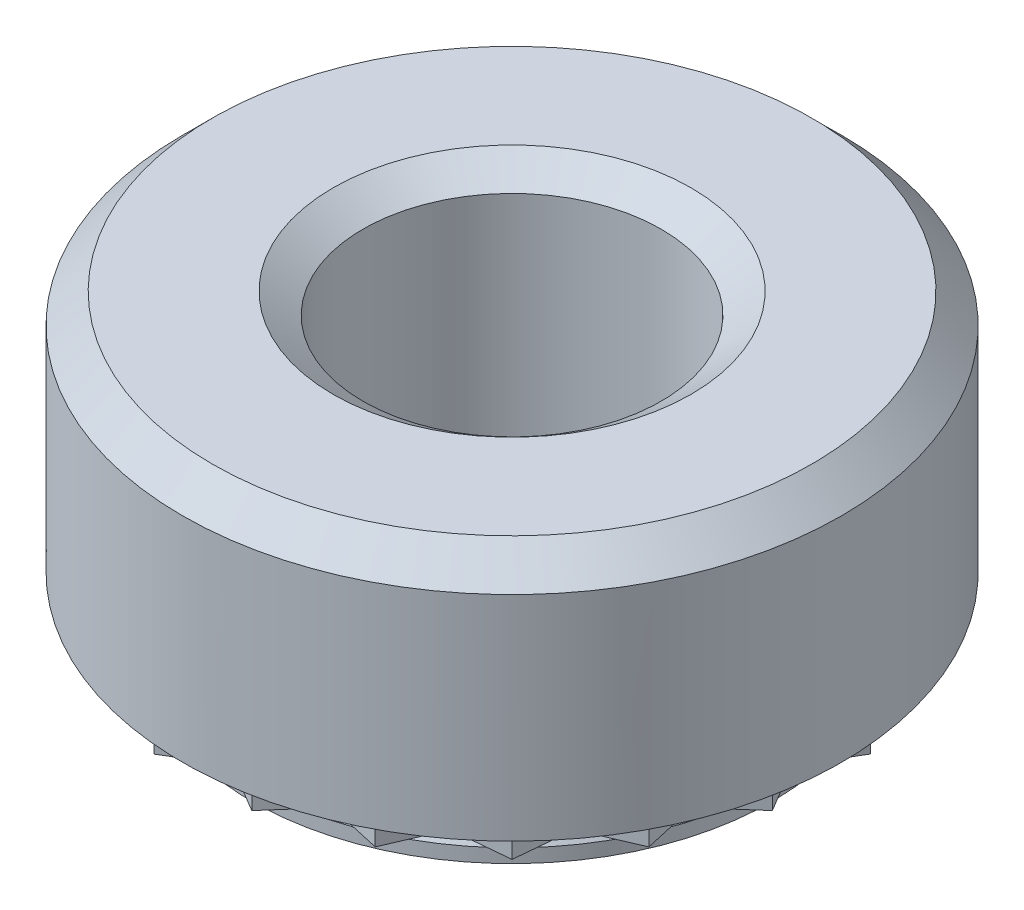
ISO-10303-21;
HEADER;
FILE_DESCRIPTION(('STEP AP214'),'2;1');
FILE_NAME('part.step','',(''),(''),'','','');
FILE_SCHEMA(('AUTOMOTIVE_DESIGN { 1 0 10303 214 1 1 1 1 }'));
ENDSEC;
DATA;
#1=APPLICATION_CONTEXT('core data for automotive mechanical design processes');
#2=APPLICATION_PROTOCOL_DEFINITION('international standard','automotive_design',2000,#1);
#3=PRODUCT_CONTEXT('',#1,'mechanical');
#4=PRODUCT('Part','Part','',(#3));
#5=PRODUCT_RELATED_PRODUCT_CATEGORY('part','',(#4));
#6=PRODUCT_DEFINITION_FORMATION('','',#4);
#7=PRODUCT_DEFINITION_CONTEXT('part definition',#1,'design');
#8=PRODUCT_DEFINITION('design','',#6,#7);
#9=PRODUCT_DEFINITION_SHAPE('','',#8);
#10=(LENGTH_UNIT() NAMED_UNIT(*) SI_UNIT(.MILLI.,.METRE.));
#11=(NAMED_UNIT(*) PLANE_ANGLE_UNIT() SI_UNIT($,.RADIAN.));
#12=(NAMED_UNIT(*) SI_UNIT($,.STERADIAN.) SOLID_ANGLE_UNIT());
#13=UNCERTAINTY_MEASURE_WITH_UNIT(LENGTH_MEASURE(1.E-05),#10,'distance_accuracy_value','');
#14=(GEOMETRIC_REPRESENTATION_CONTEXT(3) GLOBAL_UNCERTAINTY_ASSIGNED_CONTEXT((#13)) GLOBAL_UNIT_ASSIGNED_CONTEXT((#10,
#11,#12)) REPRESENTATION_CONTEXT('',''));
#15=CARTESIAN_POINT('',(0.,0.,0.));
#16=DIRECTION('',(0.,0.,1.));
#17=DIRECTION('',(1.,0.,0.));
#18=AXIS2_PLACEMENT_3D('',#15,#16,#17);
#19=CARTESIAN_POINT('',(4.09441887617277,0.,0.));
#20=DIRECTION('',(0.,-1.,0.));
#21=DIRECTION('',(0.,0.,-1.));
#22=AXIS2_PLACEMENT_3D('',#19,#20,#21);
#23=PLANE('',#22);
#24=CARTESIAN_POINT('',(0.,0.,0.));
#25=DIRECTION('',(0.,-1.,0.));
#26=DIRECTION('',(0.,0.,-1.));
#27=AXIS2_PLACEMENT_3D('',#24,#25,#26);
#28=CIRCLE('',#27,5.525);
#29=CARTESIAN_POINT('',(0.,0.,-5.525));
#30=VERTEX_POINT('',#29);
#31=EDGE_CURVE('E166',#30,#30,#28,.T.);
#32=ORIENTED_EDGE('',*,*,#31,.T.);
#33=EDGE_LOOP('',(#32));
#34=FACE_BOUND('',#33,.T.);
#35=DIRECTION('',(-0.859689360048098,0.,-0.510817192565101));
#36=VECTOR('',#35,1.);
#37=CARTESIAN_POINT('',(0.821085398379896,0.,5.18412917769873));
#38=LINE('',#37,#36);
#39=CARTESIAN_POINT('',(0.821085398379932,0.,5.18412917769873));
#40=VERTEX_POINT('',#39);
#41=CARTESIAN_POINT('',(0.,0.,4.69625));
#42=VERTEX_POINT('',#41);
#43=EDGE_CURVE('E70',#40,#42,#38,.T.);
#44=ORIENTED_EDGE('',*,*,#43,.F.);
#45=DIRECTION('',(-0.659761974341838,0.,0.751474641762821));
#46=VECTOR('',#45,1.);
#47=CARTESIAN_POINT('',(1.45122105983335,0.,4.46639916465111));
#48=LINE('',#47,#46);
#49=CARTESIAN_POINT('',(1.45122105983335,0.,4.46639916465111));
#50=VERTEX_POINT('',#49);
#51=EDGE_CURVE('E1201',#50,#40,#48,.T.);
#52=ORIENTED_EDGE('',*,*,#51,.F.);
#53=DIRECTION('',(-0.975464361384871,0.,-0.220157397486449));
#54=VECTOR('',#53,1.);
#55=CARTESIAN_POINT('',(2.38288263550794,0.,4.6766704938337));
#56=LINE('',#55,#54);
#57=CARTESIAN_POINT('',(2.38288263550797,0.,4.67667049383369));
#58=VERTEX_POINT('',#57);
#59=EDGE_CURVE('E1203',#58,#50,#56,.T.);
#60=ORIENTED_EDGE('',*,*,#59,.F.);
#61=DIRECTION('',(-0.395252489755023,0.,0.918572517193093));
#62=VECTOR('',#61,1.);
#63=CARTESIAN_POINT('',(2.76038649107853,0.,3.79934605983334));
#64=LINE('',#63,#62);
#65=CARTESIAN_POINT('',(2.76038649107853,0.,3.79934605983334));
#66=VERTEX_POINT('',#65);
#67=EDGE_CURVE('E1228',#66,#58,#64,.T.);
#68=ORIENTED_EDGE('',*,*,#67,.F.);
#69=DIRECTION('',(-0.995754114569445,0.,0.0920529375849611));
#70=VECTOR('',#69,1.);
#71=CARTESIAN_POINT('',(3.71142671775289,0.,3.7114267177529));
#72=LINE('',#71,#70);
#73=CARTESIAN_POINT('',(3.71142671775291,0.,3.71142671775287));
#74=VERTEX_POINT('',#73);
#75=EDGE_CURVE('E1231',#74,#66,#72,.T.);
#76=ORIENTED_EDGE('',*,*,#75,.F.);
#77=DIRECTION('',(-0.0920529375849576,0.,0.995754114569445));
#78=VECTOR('',#77,1.);
#79=CARTESIAN_POINT('',(3.79934605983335,0.,2.76038649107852));
#80=LINE('',#79,#78);
#81=CARTESIAN_POINT('',(3.79934605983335,0.,2.76038649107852));
#82=VERTEX_POINT('',#81);
#83=EDGE_CURVE('E1262',#82,#74,#80,.T.);
#84=ORIENTED_EDGE('',*,*,#83,.F.);
#85=DIRECTION('',(-0.918572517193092,0.,0.395252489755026));
#86=VECTOR('',#85,1.);
#87=CARTESIAN_POINT('',(4.67667049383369,0.,2.38288263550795));
#88=LINE('',#87,#86);
#89=CARTESIAN_POINT('',(4.67667049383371,0.,2.38288263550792));
#90=VERTEX_POINT('',#89);
#91=EDGE_CURVE('E1265',#90,#82,#88,.T.);
#92=ORIENTED_EDGE('',*,*,#91,.F.);
#93=DIRECTION('',(0.220157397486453,0.,0.97546436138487));
#94=VECTOR('',#93,1.);
#95=CARTESIAN_POINT('',(4.46639916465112,0.,1.45122105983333));
#96=LINE('',#95,#94);
#97=CARTESIAN_POINT('',(4.46639916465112,0.,1.45122105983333));
#98=VERTEX_POINT('',#97);
#99=EDGE_CURVE('E1298',#98,#90,#96,.T.);
#100=ORIENTED_EDGE('',*,*,#99,.F.);
#101=DIRECTION('',(-0.751474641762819,0.,0.65976197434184));
#102=VECTOR('',#101,1.);
#103=CARTESIAN_POINT('',(5.18412917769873,0.,0.821085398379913));
#104=LINE('',#103,#102);
#105=CARTESIAN_POINT('',(5.18412917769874,0.,0.821085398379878));
#106=VERTEX_POINT('',#105);
#107=EDGE_CURVE('E1301',#106,#98,#104,.T.);
#108=ORIENTED_EDGE('',*,*,#107,.F.);
#109=DIRECTION('',(0.510817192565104,0.,0.859689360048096));
#110=VECTOR('',#109,1.);
#111=CARTESIAN_POINT('',(4.69625,0.,0.));
#112=LINE('',#111,#110);
#113=CARTESIAN_POINT('',(4.69625,0.,0.));
#114=VERTEX_POINT('',#113);
#115=EDGE_CURVE('E1334',#114,#106,#112,.T.);
#116=ORIENTED_EDGE('',*,*,#115,.F.);
#117=DIRECTION('',(-0.510817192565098,0.,0.8596893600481));
#118=VECTOR('',#117,1.);
#119=CARTESIAN_POINT('',(5.18412917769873,0.,-0.821085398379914));
#120=LINE('',#119,#118);
#121=CARTESIAN_POINT('',(5.18412917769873,0.,-0.82108539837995));
#122=VERTEX_POINT('',#121);
#123=EDGE_CURVE('E1337',#122,#114,#120,.T.);
#124=ORIENTED_EDGE('',*,*,#123,.F.);
#125=DIRECTION('',(0.751474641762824,0.,0.659761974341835));
#126=VECTOR('',#125,1.);
#127=CARTESIAN_POINT('',(4.46639916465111,0.,-1.45122105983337));
#128=LINE('',#127,#126);
#129=CARTESIAN_POINT('',(4.46639916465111,0.,-1.45122105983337));
#130=VERTEX_POINT('',#129);
#131=EDGE_CURVE('E1370',#130,#122,#128,.T.);
#132=ORIENTED_EDGE('',*,*,#131,.F.);
#133=DIRECTION('',(-0.220157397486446,0.,0.975464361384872));
#134=VECTOR('',#133,1.);
#135=CARTESIAN_POINT('',(4.67667049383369,0.,-2.38288263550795));
#136=LINE('',#135,#134);
#137=CARTESIAN_POINT('',(4.67667049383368,0.,-2.38288263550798));
#138=VERTEX_POINT('',#137);
#139=EDGE_CURVE('E1373',#138,#130,#136,.T.);
#140=ORIENTED_EDGE('',*,*,#139,.F.);
#141=DIRECTION('',(0.918572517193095,0.,0.39525248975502));
#142=VECTOR('',#141,1.);
#143=CARTESIAN_POINT('',(3.79934605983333,0.,-2.76038649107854));
#144=LINE('',#143,#142);
#145=CARTESIAN_POINT('',(3.79934605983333,0.,-2.76038649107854));
#146=VERTEX_POINT('',#145);
#147=EDGE_CURVE('E1406',#146,#138,#144,.T.);
#148=ORIENTED_EDGE('',*,*,#147,.F.);
#149=DIRECTION('',(0.0920529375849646,0.,0.995754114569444));
#150=VECTOR('',#149,1.);
#151=CARTESIAN_POINT('',(3.71142671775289,0.,-3.7114267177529));
#152=LINE('',#151,#150);
#153=CARTESIAN_POINT('',(3.71142671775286,0.,-3.71142671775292));
#154=VERTEX_POINT('',#153);
#155=EDGE_CURVE('E1409',#154,#146,#152,.T.);
#156=ORIENTED_EDGE('',*,*,#155,.F.);
#157=DIRECTION('',(0.995754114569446,0.,0.0920529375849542));
#158=VECTOR('',#157,1.);
#159=CARTESIAN_POINT('',(2.76038649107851,0.,-3.79934605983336));
#160=LINE('',#159,#158);
#161=CARTESIAN_POINT('',(2.76038649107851,0.,-3.79934605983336));
#162=VERTEX_POINT('',#161);
#163=EDGE_CURVE('E1442',#162,#154,#160,.T.);
#164=ORIENTED_EDGE('',*,*,#163,.F.);
#165=DIRECTION('',(0.395252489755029,0.,0.918572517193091));
#166=VECTOR('',#165,1.);
#167=CARTESIAN_POINT('',(2.38288263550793,0.,-4.6766704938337));
#168=LINE('',#167,#166);
#169=CARTESIAN_POINT('',(2.3828826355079,0.,-4.67667049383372));
#170=VERTEX_POINT('',#169);
#171=EDGE_CURVE('E1445',#170,#162,#168,.T.);
#172=ORIENTED_EDGE('',*,*,#171,.F.);
#173=DIRECTION('',(0.975464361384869,0.,-0.220157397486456));
#174=VECTOR('',#173,1.);
#175=CARTESIAN_POINT('',(1.45122105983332,0.,-4.46639916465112));
#176=LINE('',#175,#174);
#177=CARTESIAN_POINT('',(1.45122105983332,0.,-4.46639916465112));
#178=VERTEX_POINT('',#177);
#179=EDGE_CURVE('E1478',#178,#170,#176,.T.);
#180=ORIENTED_EDGE('',*,*,#179,.F.);
#181=DIRECTION('',(0.659761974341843,0.,0.751474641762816));
#182=VECTOR('',#181,1.);
#183=CARTESIAN_POINT('',(0.821085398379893,0.,-5.18412917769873));
#184=LINE('',#183,#182);
#185=CARTESIAN_POINT('',(0.82108539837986,0.,-5.18412917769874));
#186=VERTEX_POINT('',#185);
#187=EDGE_CURVE('E1481',#186,#178,#184,.T.);
#188=ORIENTED_EDGE('',*,*,#187,.F.);
#189=DIRECTION('',(0.859689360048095,0.,-0.510817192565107));
#190=VECTOR('',#189,1.);
#191=CARTESIAN_POINT('',(0.,0.,-4.69625));
#192=LINE('',#191,#190);
#193=CARTESIAN_POINT('',(0.,0.,-4.69625));
#194=VERTEX_POINT('',#193);
#195=EDGE_CURVE('E1514',#194,#186,#192,.T.);
#196=ORIENTED_EDGE('',*,*,#195,.F.);
#197=DIRECTION('',(0.859689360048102,0.,0.510817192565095));
#198=VECTOR('',#197,1.);
#199=CARTESIAN_POINT('',(-0.821085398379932,0.,-5.18412917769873));
#200=LINE('',#199,#198);
#201=CARTESIAN_POINT('',(-0.821085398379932,0.,-5.18412917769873));
#202=VERTEX_POINT('',#201);
#203=EDGE_CURVE('E1517',#202,#194,#200,.T.);
#204=ORIENTED_EDGE('',*,*,#203,.F.);
#205=DIRECTION('',(0.659761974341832,0.,-0.751474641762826));
#206=VECTOR('',#205,1.);
#207=CARTESIAN_POINT('',(-1.45122105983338,0.,-4.4663991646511));
#208=LINE('',#207,#206);
#209=CARTESIAN_POINT('',(-1.45122105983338,0.,-4.4663991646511));
#210=VERTEX_POINT('',#209);
#211=EDGE_CURVE('E1550',#210,#202,#208,.T.);
#212=ORIENTED_EDGE('',*,*,#211,.F.);
#213=DIRECTION('',(0.975464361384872,0.,0.220157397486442));
#214=VECTOR('',#213,1.);
#215=CARTESIAN_POINT('',(-2.38288263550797,0.,-4.67667049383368));
#216=LINE('',#215,#214);
#217=CARTESIAN_POINT('',(-2.38288263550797,0.,-4.67667049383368));
#218=VERTEX_POINT('',#217);
#219=EDGE_CURVE('E1553',#218,#210,#216,.T.);
#220=ORIENTED_EDGE('',*,*,#219,.F.);
#221=DIRECTION('',(0.395252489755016,0.,-0.918572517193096));
#222=VECTOR('',#221,1.);
#223=CARTESIAN_POINT('',(-2.76038649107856,0.,-3.79934605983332));
#224=LINE('',#223,#222);
#225=CARTESIAN_POINT('',(-2.76038649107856,0.,-3.79934605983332));
#226=VERTEX_POINT('',#225);
#227=EDGE_CURVE('E1586',#226,#218,#224,.T.);
#228=ORIENTED_EDGE('',*,*,#227,.F.);
#229=DIRECTION('',(0.995754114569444,0.,-0.0920529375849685));
#230=VECTOR('',#229,1.);
#231=CARTESIAN_POINT('',(-3.71142671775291,0.,-3.71142671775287));
#232=LINE('',#231,#230);
#233=CARTESIAN_POINT('',(-3.71142671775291,0.,-3.71142671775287));
#234=VERTEX_POINT('',#233);
#235=EDGE_CURVE('E1589',#234,#226,#232,.T.);
#236=ORIENTED_EDGE('',*,*,#235,.F.);
#237=DIRECTION('',(0.0920529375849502,0.,-0.995754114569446));
#238=VECTOR('',#237,1.);
#239=CARTESIAN_POINT('',(-3.79934605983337,0.,-2.76038649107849));
#240=LINE('',#239,#238);
#241=CARTESIAN_POINT('',(-3.79934605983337,0.,-2.76038649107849));
#242=VERTEX_POINT('',#241);
#243=EDGE_CURVE('E1622',#242,#234,#240,.T.);
#244=ORIENTED_EDGE('',*,*,#243,.F.);
#245=DIRECTION('',(0.918572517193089,0.,-0.395252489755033));
#246=VECTOR('',#245,1.);
#247=CARTESIAN_POINT('',(-4.67667049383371,0.,-2.38288263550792));
#248=LINE('',#247,#246);
#249=CARTESIAN_POINT('',(-4.67667049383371,0.,-2.38288263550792));
#250=VERTEX_POINT('',#249);
#251=EDGE_CURVE('E1625',#250,#242,#248,.T.);
#252=ORIENTED_EDGE('',*,*,#251,.F.);
#253=DIRECTION('',(-0.220157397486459,0.,-0.975464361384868));
#254=VECTOR('',#253,1.);
#255=CARTESIAN_POINT('',(-4.46639916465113,0.,-1.4512210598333));
#256=LINE('',#255,#254);
#257=CARTESIAN_POINT('',(-4.46639916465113,0.,-1.4512210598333));
#258=VERTEX_POINT('',#257);
#259=EDGE_CURVE('E1658',#258,#250,#256,.T.);
#260=ORIENTED_EDGE('',*,*,#259,.F.);
#261=DIRECTION('',(0.751474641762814,0.,-0.659761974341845));
#262=VECTOR('',#261,1.);
#263=CARTESIAN_POINT('',(-5.18412917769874,0.,-0.821085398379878));
#264=LINE('',#263,#262);
#265=CARTESIAN_POINT('',(-5.18412917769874,0.,-0.821085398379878));
#266=VERTEX_POINT('',#265);
#267=EDGE_CURVE('E1661',#266,#258,#264,.T.);
#268=ORIENTED_EDGE('',*,*,#267,.F.);
#269=DIRECTION('',(-0.51081719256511,0.,-0.859689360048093));
#270=VECTOR('',#269,1.);
#271=CARTESIAN_POINT('',(-4.69625,0.,0.));
#272=LINE('',#271,#270);
#273=CARTESIAN_POINT('',(-4.69625,0.,0.));
#274=VERTEX_POINT('',#273);
#275=EDGE_CURVE('E1694',#274,#266,#272,.T.);
#276=ORIENTED_EDGE('',*,*,#275,.F.);
#277=DIRECTION('',(0.510817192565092,0.,-0.859689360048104));
#278=VECTOR('',#277,1.);
#279=CARTESIAN_POINT('',(-5.18412917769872,0.,0.821085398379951));
#280=LINE('',#279,#278);
#281=CARTESIAN_POINT('',(-5.18412917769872,0.,0.821085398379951));
#282=VERTEX_POINT('',#281);
#283=EDGE_CURVE('E1697',#282,#274,#280,.T.);
#284=ORIENTED_EDGE('',*,*,#283,.F.);
#285=DIRECTION('',(-0.751474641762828,0.,-0.65976197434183));
#286=VECTOR('',#285,1.);
#287=CARTESIAN_POINT('',(-4.4663991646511,0.,1.4512210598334));
#288=LINE('',#287,#286);
#289=CARTESIAN_POINT('',(-4.4663991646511,0.,1.4512210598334));
#290=VERTEX_POINT('',#289);
#291=EDGE_CURVE('E1730',#290,#282,#288,.T.);
#292=ORIENTED_EDGE('',*,*,#291,.F.);
#293=DIRECTION('',(0.220157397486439,0.,-0.975464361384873));
#294=VECTOR('',#293,1.);
#295=CARTESIAN_POINT('',(-4.67667049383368,0.,2.38288263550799));
#296=LINE('',#295,#294);
#297=CARTESIAN_POINT('',(-4.67667049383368,0.,2.38288263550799));
#298=VERTEX_POINT('',#297);
#299=EDGE_CURVE('E1733',#298,#290,#296,.T.);
#300=ORIENTED_EDGE('',*,*,#299,.F.);
#301=DIRECTION('',(-0.918572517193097,0.,-0.395252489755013));
#302=VECTOR('',#301,1.);
#303=CARTESIAN_POINT('',(-3.79934605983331,0.,2.76038649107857));
#304=LINE('',#303,#302);
#305=CARTESIAN_POINT('',(-3.79934605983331,0.,2.76038649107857));
#306=VERTEX_POINT('',#305);
#307=EDGE_CURVE('E1766',#306,#298,#304,.T.);
#308=ORIENTED_EDGE('',*,*,#307,.F.);
#309=DIRECTION('',(-0.0920529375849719,0.,-0.995754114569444));
#310=VECTOR('',#309,1.);
#311=CARTESIAN_POINT('',(-3.71142671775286,0.,3.71142671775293));
#312=LINE('',#311,#310);
#313=CARTESIAN_POINT('',(-3.71142671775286,0.,3.71142671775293));
#314=VERTEX_POINT('',#313);
#315=EDGE_CURVE('E1769',#314,#306,#312,.T.);
#316=ORIENTED_EDGE('',*,*,#315,.F.);
#317=DIRECTION('',(-0.995754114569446,0.,-0.0920529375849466));
#318=VECTOR('',#317,1.);
#319=CARTESIAN_POINT('',(-2.76038649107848,0.,3.79934605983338));
#320=LINE('',#319,#318);
#321=CARTESIAN_POINT('',(-2.76038649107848,0.,3.79934605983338));
#322=VERTEX_POINT('',#321);
#323=EDGE_CURVE('E1802',#322,#314,#320,.T.);
#324=ORIENTED_EDGE('',*,*,#323,.F.);
#325=DIRECTION('',(-0.395252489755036,0.,-0.918572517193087));
#326=VECTOR('',#325,1.);
#327=CARTESIAN_POINT('',(-2.3828826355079,0.,4.67667049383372));
#328=LINE('',#327,#326);
#329=CARTESIAN_POINT('',(-2.3828826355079,0.,4.67667049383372));
#330=VERTEX_POINT('',#329);
#331=EDGE_CURVE('E1805',#330,#322,#328,.T.);
#332=ORIENTED_EDGE('',*,*,#331,.F.);
#333=DIRECTION('',(-0.975464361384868,0.,0.220157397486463));
#334=VECTOR('',#333,1.);
#335=CARTESIAN_POINT('',(-1.45122105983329,0.,4.46639916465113));
#336=LINE('',#335,#334);
#337=CARTESIAN_POINT('',(-1.45122105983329,0.,4.46639916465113));
#338=VERTEX_POINT('',#337);
#339=EDGE_CURVE('E1825',#338,#330,#336,.T.);
#340=ORIENTED_EDGE('',*,*,#339,.F.);
#341=DIRECTION('',(-0.659761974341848,0.,-0.751474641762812));
#342=VECTOR('',#341,1.);
#343=CARTESIAN_POINT('',(-0.82108539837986,0.,5.18412917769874));
#344=LINE('',#343,#342);
#345=CARTESIAN_POINT('',(-0.82108539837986,0.,5.18412917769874));
#346=VERTEX_POINT('',#345);
#347=EDGE_CURVE('E1828',#346,#338,#344,.T.);
#348=ORIENTED_EDGE('',*,*,#347,.F.);
#349=DIRECTION('',(-0.859689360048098,0.,0.510817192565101));
#350=VECTOR('',#349,1.);
#351=CARTESIAN_POINT('',(0.,0.,4.69625));
#352=LINE('',#351,#350);
#353=EDGE_CURVE('E1179',#42,#346,#352,.T.);
#354=ORIENTED_EDGE('',*,*,#353,.F.);
#355=EDGE_LOOP('',(#44,#52,#60,#68,#76,#84,#92,#100,#108,#116,#124,#132,#140,#148,#156,#164,
#172,#180,#188,#196,#204,#212,#220,#228,#236,#244,#252,#260,#268,#276,#284,#292,#300,#308,#316,
#324,#332,#340,#348,#354));
#356=FACE_BOUND('',#355,.T.);
#357=ADVANCED_FACE('F33',(#34,#356),#23,.T.);
#358=CARTESIAN_POINT('',(0.,0.,0.));
#359=DIRECTION('',(0.,-1.,0.));
#360=DIRECTION('',(0.,0.,-1.));
#361=AXIS2_PLACEMENT_3D('',#358,#359,#360);
#362=CIRCLE('',#361,4.09441887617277);
#363=CARTESIAN_POINT('',(0.,0.,-4.09441887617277));
#364=VERTEX_POINT('',#363);
#365=EDGE_CURVE('E169',#364,#364,#362,.T.);
#366=ORIENTED_EDGE('',*,*,#365,.F.);
#367=EDGE_LOOP('',(#366));
#368=FACE_BOUND('',#367,.T.);
#369=DIRECTION('',(0.975464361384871,0.,0.220157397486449));
#370=VECTOR('',#369,1.);
#371=CARTESIAN_POINT('',(1.39317221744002,0.,4.28774319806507));
#372=LINE('',#371,#370);
#373=CARTESIAN_POINT('',(1.39317221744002,0.,4.28774319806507));
#374=VERTEX_POINT('',#373);
#375=CARTESIAN_POINT('',(2.28756733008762,0.,4.48960367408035));
#376=VERTEX_POINT('',#375);
#377=EDGE_CURVE('E104',#374,#376,#372,.T.);
#378=ORIENTED_EDGE('',*,*,#377,.F.);
#379=DIRECTION('',(0.659761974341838,0.,-0.751474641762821));
#380=VECTOR('',#379,1.);
#381=CARTESIAN_POINT('',(0.788241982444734,0.,4.97676401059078));
#382=LINE('',#381,#380);
#383=CARTESIAN_POINT('',(0.788241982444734,0.,4.97676401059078));
#384=VERTEX_POINT('',#383);
#385=EDGE_CURVE('E1199',#384,#374,#382,.T.);
#386=ORIENTED_EDGE('',*,*,#385,.F.);
#387=DIRECTION('',(0.859689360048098,0.,0.510817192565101));
#388=VECTOR('',#387,1.);
#389=CARTESIAN_POINT('',(0.,0.,4.5084));
#390=LINE('',#389,#388);
#391=CARTESIAN_POINT('',(0.,0.,4.5084));
#392=VERTEX_POINT('',#391);
#393=EDGE_CURVE('E138',#392,#384,#390,.T.);
#394=ORIENTED_EDGE('',*,*,#393,.F.);
#395=DIRECTION('',(0.859689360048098,0.,-0.510817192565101));
#396=VECTOR('',#395,1.);
#397=CARTESIAN_POINT('',(-0.7882419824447,0.,4.97676401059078));
#398=LINE('',#397,#396);
#399=CARTESIAN_POINT('',(-0.788241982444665,0.,4.97676401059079));
#400=VERTEX_POINT('',#399);
#401=EDGE_CURVE('E1178',#400,#392,#398,.T.);
#402=ORIENTED_EDGE('',*,*,#401,.F.);
#403=DIRECTION('',(0.659761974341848,0.,0.751474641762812));
#404=VECTOR('',#403,1.);
#405=CARTESIAN_POINT('',(-1.39317221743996,0.,4.28774319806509));
#406=LINE('',#405,#404);
#407=CARTESIAN_POINT('',(-1.39317221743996,0.,4.28774319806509));
#408=VERTEX_POINT('',#407);
#409=EDGE_CURVE('E1165',#408,#400,#406,.T.);
#410=ORIENTED_EDGE('',*,*,#409,.F.);
#411=DIRECTION('',(0.975464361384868,0.,-0.220157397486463));
#412=VECTOR('',#411,1.);
#413=CARTESIAN_POINT('',(-2.28756733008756,0.,4.48960367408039));
#414=LINE('',#413,#412);
#415=CARTESIAN_POINT('',(-2.28756733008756,0.,4.48960367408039));
#416=VERTEX_POINT('',#415);
#417=EDGE_CURVE('E1176',#416,#408,#414,.T.);
#418=ORIENTED_EDGE('',*,*,#417,.F.);
#419=DIRECTION('',(0.395252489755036,0.,0.918572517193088));
#420=VECTOR('',#419,1.);
#421=CARTESIAN_POINT('',(-2.64997103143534,0.,3.64737221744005));
#422=LINE('',#421,#420);
#423=CARTESIAN_POINT('',(-2.64997103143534,0.,3.64737221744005));
#424=VERTEX_POINT('',#423);
#425=EDGE_CURVE('E1795',#424,#416,#422,.T.);
#426=ORIENTED_EDGE('',*,*,#425,.F.);
#427=DIRECTION('',(0.995754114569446,0.,0.0920529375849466));
#428=VECTOR('',#427,1.);
#429=CARTESIAN_POINT('',(-3.56296964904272,0.,3.56296964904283));
#430=LINE('',#429,#428);
#431=CARTESIAN_POINT('',(-3.56296964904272,0.,3.56296964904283));
#432=VERTEX_POINT('',#431);
#433=EDGE_CURVE('E1799',#432,#424,#430,.T.);
#434=ORIENTED_EDGE('',*,*,#433,.F.);
#435=DIRECTION('',(0.0920529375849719,0.,0.995754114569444));
#436=VECTOR('',#435,1.);
#437=CARTESIAN_POINT('',(-3.64737221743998,0.,2.64997103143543));
#438=LINE('',#437,#436);
#439=CARTESIAN_POINT('',(-3.64737221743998,0.,2.64997103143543));
#440=VERTEX_POINT('',#439);
#441=EDGE_CURVE('E1759',#440,#432,#438,.T.);
#442=ORIENTED_EDGE('',*,*,#441,.F.);
#443=DIRECTION('',(0.918572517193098,0.,0.395252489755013));
#444=VECTOR('',#443,1.);
#445=CARTESIAN_POINT('',(-4.48960367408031,0.,2.2875673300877));
#446=LINE('',#445,#444);
#447=CARTESIAN_POINT('',(-4.48960367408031,0.,2.2875673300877));
#448=VERTEX_POINT('',#447);
#449=EDGE_CURVE('E1763',#448,#440,#446,.T.);
#450=ORIENTED_EDGE('',*,*,#449,.F.);
#451=DIRECTION('',(-0.220157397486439,0.,0.975464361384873));
#452=VECTOR('',#451,1.);
#453=CARTESIAN_POINT('',(-4.28774319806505,0.,1.39317221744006));
#454=LINE('',#453,#452);
#455=CARTESIAN_POINT('',(-4.28774319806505,0.,1.39317221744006));
#456=VERTEX_POINT('',#455);
#457=EDGE_CURVE('E1723',#456,#448,#454,.T.);
#458=ORIENTED_EDGE('',*,*,#457,.F.);
#459=DIRECTION('',(0.751474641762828,0.,0.65976197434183));
#460=VECTOR('',#459,1.);
#461=CARTESIAN_POINT('',(-4.97676401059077,0.,0.788241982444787));
#462=LINE('',#461,#460);
#463=CARTESIAN_POINT('',(-4.97676401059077,0.,0.788241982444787));
#464=VERTEX_POINT('',#463);
#465=EDGE_CURVE('E1727',#464,#456,#462,.T.);
#466=ORIENTED_EDGE('',*,*,#465,.F.);
#467=DIRECTION('',(-0.510817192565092,0.,0.859689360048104));
#468=VECTOR('',#467,1.);
#469=CARTESIAN_POINT('',(-4.5084,0.,0.));
#470=LINE('',#469,#468);
#471=CARTESIAN_POINT('',(-4.5084,0.,0.));
#472=VERTEX_POINT('',#471);
#473=EDGE_CURVE('E1687',#472,#464,#470,.T.);
#474=ORIENTED_EDGE('',*,*,#473,.F.);
#475=DIRECTION('',(0.51081719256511,0.,0.859689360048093));
#476=VECTOR('',#475,1.);
#477=CARTESIAN_POINT('',(-4.97676401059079,0.,-0.788241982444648));
#478=LINE('',#477,#476);
#479=CARTESIAN_POINT('',(-4.97676401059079,0.,-0.788241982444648));
#480=VERTEX_POINT('',#479);
#481=EDGE_CURVE('E1691',#480,#472,#478,.T.);
#482=ORIENTED_EDGE('',*,*,#481,.F.);
#483=DIRECTION('',(-0.751474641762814,0.,0.659761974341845));
#484=VECTOR('',#483,1.);
#485=CARTESIAN_POINT('',(-4.28774319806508,0.,-1.39317221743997));
#486=LINE('',#485,#484);
#487=CARTESIAN_POINT('',(-4.28774319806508,0.,-1.39317221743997));
#488=VERTEX_POINT('',#487);
#489=EDGE_CURVE('E1651',#488,#480,#486,.T.);
#490=ORIENTED_EDGE('',*,*,#489,.F.);
#491=DIRECTION('',(0.220157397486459,0.,0.975464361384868));
#492=VECTOR('',#491,1.);
#493=CARTESIAN_POINT('',(-4.48960367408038,0.,-2.28756733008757));
#494=LINE('',#493,#492);
#495=CARTESIAN_POINT('',(-4.48960367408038,0.,-2.28756733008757));
#496=VERTEX_POINT('',#495);
#497=EDGE_CURVE('E1655',#496,#488,#494,.T.);
#498=ORIENTED_EDGE('',*,*,#497,.F.);
#499=DIRECTION('',(-0.918572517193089,0.,0.395252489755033));
#500=VECTOR('',#499,1.);
#501=CARTESIAN_POINT('',(-3.64737221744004,0.,-2.64997103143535));
#502=LINE('',#501,#500);
#503=CARTESIAN_POINT('',(-3.64737221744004,0.,-2.64997103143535));
#504=VERTEX_POINT('',#503);
#505=EDGE_CURVE('E1615',#504,#496,#502,.T.);
#506=ORIENTED_EDGE('',*,*,#505,.F.);
#507=DIRECTION('',(-0.0920529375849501,0.,0.995754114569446));
#508=VECTOR('',#507,1.);
#509=CARTESIAN_POINT('',(-3.56296964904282,0.,-3.56296964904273));
#510=LINE('',#509,#508);
#511=CARTESIAN_POINT('',(-3.56296964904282,0.,-3.56296964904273));
#512=VERTEX_POINT('',#511);
#513=EDGE_CURVE('E1619',#512,#504,#510,.T.);
#514=ORIENTED_EDGE('',*,*,#513,.F.);
#515=DIRECTION('',(-0.995754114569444,0.,0.0920529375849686));
#516=VECTOR('',#515,1.);
#517=CARTESIAN_POINT('',(-2.64997103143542,0.,-3.64737221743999));
#518=LINE('',#517,#516);
#519=CARTESIAN_POINT('',(-2.64997103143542,0.,-3.64737221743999));
#520=VERTEX_POINT('',#519);
#521=EDGE_CURVE('E1579',#520,#512,#518,.T.);
#522=ORIENTED_EDGE('',*,*,#521,.F.);
#523=DIRECTION('',(-0.395252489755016,0.,0.918572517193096));
#524=VECTOR('',#523,1.);
#525=CARTESIAN_POINT('',(-2.28756733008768,0.,-4.48960367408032));
#526=LINE('',#525,#524);
#527=CARTESIAN_POINT('',(-2.28756733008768,0.,-4.48960367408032));
#528=VERTEX_POINT('',#527);
#529=EDGE_CURVE('E1583',#528,#520,#526,.T.);
#530=ORIENTED_EDGE('',*,*,#529,.F.);
#531=DIRECTION('',(-0.975464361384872,0.,-0.220157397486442));
#532=VECTOR('',#531,1.);
#533=CARTESIAN_POINT('',(-1.39317221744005,0.,-4.28774319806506));
#534=LINE('',#533,#532);
#535=CARTESIAN_POINT('',(-1.39317221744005,0.,-4.28774319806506));
#536=VERTEX_POINT('',#535);
#537=EDGE_CURVE('E1543',#536,#528,#534,.T.);
#538=ORIENTED_EDGE('',*,*,#537,.F.);
#539=DIRECTION('',(-0.659761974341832,0.,0.751474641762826));
#540=VECTOR('',#539,1.);
#541=CARTESIAN_POINT('',(-0.78824198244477,0.,-4.97676401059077));
#542=LINE('',#541,#540);
#543=CARTESIAN_POINT('',(-0.78824198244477,0.,-4.97676401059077));
#544=VERTEX_POINT('',#543);
#545=EDGE_CURVE('E1547',#544,#536,#542,.T.);
#546=ORIENTED_EDGE('',*,*,#545,.F.);
#547=DIRECTION('',(-0.859689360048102,0.,-0.510817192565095));
#548=VECTOR('',#547,1.);
#549=CARTESIAN_POINT('',(0.,0.,-4.5084));
#550=LINE('',#549,#548);
#551=CARTESIAN_POINT('',(0.,0.,-4.5084));
#552=VERTEX_POINT('',#551);
#553=EDGE_CURVE('E1507',#552,#544,#550,.T.);
#554=ORIENTED_EDGE('',*,*,#553,.F.);
#555=DIRECTION('',(-0.859689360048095,0.,0.510817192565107));
#556=VECTOR('',#555,1.);
#557=CARTESIAN_POINT('',(0.788241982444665,0.,-4.97676401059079));
#558=LINE('',#557,#556);
#559=CARTESIAN_POINT('',(0.788241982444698,0.,-4.97676401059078));
#560=VERTEX_POINT('',#559);
#561=EDGE_CURVE('E1511',#560,#552,#558,.T.);
#562=ORIENTED_EDGE('',*,*,#561,.F.);
#563=DIRECTION('',(-0.659761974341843,0.,-0.751474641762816));
#564=VECTOR('',#563,1.);
#565=CARTESIAN_POINT('',(1.39317221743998,0.,-4.28774319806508));
#566=LINE('',#565,#564);
#567=CARTESIAN_POINT('',(1.39317221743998,0.,-4.28774319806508));
#568=VERTEX_POINT('',#567);
#569=EDGE_CURVE('E1471',#568,#560,#566,.T.);
#570=ORIENTED_EDGE('',*,*,#569,.F.);
#571=DIRECTION('',(-0.975464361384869,0.,0.220157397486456));
#572=VECTOR('',#571,1.);
#573=CARTESIAN_POINT('',(2.28756733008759,0.,-4.48960367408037));
#574=LINE('',#573,#572);
#575=CARTESIAN_POINT('',(2.28756733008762,0.,-4.48960367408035));
#576=VERTEX_POINT('',#575);
#577=EDGE_CURVE('E1475',#576,#568,#574,.T.);
#578=ORIENTED_EDGE('',*,*,#577,.F.);
#579=DIRECTION('',(-0.395252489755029,0.,-0.918572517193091));
#580=VECTOR('',#579,1.);
#581=CARTESIAN_POINT('',(2.64997103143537,0.,-3.64737221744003));
#582=LINE('',#581,#580);
#583=CARTESIAN_POINT('',(2.64997103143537,0.,-3.64737221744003));
#584=VERTEX_POINT('',#583);
#585=EDGE_CURVE('E1435',#584,#576,#582,.T.);
#586=ORIENTED_EDGE('',*,*,#585,.F.);
#587=DIRECTION('',(-0.995754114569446,0.,-0.0920529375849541));
#588=VECTOR('',#587,1.);
#589=CARTESIAN_POINT('',(3.56296964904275,0.,-3.56296964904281));
#590=LINE('',#589,#588);
#591=CARTESIAN_POINT('',(3.56296964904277,0.,-3.56296964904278));
#592=VERTEX_POINT('',#591);
#593=EDGE_CURVE('E1439',#592,#584,#590,.T.);
#594=ORIENTED_EDGE('',*,*,#593,.F.);
#595=DIRECTION('',(-0.0920529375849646,0.,-0.995754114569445));
#596=VECTOR('',#595,1.);
#597=CARTESIAN_POINT('',(3.64737221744,0.,-2.6499710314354));
#598=LINE('',#597,#596);
#599=CARTESIAN_POINT('',(3.64737221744,0.,-2.6499710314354));
#600=VERTEX_POINT('',#599);
#601=EDGE_CURVE('E1399',#600,#592,#598,.T.);
#602=ORIENTED_EDGE('',*,*,#601,.F.);
#603=DIRECTION('',(-0.918572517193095,0.,-0.39525248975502));
#604=VECTOR('',#603,1.);
#605=CARTESIAN_POINT('',(4.48960367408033,0.,-2.28756733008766));
#606=LINE('',#605,#604);
#607=CARTESIAN_POINT('',(4.48960367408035,0.,-2.28756733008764));
#608=VERTEX_POINT('',#607);
#609=EDGE_CURVE('E1403',#608,#600,#606,.T.);
#610=ORIENTED_EDGE('',*,*,#609,.F.);
#611=DIRECTION('',(0.220157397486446,0.,-0.975464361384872));
#612=VECTOR('',#611,1.);
#613=CARTESIAN_POINT('',(4.28774319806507,0.,-1.39317221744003));
#614=LINE('',#613,#612);
#615=CARTESIAN_POINT('',(4.28774319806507,0.,-1.39317221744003));
#616=VERTEX_POINT('',#615);
#617=EDGE_CURVE('E1363',#616,#608,#614,.T.);
#618=ORIENTED_EDGE('',*,*,#617,.F.);
#619=DIRECTION('',(-0.751474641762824,0.,-0.659761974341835));
#620=VECTOR('',#619,1.);
#621=CARTESIAN_POINT('',(4.97676401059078,0.,-0.788241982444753));
#622=LINE('',#621,#620);
#623=CARTESIAN_POINT('',(4.97676401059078,0.,-0.788241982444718));
#624=VERTEX_POINT('',#623);
#625=EDGE_CURVE('E1367',#624,#616,#622,.T.);
#626=ORIENTED_EDGE('',*,*,#625,.F.);
#627=DIRECTION('',(0.510817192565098,0.,-0.8596893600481));
#628=VECTOR('',#627,1.);
#629=CARTESIAN_POINT('',(4.5084,0.,0.));
#630=LINE('',#629,#628);
#631=CARTESIAN_POINT('',(4.5084,0.,0.));
#632=VERTEX_POINT('',#631);
#633=EDGE_CURVE('E1327',#632,#624,#630,.T.);
#634=ORIENTED_EDGE('',*,*,#633,.F.);
#635=DIRECTION('',(-0.510817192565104,0.,-0.859689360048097));
#636=VECTOR('',#635,1.);
#637=CARTESIAN_POINT('',(4.97676401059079,0.,0.788241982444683));
#638=LINE('',#637,#636);
#639=CARTESIAN_POINT('',(4.97676401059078,0.,0.788241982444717));
#640=VERTEX_POINT('',#639);
#641=EDGE_CURVE('E1331',#640,#632,#638,.T.);
#642=ORIENTED_EDGE('',*,*,#641,.F.);
#643=DIRECTION('',(0.751474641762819,0.,-0.659761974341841));
#644=VECTOR('',#643,1.);
#645=CARTESIAN_POINT('',(4.28774319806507,0.,1.39317221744));
#646=LINE('',#645,#644);
#647=CARTESIAN_POINT('',(4.28774319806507,0.,1.39317221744));
#648=VERTEX_POINT('',#647);
#649=EDGE_CURVE('E1291',#648,#640,#646,.T.);
#650=ORIENTED_EDGE('',*,*,#649,.F.);
#651=DIRECTION('',(-0.220157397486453,0.,-0.97546436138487));
#652=VECTOR('',#651,1.);
#653=CARTESIAN_POINT('',(4.48960367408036,0.,2.2875673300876));
#654=LINE('',#653,#652);
#655=CARTESIAN_POINT('',(4.48960367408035,0.,2.28756733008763));
#656=VERTEX_POINT('',#655);
#657=EDGE_CURVE('E1295',#656,#648,#654,.T.);
#658=ORIENTED_EDGE('',*,*,#657,.F.);
#659=DIRECTION('',(0.918572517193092,0.,-0.395252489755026));
#660=VECTOR('',#659,1.);
#661=CARTESIAN_POINT('',(3.64737221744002,0.,2.64997103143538));
#662=LINE('',#661,#660);
#663=CARTESIAN_POINT('',(3.64737221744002,0.,2.64997103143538));
#664=VERTEX_POINT('',#663);
#665=EDGE_CURVE('E1255',#664,#656,#662,.T.);
#666=ORIENTED_EDGE('',*,*,#665,.F.);
#667=DIRECTION('',(0.0920529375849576,0.,-0.995754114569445));
#668=VECTOR('',#667,1.);
#669=CARTESIAN_POINT('',(3.56296964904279,0.,3.56296964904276));
#670=LINE('',#669,#668);
#671=CARTESIAN_POINT('',(3.56296964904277,0.,3.56296964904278));
#672=VERTEX_POINT('',#671);
#673=EDGE_CURVE('E1259',#672,#664,#670,.T.);
#674=ORIENTED_EDGE('',*,*,#673,.F.);
#675=DIRECTION('',(0.995754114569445,0.,-0.0920529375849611));
#676=VECTOR('',#675,1.);
#677=CARTESIAN_POINT('',(2.64997103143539,0.,3.64737221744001));
#678=LINE('',#677,#676);
#679=CARTESIAN_POINT('',(2.64997103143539,0.,3.64737221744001));
#680=VERTEX_POINT('',#679);
#681=EDGE_CURVE('E1221',#680,#672,#678,.T.);
#682=ORIENTED_EDGE('',*,*,#681,.F.);
#683=DIRECTION('',(0.395252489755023,0.,-0.918572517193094));
#684=VECTOR('',#683,1.);
#685=CARTESIAN_POINT('',(2.28756733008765,0.,4.48960367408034));
#686=LINE('',#685,#684);
#687=EDGE_CURVE('E1225',#376,#680,#686,.T.);
#688=ORIENTED_EDGE('',*,*,#687,.F.);
#689=EDGE_LOOP('',(#378,#386,#394,#402,#410,#418,#426,#434,#442,#450,#458,#466,#474,#482,#490,
#498,#506,#514,#522,#530,#538,#546,#554,#562,#570,#578,#586,#594,#602,#610,#618,#626,#634,#642,
#650,#658,#666,#674,#682,#688));
#690=FACE_BOUND('',#689,.T.);
#691=ADVANCED_FACE('F203',(#368,#690),#23,.T.);
#692=CARTESIAN_POINT('',(0.,0.,0.));
#693=DIRECTION('',(0.,-1.,0.));
#694=DIRECTION('',(0.,0.,-1.));
#695=AXIS2_PLACEMENT_3D('',#692,#693,#694);
#696=CYLINDRICAL_SURFACE('',#695,5.525);
#697=CARTESIAN_POINT('',(0.,3.58,0.));
#698=DIRECTION('',(0.,1.,0.));
#699=DIRECTION('',(0.,0.,1.));
#700=AXIS2_PLACEMENT_3D('',#697,#698,#699);
#701=CIRCLE('',#700,5.525);
#702=CARTESIAN_POINT('',(0.,3.58,5.525));
#703=VERTEX_POINT('',#702);
#704=EDGE_CURVE('E42',#703,#703,#701,.F.);
#705=ORIENTED_EDGE('',*,*,#704,.T.);
#706=EDGE_LOOP('',(#705));
#707=FACE_BOUND('',#706,.T.);
#708=ORIENTED_EDGE('',*,*,#31,.F.);
#709=EDGE_LOOP('',(#708));
#710=FACE_BOUND('',#709,.T.);
#711=ADVANCED_FACE('F184',(#707,#710),#696,.T.);
#712=CARTESIAN_POINT('',(5.525,4.08,0.));
#713=DIRECTION('',(0.,1.,0.));
#714=DIRECTION('',(0.,0.,1.));
#715=AXIS2_PLACEMENT_3D('',#712,#713,#714);
#716=PLANE('',#715);
#717=CARTESIAN_POINT('',(0.,4.08,0.));
#718=DIRECTION('',(0.,-1.,0.));
#719=DIRECTION('',(0.,0.,-1.));
#720=AXIS2_PLACEMENT_3D('',#717,#718,#719);
#721=CIRCLE('',#720,3.);
#722=CARTESIAN_POINT('',(0.,4.08,-3.));
#723=VERTEX_POINT('',#722);
#724=EDGE_CURVE('E157',#723,#723,#721,.T.);
#725=ORIENTED_EDGE('',*,*,#724,.T.);
#726=EDGE_LOOP('',(#725));
#727=FACE_BOUND('',#726,.T.);
#728=CARTESIAN_POINT('',(0.,4.08,0.));
#729=DIRECTION('',(0.,1.,0.));
#730=DIRECTION('',(0.,0.,1.));
#731=AXIS2_PLACEMENT_3D('',#728,#729,#730);
#732=CIRCLE('',#731,5.025);
#733=CARTESIAN_POINT('',(0.,4.08,5.025));
#734=VERTEX_POINT('',#733);
#735=EDGE_CURVE('E11',#734,#734,#732,.T.);
#736=ORIENTED_EDGE('',*,*,#735,.T.);
#737=EDGE_LOOP('',(#736));
#738=FACE_BOUND('',#737,.T.);
#739=ADVANCED_FACE('F227',(#727,#738),#716,.T.);
#740=CARTESIAN_POINT('',(0.,0.,0.));
#741=DIRECTION('',(0.,-1.,0.));
#742=DIRECTION('',(0.,0.,-1.));
#743=AXIS2_PLACEMENT_3D('',#740,#741,#742);
#744=CYLINDRICAL_SURFACE('',#743,2.5);
#745=CARTESIAN_POINT('',(0.,3.73002626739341,0.));
#746=DIRECTION('',(0.,-1.,0.));
#747=DIRECTION('',(0.,0.,-1.));
#748=AXIS2_PLACEMENT_3D('',#745,#746,#747);
#749=CIRCLE('',#748,2.5);
#750=CARTESIAN_POINT('',(0.,3.73002626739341,-2.5));
#751=VERTEX_POINT('',#750);
#752=EDGE_CURVE('E154',#751,#751,#749,.T.);
#753=ORIENTED_EDGE('',*,*,#752,.F.);
#754=EDGE_LOOP('',(#753));
#755=FACE_BOUND('',#754,.T.);
#756=CARTESIAN_POINT('',(0.,-0.797486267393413,0.));
#757=DIRECTION('',(0.,-1.,0.));
#758=DIRECTION('',(0.,0.,-1.));
#759=AXIS2_PLACEMENT_3D('',#756,#757,#758);
#760=CIRCLE('',#759,2.5);
#761=CARTESIAN_POINT('',(0.,-0.797486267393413,-2.5));
#762=VERTEX_POINT('',#761);
#763=EDGE_CURVE('E163',#762,#762,#760,.T.);
#764=ORIENTED_EDGE('',*,*,#763,.T.);
#765=EDGE_LOOP('',(#764));
#766=FACE_BOUND('',#765,.T.);
#767=ADVANCED_FACE('F223',(#755,#766),#744,.F.);
#768=CARTESIAN_POINT('',(2.5,-1.15,0.));
#769=DIRECTION('',(0.,-1.,0.));
#770=DIRECTION('',(0.,0.,-1.));
#771=AXIS2_PLACEMENT_3D('',#768,#769,#770);
#772=PLANE('',#771);
#773=CARTESIAN_POINT('',(0.,-1.15,0.));
#774=DIRECTION('',(0.,-1.,0.));
#775=DIRECTION('',(0.,0.,-1.));
#776=AXIS2_PLACEMENT_3D('',#773,#774,#775);
#777=CIRCLE('',#776,3.);
#778=CARTESIAN_POINT('',(0.,-1.15,-3.));
#779=VERTEX_POINT('',#778);
#780=EDGE_CURVE('E37',#779,#779,#777,.T.);
#781=ORIENTED_EDGE('',*,*,#780,.F.);
#782=EDGE_LOOP('',(#781));
#783=FACE_BOUND('',#782,.T.);
#784=CARTESIAN_POINT('',(0.,-1.15,0.));
#785=DIRECTION('',(0.,-1.,0.));
#786=DIRECTION('',(0.,0.,-1.));
#787=AXIS2_PLACEMENT_3D('',#784,#785,#786);
#788=CIRCLE('',#787,4.36);
#789=CARTESIAN_POINT('',(0.,-1.15,-4.36));
#790=VERTEX_POINT('',#789);
#791=EDGE_CURVE('E178',#790,#790,#788,.T.);
#792=ORIENTED_EDGE('',*,*,#791,.T.);
#793=EDGE_LOOP('',(#792));
#794=FACE_BOUND('',#793,.T.);
#795=ADVANCED_FACE('F219',(#783,#794),#772,.T.);
#796=CARTESIAN_POINT('',(0.,0.,0.));
#797=DIRECTION('',(0.,-1.,0.));
#798=DIRECTION('',(0.,0.,-1.));
#799=AXIS2_PLACEMENT_3D('',#796,#797,#798);
#800=CYLINDRICAL_SURFACE('',#799,4.36);
#801=CARTESIAN_POINT('',(0.,-0.92,0.));
#802=DIRECTION('',(0.,-1.,0.));
#803=DIRECTION('',(0.,0.,-1.));
#804=AXIS2_PLACEMENT_3D('',#801,#802,#803);
#805=CIRCLE('',#804,4.36);
#806=CARTESIAN_POINT('',(0.,-0.92,-4.36));
#807=VERTEX_POINT('',#806);
#808=EDGE_CURVE('E175',#807,#807,#805,.T.);
#809=ORIENTED_EDGE('',*,*,#808,.T.);
#810=EDGE_LOOP('',(#809));
#811=FACE_BOUND('',#810,.T.);
#812=ORIENTED_EDGE('',*,*,#791,.F.);
#813=EDGE_LOOP('',(#812));
#814=FACE_BOUND('',#813,.T.);
#815=ADVANCED_FACE('F215',(#811,#814),#800,.T.);
#816=CARTESIAN_POINT('',(0.,-0.92,0.));
#817=DIRECTION('',(0.,-1.,0.));
#818=DIRECTION('',(0.,0.,-1.));
#819=AXIS2_PLACEMENT_3D('',#816,#817,#818);
#820=CONICAL_SURFACE('',#819,4.36,0.523598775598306);
#821=CARTESIAN_POINT('',(0.,-0.46,0.));
#822=DIRECTION('',(0.,-1.,0.));
#823=DIRECTION('',(0.,0.,-1.));
#824=AXIS2_PLACEMENT_3D('',#821,#822,#823);
#825=CIRCLE('',#824,4.09441887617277);
#826=CARTESIAN_POINT('',(0.,-0.46,-4.09441887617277));
#827=VERTEX_POINT('',#826);
#828=EDGE_CURVE('E172',#827,#827,#825,.T.);
#829=ORIENTED_EDGE('',*,*,#828,.T.);
#830=EDGE_LOOP('',(#829));
#831=FACE_BOUND('',#830,.T.);
#832=ORIENTED_EDGE('',*,*,#808,.F.);
#833=EDGE_LOOP('',(#832));
#834=FACE_BOUND('',#833,.T.);
#835=ADVANCED_FACE('F198',(#831,#834),#820,.T.);
#836=CARTESIAN_POINT('',(0.,0.,0.));
#837=DIRECTION('',(0.,-1.,0.));
#838=DIRECTION('',(0.,0.,-1.));
#839=AXIS2_PLACEMENT_3D('',#836,#837,#838);
#840=CYLINDRICAL_SURFACE('',#839,4.09441887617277);
#841=ORIENTED_EDGE('',*,*,#365,.T.);
#842=EDGE_LOOP('',(#841));
#843=FACE_BOUND('',#842,.T.);
#844=ORIENTED_EDGE('',*,*,#828,.F.);
#845=EDGE_LOOP('',(#844));
#846=FACE_BOUND('',#845,.T.);
#847=ADVANCED_FACE('F189',(#843,#846),#840,.T.);
#848=CARTESIAN_POINT('',(0.,3.58,0.));
#849=DIRECTION('',(0.,-1.,0.));
#850=DIRECTION('',(0.,0.,-1.));
#851=AXIS2_PLACEMENT_3D('',#848,#849,#850);
#852=CONICAL_SURFACE('',#851,5.525,0.78539816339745);
#853=ORIENTED_EDGE('',*,*,#735,.F.);
#854=EDGE_LOOP('',(#853));
#855=FACE_BOUND('',#854,.T.);
#856=ORIENTED_EDGE('',*,*,#704,.F.);
#857=EDGE_LOOP('',(#856));
#858=FACE_BOUND('',#857,.T.);
#859=ADVANCED_FACE('F35',(#855,#858),#852,.T.);
#860=CARTESIAN_POINT('',(0.,-1.14746,0.));
#861=DIRECTION('',(0.,-1.,0.));
#862=DIRECTION('',(0.,0.,-1.));
#863=AXIS2_PLACEMENT_3D('',#860,#861,#862);
#864=CONICAL_SURFACE('',#863,3.,0.960105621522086);
#865=ORIENTED_EDGE('',*,*,#763,.F.);
#866=EDGE_LOOP('',(#865));
#867=FACE_BOUND('',#866,.T.);
#868=CARTESIAN_POINT('',(0.,-1.14746,0.));
#869=DIRECTION('',(0.,-1.,0.));
#870=DIRECTION('',(0.,0.,-1.));
#871=AXIS2_PLACEMENT_3D('',#868,#869,#870);
#872=CIRCLE('',#871,3.);
#873=CARTESIAN_POINT('',(0.,-1.14746,-3.));
#874=VERTEX_POINT('',#873);
#875=EDGE_CURVE('E160',#874,#874,#872,.T.);
#876=ORIENTED_EDGE('',*,*,#875,.T.);
#877=EDGE_LOOP('',(#876));
#878=FACE_BOUND('',#877,.T.);
#879=ADVANCED_FACE('F188',(#867,#878),#864,.F.);
#880=CARTESIAN_POINT('',(0.,-2.54,0.));
#881=DIRECTION('',(0.,-1.,0.));
#882=DIRECTION('',(0.,0.,-1.));
#883=AXIS2_PLACEMENT_3D('',#880,#881,#882);
#884=CYLINDRICAL_SURFACE('',#883,3.);
#885=ORIENTED_EDGE('',*,*,#780,.T.);
#886=EDGE_LOOP('',(#885));
#887=FACE_BOUND('',#886,.T.);
#888=ORIENTED_EDGE('',*,*,#875,.F.);
#889=EDGE_LOOP('',(#888));
#890=FACE_BOUND('',#889,.T.);
#891=ADVANCED_FACE('F195',(#887,#890),#884,.F.);
#892=CARTESIAN_POINT('',(0.,3.73002626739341,0.));
#893=DIRECTION('',(0.,1.,0.));
#894=DIRECTION('',(0.,0.,1.));
#895=AXIS2_PLACEMENT_3D('',#892,#893,#894);
#896=CONICAL_SURFACE('',#895,2.5,0.960105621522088);
#897=ORIENTED_EDGE('',*,*,#724,.F.);
#898=EDGE_LOOP('',(#897));
#899=FACE_BOUND('',#898,.T.);
#900=ORIENTED_EDGE('',*,*,#752,.T.);
#901=EDGE_LOOP('',(#900));
#902=FACE_BOUND('',#901,.T.);
#903=ADVANCED_FACE('F281',(#899,#902),#896,.F.);
#904=CARTESIAN_POINT('',(0.821085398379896,-0.46,5.18412917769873));
#905=DIRECTION('',(0.510817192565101,0.,-0.859689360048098));
#906=DIRECTION('',(-0.859689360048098,0.,-0.510817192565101));
#907=AXIS2_PLACEMENT_3D('',#904,#905,#906);
#908=PLANE('',#907);
#909=ORIENTED_EDGE('',*,*,#43,.T.);
#910=DIRECTION('',(0.,1.,0.));
#911=VECTOR('',#910,1.);
#912=CARTESIAN_POINT('',(0.,-0.46,4.69625));
#913=LINE('',#912,#911);
#914=CARTESIAN_POINT('',(0.,-0.46,4.69625));
#915=VERTEX_POINT('',#914);
#916=EDGE_CURVE('E150',#915,#42,#913,.T.);
#917=ORIENTED_EDGE('',*,*,#916,.F.);
#918=DIRECTION('',(-0.859689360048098,0.,-0.510817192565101));
#919=VECTOR('',#918,1.);
#920=CARTESIAN_POINT('',(0.821085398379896,-0.46,5.18412917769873));
#921=LINE('',#920,#919);
#922=CARTESIAN_POINT('',(0.821085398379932,-0.46,5.18412917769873));
#923=VERTEX_POINT('',#922);
#924=EDGE_CURVE('E1180',#923,#915,#921,.T.);
#925=ORIENTED_EDGE('',*,*,#924,.F.);
#926=DIRECTION('',(0.,1.,0.));
#927=VECTOR('',#926,1.);
#928=CARTESIAN_POINT('',(0.821085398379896,-0.46,5.18412917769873));
#929=LINE('',#928,#927);
#930=EDGE_CURVE('E152',#923,#40,#929,.T.);
#931=ORIENTED_EDGE('',*,*,#930,.T.);
#932=EDGE_LOOP('',(#909,#917,#925,#931));
#933=FACE_BOUND('',#932,.T.);
#934=ADVANCED_FACE('F289',(#933),#908,.F.);
#935=CARTESIAN_POINT('',(0.,-0.46,4.69625));
#936=DIRECTION('',(-0.510817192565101,0.,-0.859689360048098));
#937=DIRECTION('',(-0.859689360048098,0.,0.510817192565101));
#938=AXIS2_PLACEMENT_3D('',#935,#936,#937);
#939=PLANE('',#938);
#940=ORIENTED_EDGE('',*,*,#353,.T.);
#941=DIRECTION('',(0.,1.,0.));
#942=VECTOR('',#941,1.);
#943=CARTESIAN_POINT('',(-0.821085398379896,-0.46,5.18412917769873));
#944=LINE('',#943,#942);
#945=CARTESIAN_POINT('',(-0.82108539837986,-0.46,5.18412917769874));
#946=VERTEX_POINT('',#945);
#947=EDGE_CURVE('E147',#946,#346,#944,.T.);
#948=ORIENTED_EDGE('',*,*,#947,.F.);
#949=DIRECTION('',(-0.859689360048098,0.,0.510817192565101));
#950=VECTOR('',#949,1.);
#951=CARTESIAN_POINT('',(0.,-0.46,4.69625));
#952=LINE('',#951,#950);
#953=EDGE_CURVE('E1187',#915,#946,#952,.T.);
#954=ORIENTED_EDGE('',*,*,#953,.F.);
#955=ORIENTED_EDGE('',*,*,#916,.T.);
#956=EDGE_LOOP('',(#940,#948,#954,#955));
#957=FACE_BOUND('',#956,.T.);
#958=ADVANCED_FACE('F298',(#957),#939,.F.);
#959=CARTESIAN_POINT('',(-0.7882419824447,-0.46,4.97676401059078));
#960=DIRECTION('',(0.510817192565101,0.,0.859689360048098));
#961=DIRECTION('',(0.859689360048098,0.,-0.510817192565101));
#962=AXIS2_PLACEMENT_3D('',#959,#960,#961);
#963=PLANE('',#962);
#964=ORIENTED_EDGE('',*,*,#401,.T.);
#965=DIRECTION('',(0.,1.,0.));
#966=VECTOR('',#965,1.);
#967=CARTESIAN_POINT('',(0.,-0.46,4.5084));
#968=LINE('',#967,#966);
#969=CARTESIAN_POINT('',(0.,-0.46,4.5084));
#970=VERTEX_POINT('',#969);
#971=EDGE_CURVE('E49',#970,#392,#968,.T.);
#972=ORIENTED_EDGE('',*,*,#971,.F.);
#973=DIRECTION('',(0.859689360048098,0.,-0.510817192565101));
#974=VECTOR('',#973,1.);
#975=CARTESIAN_POINT('',(-0.7882419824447,-0.46,4.97676401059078));
#976=LINE('',#975,#974);
#977=CARTESIAN_POINT('',(-0.7882419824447,-0.46,4.97676401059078));
#978=VERTEX_POINT('',#977);
#979=EDGE_CURVE('E58',#978,#970,#976,.T.);
#980=ORIENTED_EDGE('',*,*,#979,.F.);
#981=DIRECTION('',(0.,1.,0.));
#982=VECTOR('',#981,1.);
#983=CARTESIAN_POINT('',(-0.7882419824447,-0.46,4.97676401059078));
#984=LINE('',#983,#982);
#985=EDGE_CURVE('E140',#978,#400,#984,.T.);
#986=ORIENTED_EDGE('',*,*,#985,.T.);
#987=EDGE_LOOP('',(#964,#972,#980,#986));
#988=FACE_BOUND('',#987,.T.);
#989=ADVANCED_FACE('F306',(#988),#963,.F.);
#990=CARTESIAN_POINT('',(0.,-0.46,4.5084));
#991=DIRECTION('',(-0.510817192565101,0.,0.859689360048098));
#992=DIRECTION('',(0.859689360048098,0.,0.510817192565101));
#993=AXIS2_PLACEMENT_3D('',#990,#991,#992);
#994=PLANE('',#993);
#995=ORIENTED_EDGE('',*,*,#393,.T.);
#996=DIRECTION('',(0.,1.,0.));
#997=VECTOR('',#996,1.);
#998=CARTESIAN_POINT('',(0.7882419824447,-0.46,4.97676401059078));
#999=LINE('',#998,#997);
#1000=CARTESIAN_POINT('',(0.788241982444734,-0.46,4.97676401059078));
#1001=VERTEX_POINT('',#1000);
#1002=EDGE_CURVE('E128',#1001,#384,#999,.T.);
#1003=ORIENTED_EDGE('',*,*,#1002,.F.);
#1004=DIRECTION('',(0.859689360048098,0.,0.510817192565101));
#1005=VECTOR('',#1004,1.);
#1006=CARTESIAN_POINT('',(0.,-0.46,4.5084));
#1007=LINE('',#1006,#1005);
#1008=EDGE_CURVE('E133',#970,#1001,#1007,.T.);
#1009=ORIENTED_EDGE('',*,*,#1008,.F.);
#1010=ORIENTED_EDGE('',*,*,#971,.T.);
#1011=EDGE_LOOP('',(#995,#1003,#1009,#1010));
#1012=FACE_BOUND('',#1011,.T.);
#1013=ADVANCED_FACE('F136',(#1012),#994,.F.);
#1014=CARTESIAN_POINT('',(0.679833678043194,-0.46,4.29230091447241));
#1015=DIRECTION('',(0.,-1.,0.));
#1016=DIRECTION('',(0.,0.,-1.));
#1017=AXIS2_PLACEMENT_3D('',#1014,#1015,#1016);
#1018=PLANE('',#1017);
#1019=DIRECTION('',(-0.659761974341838,0.,0.751474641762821));
#1020=VECTOR('',#1019,1.);
#1021=CARTESIAN_POINT('',(1.45122105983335,-0.46,4.46639916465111));
#1022=LINE('',#1021,#1020);
#1023=CARTESIAN_POINT('',(1.45122105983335,-0.46,4.46639916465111));
#1024=VERTEX_POINT('',#1023);
#1025=EDGE_CURVE('E131',#1024,#923,#1022,.T.);
#1026=ORIENTED_EDGE('',*,*,#1025,.T.);
#1027=ORIENTED_EDGE('',*,*,#924,.T.);
#1028=ORIENTED_EDGE('',*,*,#953,.T.);
#1029=DIRECTION('',(-0.659761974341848,0.,-0.751474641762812));
#1030=VECTOR('',#1029,1.);
#1031=CARTESIAN_POINT('',(-0.82108539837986,-0.46,5.18412917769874));
#1032=LINE('',#1031,#1030);
#1033=CARTESIAN_POINT('',(-1.45122105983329,-0.46,4.46639916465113));
#1034=VERTEX_POINT('',#1033);
#1035=EDGE_CURVE('E1175',#946,#1034,#1032,.T.);
#1036=ORIENTED_EDGE('',*,*,#1035,.T.);
#1037=DIRECTION('',(-0.975464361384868,0.,0.220157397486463));
#1038=VECTOR('',#1037,1.);
#1039=CARTESIAN_POINT('',(-1.45122105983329,-0.46,4.46639916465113));
#1040=LINE('',#1039,#1038);
#1041=CARTESIAN_POINT('',(-2.3828826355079,-0.46,4.67667049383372));
#1042=VERTEX_POINT('',#1041);
#1043=EDGE_CURVE('E1835',#1034,#1042,#1040,.T.);
#1044=ORIENTED_EDGE('',*,*,#1043,.T.);
#1045=DIRECTION('',(-0.395252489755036,0.,-0.918572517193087));
#1046=VECTOR('',#1045,1.);
#1047=CARTESIAN_POINT('',(-2.3828826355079,-0.46,4.67667049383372));
#1048=LINE('',#1047,#1046);
#1049=CARTESIAN_POINT('',(-2.76038649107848,-0.46,3.79934605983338));
#1050=VERTEX_POINT('',#1049);
#1051=EDGE_CURVE('E1798',#1042,#1050,#1048,.T.);
#1052=ORIENTED_EDGE('',*,*,#1051,.T.);
#1053=DIRECTION('',(-0.995754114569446,0.,-0.0920529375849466));
#1054=VECTOR('',#1053,1.);
#1055=CARTESIAN_POINT('',(-2.76038649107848,-0.46,3.79934605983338));
#1056=LINE('',#1055,#1054);
#1057=CARTESIAN_POINT('',(-3.71142671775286,-0.46,3.71142671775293));
#1058=VERTEX_POINT('',#1057);
#1059=EDGE_CURVE('E1814',#1050,#1058,#1056,.T.);
#1060=ORIENTED_EDGE('',*,*,#1059,.T.);
#1061=DIRECTION('',(-0.0920529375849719,0.,-0.995754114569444));
#1062=VECTOR('',#1061,1.);
#1063=CARTESIAN_POINT('',(-3.71142671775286,-0.46,3.71142671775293));
#1064=LINE('',#1063,#1062);
#1065=CARTESIAN_POINT('',(-3.79934605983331,-0.46,2.76038649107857));
#1066=VERTEX_POINT('',#1065);
#1067=EDGE_CURVE('E1762',#1058,#1066,#1064,.T.);
#1068=ORIENTED_EDGE('',*,*,#1067,.T.);
#1069=DIRECTION('',(-0.918572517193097,0.,-0.395252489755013));
#1070=VECTOR('',#1069,1.);
#1071=CARTESIAN_POINT('',(-3.79934605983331,-0.46,2.76038649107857));
#1072=LINE('',#1071,#1070);
#1073=CARTESIAN_POINT('',(-4.67667049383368,-0.46,2.38288263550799));
#1074=VERTEX_POINT('',#1073);
#1075=EDGE_CURVE('E1778',#1066,#1074,#1072,.T.);
#1076=ORIENTED_EDGE('',*,*,#1075,.T.);
#1077=DIRECTION('',(0.220157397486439,0.,-0.975464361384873));
#1078=VECTOR('',#1077,1.);
#1079=CARTESIAN_POINT('',(-4.67667049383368,-0.46,2.38288263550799));
#1080=LINE('',#1079,#1078);
#1081=CARTESIAN_POINT('',(-4.4663991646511,-0.46,1.4512210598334));
#1082=VERTEX_POINT('',#1081);
#1083=EDGE_CURVE('E1726',#1074,#1082,#1080,.T.);
#1084=ORIENTED_EDGE('',*,*,#1083,.T.);
#1085=DIRECTION('',(-0.751474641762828,0.,-0.65976197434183));
#1086=VECTOR('',#1085,1.);
#1087=CARTESIAN_POINT('',(-4.4663991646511,-0.46,1.4512210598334));
#1088=LINE('',#1087,#1086);
#1089=CARTESIAN_POINT('',(-5.18412917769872,-0.46,0.821085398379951));
#1090=VERTEX_POINT('',#1089);
#1091=EDGE_CURVE('E1742',#1082,#1090,#1088,.T.);
#1092=ORIENTED_EDGE('',*,*,#1091,.T.);
#1093=DIRECTION('',(0.510817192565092,0.,-0.859689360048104));
#1094=VECTOR('',#1093,1.);
#1095=CARTESIAN_POINT('',(-5.18412917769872,-0.46,0.821085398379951));
#1096=LINE('',#1095,#1094);
#1097=CARTESIAN_POINT('',(-4.69625,-0.46,0.));
#1098=VERTEX_POINT('',#1097);
#1099=EDGE_CURVE('E1690',#1090,#1098,#1096,.T.);
#1100=ORIENTED_EDGE('',*,*,#1099,.T.);
#1101=DIRECTION('',(-0.51081719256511,0.,-0.859689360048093));
#1102=VECTOR('',#1101,1.);
#1103=CARTESIAN_POINT('',(-4.69625,-0.46,0.));
#1104=LINE('',#1103,#1102);
#1105=CARTESIAN_POINT('',(-5.18412917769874,-0.46,-0.821085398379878));
#1106=VERTEX_POINT('',#1105);
#1107=EDGE_CURVE('E1706',#1098,#1106,#1104,.T.);
#1108=ORIENTED_EDGE('',*,*,#1107,.T.);
#1109=DIRECTION('',(0.751474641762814,0.,-0.659761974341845));
#1110=VECTOR('',#1109,1.);
#1111=CARTESIAN_POINT('',(-5.18412917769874,-0.46,-0.821085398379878));
#1112=LINE('',#1111,#1110);
#1113=CARTESIAN_POINT('',(-4.46639916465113,-0.46,-1.4512210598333));
#1114=VERTEX_POINT('',#1113);
#1115=EDGE_CURVE('E1654',#1106,#1114,#1112,.T.);
#1116=ORIENTED_EDGE('',*,*,#1115,.T.);
#1117=DIRECTION('',(-0.220157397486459,0.,-0.975464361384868));
#1118=VECTOR('',#1117,1.);
#1119=CARTESIAN_POINT('',(-4.46639916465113,-0.46,-1.4512210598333));
#1120=LINE('',#1119,#1118);
#1121=CARTESIAN_POINT('',(-4.67667049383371,-0.46,-2.38288263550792));
#1122=VERTEX_POINT('',#1121);
#1123=EDGE_CURVE('E1670',#1114,#1122,#1120,.T.);
#1124=ORIENTED_EDGE('',*,*,#1123,.T.);
#1125=DIRECTION('',(0.918572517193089,0.,-0.395252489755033));
#1126=VECTOR('',#1125,1.);
#1127=CARTESIAN_POINT('',(-4.67667049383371,-0.46,-2.38288263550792));
#1128=LINE('',#1127,#1126);
#1129=CARTESIAN_POINT('',(-3.79934605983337,-0.46,-2.76038649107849));
#1130=VERTEX_POINT('',#1129);
#1131=EDGE_CURVE('E1618',#1122,#1130,#1128,.T.);
#1132=ORIENTED_EDGE('',*,*,#1131,.T.);
#1133=DIRECTION('',(0.0920529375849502,0.,-0.995754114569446));
#1134=VECTOR('',#1133,1.);
#1135=CARTESIAN_POINT('',(-3.79934605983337,-0.46,-2.76038649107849));
#1136=LINE('',#1135,#1134);
#1137=CARTESIAN_POINT('',(-3.71142671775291,-0.46,-3.71142671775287));
#1138=VERTEX_POINT('',#1137);
#1139=EDGE_CURVE('E1634',#1130,#1138,#1136,.T.);
#1140=ORIENTED_EDGE('',*,*,#1139,.T.);
#1141=DIRECTION('',(0.995754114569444,0.,-0.0920529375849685));
#1142=VECTOR('',#1141,1.);
#1143=CARTESIAN_POINT('',(-3.71142671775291,-0.46,-3.71142671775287));
#1144=LINE('',#1143,#1142);
#1145=CARTESIAN_POINT('',(-2.76038649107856,-0.46,-3.79934605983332));
#1146=VERTEX_POINT('',#1145);
#1147=EDGE_CURVE('E1582',#1138,#1146,#1144,.T.);
#1148=ORIENTED_EDGE('',*,*,#1147,.T.);
#1149=DIRECTION('',(0.395252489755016,0.,-0.918572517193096));
#1150=VECTOR('',#1149,1.);
#1151=CARTESIAN_POINT('',(-2.76038649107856,-0.46,-3.79934605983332));
#1152=LINE('',#1151,#1150);
#1153=CARTESIAN_POINT('',(-2.38288263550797,-0.46,-4.67667049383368));
#1154=VERTEX_POINT('',#1153);
#1155=EDGE_CURVE('E1598',#1146,#1154,#1152,.T.);
#1156=ORIENTED_EDGE('',*,*,#1155,.T.);
#1157=DIRECTION('',(0.975464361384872,0.,0.220157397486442));
#1158=VECTOR('',#1157,1.);
#1159=CARTESIAN_POINT('',(-2.38288263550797,-0.46,-4.67667049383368));
#1160=LINE('',#1159,#1158);
#1161=CARTESIAN_POINT('',(-1.45122105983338,-0.46,-4.4663991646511));
#1162=VERTEX_POINT('',#1161);
#1163=EDGE_CURVE('E1546',#1154,#1162,#1160,.T.);
#1164=ORIENTED_EDGE('',*,*,#1163,.T.);
#1165=DIRECTION('',(0.659761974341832,0.,-0.751474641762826));
#1166=VECTOR('',#1165,1.);
#1167=CARTESIAN_POINT('',(-1.45122105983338,-0.46,-4.4663991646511));
#1168=LINE('',#1167,#1166);
#1169=CARTESIAN_POINT('',(-0.821085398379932,-0.46,-5.18412917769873));
#1170=VERTEX_POINT('',#1169);
#1171=EDGE_CURVE('E1562',#1162,#1170,#1168,.T.);
#1172=ORIENTED_EDGE('',*,*,#1171,.T.);
#1173=DIRECTION('',(0.859689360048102,0.,0.510817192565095));
#1174=VECTOR('',#1173,1.);
#1175=CARTESIAN_POINT('',(-0.821085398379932,-0.46,-5.18412917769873));
#1176=LINE('',#1175,#1174);
#1177=CARTESIAN_POINT('',(0.,-0.46,-4.69625));
#1178=VERTEX_POINT('',#1177);
#1179=EDGE_CURVE('E1510',#1170,#1178,#1176,.T.);
#1180=ORIENTED_EDGE('',*,*,#1179,.T.);
#1181=DIRECTION('',(0.859689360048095,0.,-0.510817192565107));
#1182=VECTOR('',#1181,1.);
#1183=CARTESIAN_POINT('',(0.,-0.46,-4.69625));
#1184=LINE('',#1183,#1182);
#1185=CARTESIAN_POINT('',(0.821085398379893,-0.46,-5.18412917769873));
#1186=VERTEX_POINT('',#1185);
#1187=EDGE_CURVE('E1526',#1178,#1186,#1184,.T.);
#1188=ORIENTED_EDGE('',*,*,#1187,.T.);
#1189=DIRECTION('',(0.659761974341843,0.,0.751474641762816));
#1190=VECTOR('',#1189,1.);
#1191=CARTESIAN_POINT('',(0.821085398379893,-0.46,-5.18412917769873));
#1192=LINE('',#1191,#1190);
#1193=CARTESIAN_POINT('',(1.45122105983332,-0.46,-4.46639916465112));
#1194=VERTEX_POINT('',#1193);
#1195=EDGE_CURVE('E1474',#1186,#1194,#1192,.T.);
#1196=ORIENTED_EDGE('',*,*,#1195,.T.);
#1197=DIRECTION('',(0.975464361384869,0.,-0.220157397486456));
#1198=VECTOR('',#1197,1.);
#1199=CARTESIAN_POINT('',(1.45122105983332,-0.46,-4.46639916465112));
#1200=LINE('',#1199,#1198);
#1201=CARTESIAN_POINT('',(2.38288263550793,-0.46,-4.6766704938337));
#1202=VERTEX_POINT('',#1201);
#1203=EDGE_CURVE('E1490',#1194,#1202,#1200,.T.);
#1204=ORIENTED_EDGE('',*,*,#1203,.T.);
#1205=DIRECTION('',(0.395252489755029,0.,0.918572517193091));
#1206=VECTOR('',#1205,1.);
#1207=CARTESIAN_POINT('',(2.38288263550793,-0.46,-4.6766704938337));
#1208=LINE('',#1207,#1206);
#1209=CARTESIAN_POINT('',(2.76038649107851,-0.46,-3.79934605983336));
#1210=VERTEX_POINT('',#1209);
#1211=EDGE_CURVE('E1438',#1202,#1210,#1208,.T.);
#1212=ORIENTED_EDGE('',*,*,#1211,.T.);
#1213=DIRECTION('',(0.995754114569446,0.,0.0920529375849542));
#1214=VECTOR('',#1213,1.);
#1215=CARTESIAN_POINT('',(2.76038649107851,-0.46,-3.79934605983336));
#1216=LINE('',#1215,#1214);
#1217=CARTESIAN_POINT('',(3.71142671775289,-0.46,-3.7114267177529));
#1218=VERTEX_POINT('',#1217);
#1219=EDGE_CURVE('E1454',#1210,#1218,#1216,.T.);
#1220=ORIENTED_EDGE('',*,*,#1219,.T.);
#1221=DIRECTION('',(0.0920529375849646,0.,0.995754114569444));
#1222=VECTOR('',#1221,1.);
#1223=CARTESIAN_POINT('',(3.71142671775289,-0.46,-3.7114267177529));
#1224=LINE('',#1223,#1222);
#1225=CARTESIAN_POINT('',(3.79934605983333,-0.46,-2.76038649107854));
#1226=VERTEX_POINT('',#1225);
#1227=EDGE_CURVE('E1402',#1218,#1226,#1224,.T.);
#1228=ORIENTED_EDGE('',*,*,#1227,.T.);
#1229=DIRECTION('',(0.918572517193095,0.,0.39525248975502));
#1230=VECTOR('',#1229,1.);
#1231=CARTESIAN_POINT('',(3.79934605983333,-0.46,-2.76038649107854));
#1232=LINE('',#1231,#1230);
#1233=CARTESIAN_POINT('',(4.67667049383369,-0.46,-2.38288263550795));
#1234=VERTEX_POINT('',#1233);
#1235=EDGE_CURVE('E1418',#1226,#1234,#1232,.T.);
#1236=ORIENTED_EDGE('',*,*,#1235,.T.);
#1237=DIRECTION('',(-0.220157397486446,0.,0.975464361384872));
#1238=VECTOR('',#1237,1.);
#1239=CARTESIAN_POINT('',(4.67667049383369,-0.46,-2.38288263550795));
#1240=LINE('',#1239,#1238);
#1241=CARTESIAN_POINT('',(4.46639916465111,-0.46,-1.45122105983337));
#1242=VERTEX_POINT('',#1241);
#1243=EDGE_CURVE('E1366',#1234,#1242,#1240,.T.);
#1244=ORIENTED_EDGE('',*,*,#1243,.T.);
#1245=DIRECTION('',(0.751474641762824,0.,0.659761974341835));
#1246=VECTOR('',#1245,1.);
#1247=CARTESIAN_POINT('',(4.46639916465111,-0.46,-1.45122105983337));
#1248=LINE('',#1247,#1246);
#1249=CARTESIAN_POINT('',(5.18412917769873,-0.46,-0.821085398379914));
#1250=VERTEX_POINT('',#1249);
#1251=EDGE_CURVE('E1382',#1242,#1250,#1248,.T.);
#1252=ORIENTED_EDGE('',*,*,#1251,.T.);
#1253=DIRECTION('',(-0.510817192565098,0.,0.8596893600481));
#1254=VECTOR('',#1253,1.);
#1255=CARTESIAN_POINT('',(5.18412917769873,-0.46,-0.821085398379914));
#1256=LINE('',#1255,#1254);
#1257=CARTESIAN_POINT('',(4.69625,-0.46,0.));
#1258=VERTEX_POINT('',#1257);
#1259=EDGE_CURVE('E1330',#1250,#1258,#1256,.T.);
#1260=ORIENTED_EDGE('',*,*,#1259,.T.);
#1261=DIRECTION('',(0.510817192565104,0.,0.859689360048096));
#1262=VECTOR('',#1261,1.);
#1263=CARTESIAN_POINT('',(4.69625,-0.46,0.));
#1264=LINE('',#1263,#1262);
#1265=CARTESIAN_POINT('',(5.18412917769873,-0.46,0.821085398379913));
#1266=VERTEX_POINT('',#1265);
#1267=EDGE_CURVE('E1346',#1258,#1266,#1264,.T.);
#1268=ORIENTED_EDGE('',*,*,#1267,.T.);
#1269=DIRECTION('',(-0.751474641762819,0.,0.65976197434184));
#1270=VECTOR('',#1269,1.);
#1271=CARTESIAN_POINT('',(5.18412917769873,-0.46,0.821085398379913));
#1272=LINE('',#1271,#1270);
#1273=CARTESIAN_POINT('',(4.46639916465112,-0.46,1.45122105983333));
#1274=VERTEX_POINT('',#1273);
#1275=EDGE_CURVE('E1294',#1266,#1274,#1272,.T.);
#1276=ORIENTED_EDGE('',*,*,#1275,.T.);
#1277=DIRECTION('',(0.220157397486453,0.,0.97546436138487));
#1278=VECTOR('',#1277,1.);
#1279=CARTESIAN_POINT('',(4.46639916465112,-0.46,1.45122105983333));
#1280=LINE('',#1279,#1278);
#1281=CARTESIAN_POINT('',(4.67667049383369,-0.46,2.38288263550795));
#1282=VERTEX_POINT('',#1281);
#1283=EDGE_CURVE('E1310',#1274,#1282,#1280,.T.);
#1284=ORIENTED_EDGE('',*,*,#1283,.T.);
#1285=DIRECTION('',(-0.918572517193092,0.,0.395252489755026));
#1286=VECTOR('',#1285,1.);
#1287=CARTESIAN_POINT('',(4.67667049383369,-0.46,2.38288263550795));
#1288=LINE('',#1287,#1286);
#1289=CARTESIAN_POINT('',(3.79934605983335,-0.46,2.76038649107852));
#1290=VERTEX_POINT('',#1289);
#1291=EDGE_CURVE('E1258',#1282,#1290,#1288,.T.);
#1292=ORIENTED_EDGE('',*,*,#1291,.T.);
#1293=DIRECTION('',(-0.0920529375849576,0.,0.995754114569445));
#1294=VECTOR('',#1293,1.);
#1295=CARTESIAN_POINT('',(3.79934605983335,-0.46,2.76038649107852));
#1296=LINE('',#1295,#1294);
#1297=CARTESIAN_POINT('',(3.71142671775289,-0.46,3.7114267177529));
#1298=VERTEX_POINT('',#1297);
#1299=EDGE_CURVE('E1274',#1290,#1298,#1296,.T.);
#1300=ORIENTED_EDGE('',*,*,#1299,.T.);
#1301=DIRECTION('',(-0.995754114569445,0.,0.0920529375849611));
#1302=VECTOR('',#1301,1.);
#1303=CARTESIAN_POINT('',(3.71142671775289,-0.46,3.7114267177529));
#1304=LINE('',#1303,#1302);
#1305=CARTESIAN_POINT('',(2.76038649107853,-0.46,3.79934605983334));
#1306=VERTEX_POINT('',#1305);
#1307=EDGE_CURVE('E1224',#1298,#1306,#1304,.T.);
#1308=ORIENTED_EDGE('',*,*,#1307,.T.);
#1309=DIRECTION('',(-0.395252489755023,0.,0.918572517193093));
#1310=VECTOR('',#1309,1.);
#1311=CARTESIAN_POINT('',(2.76038649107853,-0.46,3.79934605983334));
#1312=LINE('',#1311,#1310);
#1313=CARTESIAN_POINT('',(2.38288263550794,-0.46,4.6766704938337));
#1314=VERTEX_POINT('',#1313);
#1315=EDGE_CURVE('E1239',#1306,#1314,#1312,.T.);
#1316=ORIENTED_EDGE('',*,*,#1315,.T.);
#1317=DIRECTION('',(-0.975464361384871,0.,-0.220157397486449));
#1318=VECTOR('',#1317,1.);
#1319=CARTESIAN_POINT('',(2.38288263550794,-0.46,4.6766704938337));
#1320=LINE('',#1319,#1318);
#1321=EDGE_CURVE('E113',#1314,#1024,#1320,.T.);
#1322=ORIENTED_EDGE('',*,*,#1321,.T.);
#1323=EDGE_LOOP('',(#1026,#1027,#1028,#1036,#1044,#1052,#1060,#1068,#1076,#1084,#1092,#1100,
#1108,#1116,#1124,#1132,#1140,#1148,#1156,#1164,#1172,#1180,#1188,#1196,#1204,#1212,#1220,#1228,
#1236,#1244,#1252,#1260,#1268,#1276,#1284,#1292,#1300,#1308,#1316,#1322));
#1324=FACE_BOUND('',#1323,.T.);
#1325=ORIENTED_EDGE('',*,*,#1008,.T.);
#1326=DIRECTION('',(0.659761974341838,0.,-0.751474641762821));
#1327=VECTOR('',#1326,1.);
#1328=CARTESIAN_POINT('',(0.788241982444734,-0.46,4.97676401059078));
#1329=LINE('',#1328,#1327);
#1330=CARTESIAN_POINT('',(1.39317221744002,-0.46,4.28774319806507));
#1331=VERTEX_POINT('',#1330);
#1332=EDGE_CURVE('E125',#1001,#1331,#1329,.T.);
#1333=ORIENTED_EDGE('',*,*,#1332,.T.);
#1334=DIRECTION('',(0.975464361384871,0.,0.220157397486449));
#1335=VECTOR('',#1334,1.);
#1336=CARTESIAN_POINT('',(1.39317221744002,-0.46,4.28774319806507));
#1337=LINE('',#1336,#1335);
#1338=CARTESIAN_POINT('',(2.28756733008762,-0.46,4.48960367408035));
#1339=VERTEX_POINT('',#1338);
#1340=EDGE_CURVE('E79',#1331,#1339,#1337,.T.);
#1341=ORIENTED_EDGE('',*,*,#1340,.T.);
#1342=DIRECTION('',(0.395252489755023,0.,-0.918572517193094));
#1343=VECTOR('',#1342,1.);
#1344=CARTESIAN_POINT('',(2.28756733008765,-0.46,4.48960367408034));
#1345=LINE('',#1344,#1343);
#1346=CARTESIAN_POINT('',(2.64997103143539,-0.46,3.64737221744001));
#1347=VERTEX_POINT('',#1346);
#1348=EDGE_CURVE('E1237',#1339,#1347,#1345,.T.);
#1349=ORIENTED_EDGE('',*,*,#1348,.T.);
#1350=DIRECTION('',(0.995754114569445,0.,-0.0920529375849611));
#1351=VECTOR('',#1350,1.);
#1352=CARTESIAN_POINT('',(2.64997103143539,-0.46,3.64737221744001));
#1353=LINE('',#1352,#1351);
#1354=CARTESIAN_POINT('',(3.56296964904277,-0.46,3.56296964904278));
#1355=VERTEX_POINT('',#1354);
#1356=EDGE_CURVE('E1220',#1347,#1355,#1353,.T.);
#1357=ORIENTED_EDGE('',*,*,#1356,.T.);
#1358=DIRECTION('',(0.0920529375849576,0.,-0.995754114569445));
#1359=VECTOR('',#1358,1.);
#1360=CARTESIAN_POINT('',(3.56296964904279,-0.46,3.56296964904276));
#1361=LINE('',#1360,#1359);
#1362=CARTESIAN_POINT('',(3.64737221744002,-0.46,2.64997103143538));
#1363=VERTEX_POINT('',#1362);
#1364=EDGE_CURVE('E1271',#1355,#1363,#1361,.T.);
#1365=ORIENTED_EDGE('',*,*,#1364,.T.);
#1366=DIRECTION('',(0.918572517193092,0.,-0.395252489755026));
#1367=VECTOR('',#1366,1.);
#1368=CARTESIAN_POINT('',(3.64737221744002,-0.46,2.64997103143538));
#1369=LINE('',#1368,#1367);
#1370=CARTESIAN_POINT('',(4.48960367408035,-0.46,2.28756733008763));
#1371=VERTEX_POINT('',#1370);
#1372=EDGE_CURVE('E1254',#1363,#1371,#1369,.T.);
#1373=ORIENTED_EDGE('',*,*,#1372,.T.);
#1374=DIRECTION('',(-0.220157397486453,0.,-0.97546436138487));
#1375=VECTOR('',#1374,1.);
#1376=CARTESIAN_POINT('',(4.48960367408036,-0.46,2.2875673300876));
#1377=LINE('',#1376,#1375);
#1378=CARTESIAN_POINT('',(4.28774319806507,-0.46,1.39317221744));
#1379=VERTEX_POINT('',#1378);
#1380=EDGE_CURVE('E1307',#1371,#1379,#1377,.T.);
#1381=ORIENTED_EDGE('',*,*,#1380,.T.);
#1382=DIRECTION('',(0.751474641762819,0.,-0.659761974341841));
#1383=VECTOR('',#1382,1.);
#1384=CARTESIAN_POINT('',(4.28774319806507,-0.46,1.39317221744));
#1385=LINE('',#1384,#1383);
#1386=CARTESIAN_POINT('',(4.97676401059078,-0.46,0.788241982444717));
#1387=VERTEX_POINT('',#1386);
#1388=EDGE_CURVE('E1290',#1379,#1387,#1385,.T.);
#1389=ORIENTED_EDGE('',*,*,#1388,.T.);
#1390=DIRECTION('',(-0.510817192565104,0.,-0.859689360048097));
#1391=VECTOR('',#1390,1.);
#1392=CARTESIAN_POINT('',(4.97676401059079,-0.46,0.788241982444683));
#1393=LINE('',#1392,#1391);
#1394=CARTESIAN_POINT('',(4.5084,-0.46,0.));
#1395=VERTEX_POINT('',#1394);
#1396=EDGE_CURVE('E1343',#1387,#1395,#1393,.T.);
#1397=ORIENTED_EDGE('',*,*,#1396,.T.);
#1398=DIRECTION('',(0.510817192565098,0.,-0.8596893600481));
#1399=VECTOR('',#1398,1.);
#1400=CARTESIAN_POINT('',(4.5084,-0.46,0.));
#1401=LINE('',#1400,#1399);
#1402=CARTESIAN_POINT('',(4.97676401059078,-0.46,-0.788241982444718));
#1403=VERTEX_POINT('',#1402);
#1404=EDGE_CURVE('E1326',#1395,#1403,#1401,.T.);
#1405=ORIENTED_EDGE('',*,*,#1404,.T.);
#1406=DIRECTION('',(-0.751474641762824,0.,-0.659761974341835));
#1407=VECTOR('',#1406,1.);
#1408=CARTESIAN_POINT('',(4.97676401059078,-0.46,-0.788241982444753));
#1409=LINE('',#1408,#1407);
#1410=CARTESIAN_POINT('',(4.28774319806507,-0.46,-1.39317221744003));
#1411=VERTEX_POINT('',#1410);
#1412=EDGE_CURVE('E1379',#1403,#1411,#1409,.T.);
#1413=ORIENTED_EDGE('',*,*,#1412,.T.);
#1414=DIRECTION('',(0.220157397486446,0.,-0.975464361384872));
#1415=VECTOR('',#1414,1.);
#1416=CARTESIAN_POINT('',(4.28774319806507,-0.46,-1.39317221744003));
#1417=LINE('',#1416,#1415);
#1418=CARTESIAN_POINT('',(4.48960367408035,-0.46,-2.28756733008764));
#1419=VERTEX_POINT('',#1418);
#1420=EDGE_CURVE('E1362',#1411,#1419,#1417,.T.);
#1421=ORIENTED_EDGE('',*,*,#1420,.T.);
#1422=DIRECTION('',(-0.918572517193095,0.,-0.39525248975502));
#1423=VECTOR('',#1422,1.);
#1424=CARTESIAN_POINT('',(4.48960367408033,-0.46,-2.28756733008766));
#1425=LINE('',#1424,#1423);
#1426=CARTESIAN_POINT('',(3.64737221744,-0.46,-2.6499710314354));
#1427=VERTEX_POINT('',#1426);
#1428=EDGE_CURVE('E1415',#1419,#1427,#1425,.T.);
#1429=ORIENTED_EDGE('',*,*,#1428,.T.);
#1430=DIRECTION('',(-0.0920529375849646,0.,-0.995754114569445));
#1431=VECTOR('',#1430,1.);
#1432=CARTESIAN_POINT('',(3.64737221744,-0.46,-2.6499710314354));
#1433=LINE('',#1432,#1431);
#1434=CARTESIAN_POINT('',(3.56296964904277,-0.46,-3.56296964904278));
#1435=VERTEX_POINT('',#1434);
#1436=EDGE_CURVE('E1398',#1427,#1435,#1433,.T.);
#1437=ORIENTED_EDGE('',*,*,#1436,.T.);
#1438=DIRECTION('',(-0.995754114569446,0.,-0.0920529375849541));
#1439=VECTOR('',#1438,1.);
#1440=CARTESIAN_POINT('',(3.56296964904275,-0.46,-3.56296964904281));
#1441=LINE('',#1440,#1439);
#1442=CARTESIAN_POINT('',(2.64997103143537,-0.46,-3.64737221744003));
#1443=VERTEX_POINT('',#1442);
#1444=EDGE_CURVE('E1451',#1435,#1443,#1441,.T.);
#1445=ORIENTED_EDGE('',*,*,#1444,.T.);
#1446=DIRECTION('',(-0.395252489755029,0.,-0.918572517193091));
#1447=VECTOR('',#1446,1.);
#1448=CARTESIAN_POINT('',(2.64997103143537,-0.46,-3.64737221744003));
#1449=LINE('',#1448,#1447);
#1450=CARTESIAN_POINT('',(2.28756733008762,-0.46,-4.48960367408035));
#1451=VERTEX_POINT('',#1450);
#1452=EDGE_CURVE('E1434',#1443,#1451,#1449,.T.);
#1453=ORIENTED_EDGE('',*,*,#1452,.T.);
#1454=DIRECTION('',(-0.975464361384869,0.,0.220157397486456));
#1455=VECTOR('',#1454,1.);
#1456=CARTESIAN_POINT('',(2.28756733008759,-0.46,-4.48960367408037));
#1457=LINE('',#1456,#1455);
#1458=CARTESIAN_POINT('',(1.39317221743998,-0.46,-4.28774319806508));
#1459=VERTEX_POINT('',#1458);
#1460=EDGE_CURVE('E1487',#1451,#1459,#1457,.T.);
#1461=ORIENTED_EDGE('',*,*,#1460,.T.);
#1462=DIRECTION('',(-0.659761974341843,0.,-0.751474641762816));
#1463=VECTOR('',#1462,1.);
#1464=CARTESIAN_POINT('',(1.39317221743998,-0.46,-4.28774319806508));
#1465=LINE('',#1464,#1463);
#1466=CARTESIAN_POINT('',(0.788241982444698,-0.46,-4.97676401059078));
#1467=VERTEX_POINT('',#1466);
#1468=EDGE_CURVE('E1470',#1459,#1467,#1465,.T.);
#1469=ORIENTED_EDGE('',*,*,#1468,.T.);
#1470=DIRECTION('',(-0.859689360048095,0.,0.510817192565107));
#1471=VECTOR('',#1470,1.);
#1472=CARTESIAN_POINT('',(0.788241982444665,-0.46,-4.97676401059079));
#1473=LINE('',#1472,#1471);
#1474=CARTESIAN_POINT('',(0.,-0.46,-4.5084));
#1475=VERTEX_POINT('',#1474);
#1476=EDGE_CURVE('E1523',#1467,#1475,#1473,.T.);
#1477=ORIENTED_EDGE('',*,*,#1476,.T.);
#1478=DIRECTION('',(-0.859689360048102,0.,-0.510817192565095));
#1479=VECTOR('',#1478,1.);
#1480=CARTESIAN_POINT('',(0.,-0.46,-4.5084));
#1481=LINE('',#1480,#1479);
#1482=CARTESIAN_POINT('',(-0.788241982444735,-0.46,-4.97676401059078));
#1483=VERTEX_POINT('',#1482);
#1484=EDGE_CURVE('E1506',#1475,#1483,#1481,.T.);
#1485=ORIENTED_EDGE('',*,*,#1484,.T.);
#1486=DIRECTION('',(-0.659761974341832,0.,0.751474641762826));
#1487=VECTOR('',#1486,1.);
#1488=CARTESIAN_POINT('',(-0.78824198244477,-0.46,-4.97676401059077));
#1489=LINE('',#1488,#1487);
#1490=CARTESIAN_POINT('',(-1.39317221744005,-0.46,-4.28774319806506));
#1491=VERTEX_POINT('',#1490);
#1492=EDGE_CURVE('E1559',#1483,#1491,#1489,.T.);
#1493=ORIENTED_EDGE('',*,*,#1492,.T.);
#1494=DIRECTION('',(-0.975464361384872,0.,-0.220157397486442));
#1495=VECTOR('',#1494,1.);
#1496=CARTESIAN_POINT('',(-1.39317221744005,-0.46,-4.28774319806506));
#1497=LINE('',#1496,#1495);
#1498=CARTESIAN_POINT('',(-2.28756733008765,-0.46,-4.48960367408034));
#1499=VERTEX_POINT('',#1498);
#1500=EDGE_CURVE('E1542',#1491,#1499,#1497,.T.);
#1501=ORIENTED_EDGE('',*,*,#1500,.T.);
#1502=DIRECTION('',(-0.395252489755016,0.,0.918572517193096));
#1503=VECTOR('',#1502,1.);
#1504=CARTESIAN_POINT('',(-2.28756733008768,-0.46,-4.48960367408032));
#1505=LINE('',#1504,#1503);
#1506=CARTESIAN_POINT('',(-2.64997103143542,-0.46,-3.64737221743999));
#1507=VERTEX_POINT('',#1506);
#1508=EDGE_CURVE('E1595',#1499,#1507,#1505,.T.);
#1509=ORIENTED_EDGE('',*,*,#1508,.T.);
#1510=DIRECTION('',(-0.995754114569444,0.,0.0920529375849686));
#1511=VECTOR('',#1510,1.);
#1512=CARTESIAN_POINT('',(-2.64997103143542,-0.46,-3.64737221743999));
#1513=LINE('',#1512,#1511);
#1514=CARTESIAN_POINT('',(-3.5629696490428,-0.46,-3.56296964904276));
#1515=VERTEX_POINT('',#1514);
#1516=EDGE_CURVE('E1578',#1507,#1515,#1513,.T.);
#1517=ORIENTED_EDGE('',*,*,#1516,.T.);
#1518=DIRECTION('',(-0.0920529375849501,0.,0.995754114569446));
#1519=VECTOR('',#1518,1.);
#1520=CARTESIAN_POINT('',(-3.56296964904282,-0.46,-3.56296964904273));
#1521=LINE('',#1520,#1519);
#1522=CARTESIAN_POINT('',(-3.64737221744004,-0.46,-2.64997103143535));
#1523=VERTEX_POINT('',#1522);
#1524=EDGE_CURVE('E1631',#1515,#1523,#1521,.T.);
#1525=ORIENTED_EDGE('',*,*,#1524,.T.);
#1526=DIRECTION('',(-0.918572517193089,0.,0.395252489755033));
#1527=VECTOR('',#1526,1.);
#1528=CARTESIAN_POINT('',(-3.64737221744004,-0.46,-2.64997103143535));
#1529=LINE('',#1528,#1527);
#1530=CARTESIAN_POINT('',(-4.48960367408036,-0.46,-2.2875673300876));
#1531=VERTEX_POINT('',#1530);
#1532=EDGE_CURVE('E1614',#1523,#1531,#1529,.T.);
#1533=ORIENTED_EDGE('',*,*,#1532,.T.);
#1534=DIRECTION('',(0.220157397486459,0.,0.975464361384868));
#1535=VECTOR('',#1534,1.);
#1536=CARTESIAN_POINT('',(-4.48960367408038,-0.46,-2.28756733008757));
#1537=LINE('',#1536,#1535);
#1538=CARTESIAN_POINT('',(-4.28774319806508,-0.46,-1.39317221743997));
#1539=VERTEX_POINT('',#1538);
#1540=EDGE_CURVE('E1667',#1531,#1539,#1537,.T.);
#1541=ORIENTED_EDGE('',*,*,#1540,.T.);
#1542=DIRECTION('',(-0.751474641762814,0.,0.659761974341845));
#1543=VECTOR('',#1542,1.);
#1544=CARTESIAN_POINT('',(-4.28774319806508,-0.46,-1.39317221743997));
#1545=LINE('',#1544,#1543);
#1546=CARTESIAN_POINT('',(-4.97676401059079,-0.46,-0.788241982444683));
#1547=VERTEX_POINT('',#1546);
#1548=EDGE_CURVE('E1650',#1539,#1547,#1545,.T.);
#1549=ORIENTED_EDGE('',*,*,#1548,.T.);
#1550=DIRECTION('',(0.51081719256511,0.,0.859689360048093));
#1551=VECTOR('',#1550,1.);
#1552=CARTESIAN_POINT('',(-4.97676401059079,-0.46,-0.788241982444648));
#1553=LINE('',#1552,#1551);
#1554=CARTESIAN_POINT('',(-4.5084,-0.46,0.));
#1555=VERTEX_POINT('',#1554);
#1556=EDGE_CURVE('E1703',#1547,#1555,#1553,.T.);
#1557=ORIENTED_EDGE('',*,*,#1556,.T.);
#1558=DIRECTION('',(-0.510817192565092,0.,0.859689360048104));
#1559=VECTOR('',#1558,1.);
#1560=CARTESIAN_POINT('',(-4.5084,-0.46,0.));
#1561=LINE('',#1560,#1559);
#1562=CARTESIAN_POINT('',(-4.97676401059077,-0.46,0.788241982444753));
#1563=VERTEX_POINT('',#1562);
#1564=EDGE_CURVE('E1686',#1555,#1563,#1561,.T.);
#1565=ORIENTED_EDGE('',*,*,#1564,.T.);
#1566=DIRECTION('',(0.751474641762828,0.,0.65976197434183));
#1567=VECTOR('',#1566,1.);
#1568=CARTESIAN_POINT('',(-4.97676401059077,-0.46,0.788241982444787));
#1569=LINE('',#1568,#1567);
#1570=CARTESIAN_POINT('',(-4.28774319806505,-0.46,1.39317221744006));
#1571=VERTEX_POINT('',#1570);
#1572=EDGE_CURVE('E1739',#1563,#1571,#1569,.T.);
#1573=ORIENTED_EDGE('',*,*,#1572,.T.);
#1574=DIRECTION('',(-0.220157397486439,0.,0.975464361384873));
#1575=VECTOR('',#1574,1.);
#1576=CARTESIAN_POINT('',(-4.28774319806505,-0.46,1.39317221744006));
#1577=LINE('',#1576,#1575);
#1578=CARTESIAN_POINT('',(-4.48960367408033,-0.46,2.28756733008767));
#1579=VERTEX_POINT('',#1578);
#1580=EDGE_CURVE('E1722',#1571,#1579,#1577,.T.);
#1581=ORIENTED_EDGE('',*,*,#1580,.T.);
#1582=DIRECTION('',(0.918572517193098,0.,0.395252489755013));
#1583=VECTOR('',#1582,1.);
#1584=CARTESIAN_POINT('',(-4.48960367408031,-0.46,2.2875673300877));
#1585=LINE('',#1584,#1583);
#1586=CARTESIAN_POINT('',(-3.64737221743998,-0.46,2.64997103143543));
#1587=VERTEX_POINT('',#1586);
#1588=EDGE_CURVE('E1775',#1579,#1587,#1585,.T.);
#1589=ORIENTED_EDGE('',*,*,#1588,.T.);
#1590=DIRECTION('',(0.0920529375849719,0.,0.995754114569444));
#1591=VECTOR('',#1590,1.);
#1592=CARTESIAN_POINT('',(-3.64737221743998,-0.46,2.64997103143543));
#1593=LINE('',#1592,#1591);
#1594=CARTESIAN_POINT('',(-3.56296964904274,-0.46,3.56296964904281));
#1595=VERTEX_POINT('',#1594);
#1596=EDGE_CURVE('E1758',#1587,#1595,#1593,.T.);
#1597=ORIENTED_EDGE('',*,*,#1596,.T.);
#1598=DIRECTION('',(0.995754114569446,0.,0.0920529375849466));
#1599=VECTOR('',#1598,1.);
#1600=CARTESIAN_POINT('',(-3.56296964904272,-0.46,3.56296964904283));
#1601=LINE('',#1600,#1599);
#1602=CARTESIAN_POINT('',(-2.64997103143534,-0.46,3.64737221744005));
#1603=VERTEX_POINT('',#1602);
#1604=EDGE_CURVE('E1811',#1595,#1603,#1601,.T.);
#1605=ORIENTED_EDGE('',*,*,#1604,.T.);
#1606=DIRECTION('',(0.395252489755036,0.,0.918572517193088));
#1607=VECTOR('',#1606,1.);
#1608=CARTESIAN_POINT('',(-2.64997103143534,-0.46,3.64737221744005));
#1609=LINE('',#1608,#1607);
#1610=CARTESIAN_POINT('',(-2.28756733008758,-0.46,4.48960367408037));
#1611=VERTEX_POINT('',#1610);
#1612=EDGE_CURVE('E1794',#1603,#1611,#1609,.T.);
#1613=ORIENTED_EDGE('',*,*,#1612,.T.);
#1614=DIRECTION('',(0.975464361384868,0.,-0.220157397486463));
#1615=VECTOR('',#1614,1.);
#1616=CARTESIAN_POINT('',(-2.28756733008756,-0.46,4.48960367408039));
#1617=LINE('',#1616,#1615);
#1618=CARTESIAN_POINT('',(-1.39317221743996,-0.46,4.28774319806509));
#1619=VERTEX_POINT('',#1618);
#1620=EDGE_CURVE('E1832',#1611,#1619,#1617,.T.);
#1621=ORIENTED_EDGE('',*,*,#1620,.T.);
#1622=DIRECTION('',(0.659761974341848,0.,0.751474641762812));
#1623=VECTOR('',#1622,1.);
#1624=CARTESIAN_POINT('',(-1.39317221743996,-0.46,4.28774319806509));
#1625=LINE('',#1624,#1623);
#1626=EDGE_CURVE('E1821',#1619,#978,#1625,.T.);
#1627=ORIENTED_EDGE('',*,*,#1626,.T.);
#1628=ORIENTED_EDGE('',*,*,#979,.T.);
#1629=EDGE_LOOP('',(#1325,#1333,#1341,#1349,#1357,#1365,#1373,#1381,#1389,#1397,#1405,#1413,
#1421,#1429,#1437,#1445,#1453,#1461,#1469,#1477,#1485,#1493,#1501,#1509,#1517,#1525,#1533,#1541,
#1549,#1557,#1565,#1573,#1581,#1589,#1597,#1605,#1613,#1621,#1627,#1628));
#1630=FACE_BOUND('',#1629,.T.);
#1631=ADVANCED_FACE('F134',(#1324,#1630),#1018,.T.);
#1632=CARTESIAN_POINT('',(2.38288263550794,-0.46,4.6766704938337));
#1633=DIRECTION('',(0.220157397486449,0.,-0.975464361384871));
#1634=DIRECTION('',(-0.975464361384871,0.,-0.220157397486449));
#1635=AXIS2_PLACEMENT_3D('',#1632,#1633,#1634);
#1636=PLANE('',#1635);
#1637=ORIENTED_EDGE('',*,*,#59,.T.);
#1638=DIRECTION('',(0.,1.,0.));
#1639=VECTOR('',#1638,1.);
#1640=CARTESIAN_POINT('',(1.45122105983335,-0.46,4.46639916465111));
#1641=LINE('',#1640,#1639);
#1642=EDGE_CURVE('E1192',#1024,#50,#1641,.T.);
#1643=ORIENTED_EDGE('',*,*,#1642,.F.);
#1644=ORIENTED_EDGE('',*,*,#1321,.F.);
#1645=DIRECTION('',(0.,1.,0.));
#1646=VECTOR('',#1645,1.);
#1647=CARTESIAN_POINT('',(2.38288263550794,-0.46,4.6766704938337));
#1648=LINE('',#1647,#1646);
#1649=EDGE_CURVE('E1184',#1314,#58,#1648,.T.);
#1650=ORIENTED_EDGE('',*,*,#1649,.T.);
#1651=EDGE_LOOP('',(#1637,#1643,#1644,#1650));
#1652=FACE_BOUND('',#1651,.T.);
#1653=ADVANCED_FACE('F331',(#1652),#1636,.F.);
#1654=CARTESIAN_POINT('',(1.45122105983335,-0.46,4.46639916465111));
#1655=DIRECTION('',(-0.751474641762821,0.,-0.659761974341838));
#1656=DIRECTION('',(-0.659761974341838,0.,0.751474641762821));
#1657=AXIS2_PLACEMENT_3D('',#1654,#1655,#1656);
#1658=PLANE('',#1657);
#1659=ORIENTED_EDGE('',*,*,#51,.T.);
#1660=ORIENTED_EDGE('',*,*,#930,.F.);
#1661=ORIENTED_EDGE('',*,*,#1025,.F.);
#1662=ORIENTED_EDGE('',*,*,#1642,.T.);
#1663=EDGE_LOOP('',(#1659,#1660,#1661,#1662));
#1664=FACE_BOUND('',#1663,.T.);
#1665=ADVANCED_FACE('F404',(#1664),#1658,.F.);
#1666=CARTESIAN_POINT('',(0.788241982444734,-0.46,4.97676401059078));
#1667=DIRECTION('',(0.751474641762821,0.,0.659761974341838));
#1668=DIRECTION('',(0.659761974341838,0.,-0.751474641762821));
#1669=AXIS2_PLACEMENT_3D('',#1666,#1667,#1668);
#1670=PLANE('',#1669);
#1671=ORIENTED_EDGE('',*,*,#385,.T.);
#1672=DIRECTION('',(0.,1.,0.));
#1673=VECTOR('',#1672,1.);
#1674=CARTESIAN_POINT('',(1.39317221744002,-0.46,4.28774319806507));
#1675=LINE('',#1674,#1673);
#1676=EDGE_CURVE('E130',#1331,#374,#1675,.T.);
#1677=ORIENTED_EDGE('',*,*,#1676,.F.);
#1678=ORIENTED_EDGE('',*,*,#1332,.F.);
#1679=ORIENTED_EDGE('',*,*,#1002,.T.);
#1680=EDGE_LOOP('',(#1671,#1677,#1678,#1679));
#1681=FACE_BOUND('',#1680,.T.);
#1682=ADVANCED_FACE('F126',(#1681),#1670,.F.);
#1683=CARTESIAN_POINT('',(1.39317221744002,-0.46,4.28774319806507));
#1684=DIRECTION('',(-0.220157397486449,0.,0.975464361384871));
#1685=DIRECTION('',(0.975464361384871,0.,0.220157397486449));
#1686=AXIS2_PLACEMENT_3D('',#1683,#1684,#1685);
#1687=PLANE('',#1686);
#1688=ORIENTED_EDGE('',*,*,#377,.T.);
#1689=DIRECTION('',(0.,1.,0.));
#1690=VECTOR('',#1689,1.);
#1691=CARTESIAN_POINT('',(2.28756733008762,-0.46,4.48960367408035));
#1692=LINE('',#1691,#1690);
#1693=EDGE_CURVE('E1196',#1339,#376,#1692,.T.);
#1694=ORIENTED_EDGE('',*,*,#1693,.F.);
#1695=ORIENTED_EDGE('',*,*,#1340,.F.);
#1696=ORIENTED_EDGE('',*,*,#1676,.T.);
#1697=EDGE_LOOP('',(#1688,#1694,#1695,#1696));
#1698=FACE_BOUND('',#1697,.T.);
#1699=ADVANCED_FACE('F420',(#1698),#1687,.F.);
#1700=CARTESIAN_POINT('',(3.71142671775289,-0.46,3.7114267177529));
#1701=DIRECTION('',(-0.0920529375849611,0.,-0.995754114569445));
#1702=DIRECTION('',(-0.995754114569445,0.,0.0920529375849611));
#1703=AXIS2_PLACEMENT_3D('',#1700,#1701,#1702);
#1704=PLANE('',#1703);
#1705=ORIENTED_EDGE('',*,*,#75,.T.);
#1706=DIRECTION('',(0.,1.,0.));
#1707=VECTOR('',#1706,1.);
#1708=CARTESIAN_POINT('',(2.76038649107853,-0.46,3.79934605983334));
#1709=LINE('',#1708,#1707);
#1710=EDGE_CURVE('E1211',#1306,#66,#1709,.T.);
#1711=ORIENTED_EDGE('',*,*,#1710,.F.);
#1712=ORIENTED_EDGE('',*,*,#1307,.F.);
#1713=DIRECTION('',(0.,1.,0.));
#1714=VECTOR('',#1713,1.);
#1715=CARTESIAN_POINT('',(3.71142671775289,-0.46,3.7114267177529));
#1716=LINE('',#1715,#1714);
#1717=EDGE_CURVE('E1205',#1298,#74,#1716,.T.);
#1718=ORIENTED_EDGE('',*,*,#1717,.T.);
#1719=EDGE_LOOP('',(#1705,#1711,#1712,#1718));
#1720=FACE_BOUND('',#1719,.T.);
#1721=ADVANCED_FACE('F428',(#1720),#1704,.F.);
#1722=CARTESIAN_POINT('',(2.76038649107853,-0.46,3.79934605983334));
#1723=DIRECTION('',(-0.918572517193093,0.,-0.395252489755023));
#1724=DIRECTION('',(-0.395252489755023,0.,0.918572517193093));
#1725=AXIS2_PLACEMENT_3D('',#1722,#1723,#1724);
#1726=PLANE('',#1725);
#1727=ORIENTED_EDGE('',*,*,#67,.T.);
#1728=ORIENTED_EDGE('',*,*,#1649,.F.);
#1729=ORIENTED_EDGE('',*,*,#1315,.F.);
#1730=ORIENTED_EDGE('',*,*,#1710,.T.);
#1731=EDGE_LOOP('',(#1727,#1728,#1729,#1730));
#1732=FACE_BOUND('',#1731,.T.);
#1733=ADVANCED_FACE('F436',(#1732),#1726,.F.);
#1734=CARTESIAN_POINT('',(2.28756733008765,-0.46,4.48960367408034));
#1735=DIRECTION('',(0.918572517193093,0.,0.395252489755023));
#1736=DIRECTION('',(0.395252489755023,0.,-0.918572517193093));
#1737=AXIS2_PLACEMENT_3D('',#1734,#1735,#1736);
#1738=PLANE('',#1737);
#1739=ORIENTED_EDGE('',*,*,#687,.T.);
#1740=DIRECTION('',(0.,1.,0.));
#1741=VECTOR('',#1740,1.);
#1742=CARTESIAN_POINT('',(2.64997103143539,-0.46,3.64737221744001));
#1743=LINE('',#1742,#1741);
#1744=EDGE_CURVE('E1214',#1347,#680,#1743,.T.);
#1745=ORIENTED_EDGE('',*,*,#1744,.F.);
#1746=ORIENTED_EDGE('',*,*,#1348,.F.);
#1747=ORIENTED_EDGE('',*,*,#1693,.T.);
#1748=EDGE_LOOP('',(#1739,#1745,#1746,#1747));
#1749=FACE_BOUND('',#1748,.T.);
#1750=ADVANCED_FACE('F445',(#1749),#1738,.F.);
#1751=CARTESIAN_POINT('',(2.64997103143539,-0.46,3.64737221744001));
#1752=DIRECTION('',(0.0920529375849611,0.,0.995754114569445));
#1753=DIRECTION('',(0.995754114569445,0.,-0.0920529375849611));
#1754=AXIS2_PLACEMENT_3D('',#1751,#1752,#1753);
#1755=PLANE('',#1754);
#1756=ORIENTED_EDGE('',*,*,#681,.T.);
#1757=DIRECTION('',(0.,1.,0.));
#1758=VECTOR('',#1757,1.);
#1759=CARTESIAN_POINT('',(3.56296964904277,-0.46,3.56296964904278));
#1760=LINE('',#1759,#1758);
#1761=EDGE_CURVE('E1217',#1355,#672,#1760,.T.);
#1762=ORIENTED_EDGE('',*,*,#1761,.F.);
#1763=ORIENTED_EDGE('',*,*,#1356,.F.);
#1764=ORIENTED_EDGE('',*,*,#1744,.T.);
#1765=EDGE_LOOP('',(#1756,#1762,#1763,#1764));
#1766=FACE_BOUND('',#1765,.T.);
#1767=ADVANCED_FACE('F454',(#1766),#1755,.F.);
#1768=CARTESIAN_POINT('',(4.67667049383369,-0.46,2.38288263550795));
#1769=DIRECTION('',(-0.395252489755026,0.,-0.918572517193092));
#1770=DIRECTION('',(-0.918572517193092,0.,0.395252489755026));
#1771=AXIS2_PLACEMENT_3D('',#1768,#1769,#1770);
#1772=PLANE('',#1771);
#1773=ORIENTED_EDGE('',*,*,#91,.T.);
#1774=DIRECTION('',(0.,1.,0.));
#1775=VECTOR('',#1774,1.);
#1776=CARTESIAN_POINT('',(3.79934605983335,-0.46,2.76038649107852));
#1777=LINE('',#1776,#1775);
#1778=EDGE_CURVE('E1245',#1290,#82,#1777,.T.);
#1779=ORIENTED_EDGE('',*,*,#1778,.F.);
#1780=ORIENTED_EDGE('',*,*,#1291,.F.);
#1781=DIRECTION('',(0.,1.,0.));
#1782=VECTOR('',#1781,1.);
#1783=CARTESIAN_POINT('',(4.67667049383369,-0.46,2.38288263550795));
#1784=LINE('',#1783,#1782);
#1785=EDGE_CURVE('E1234',#1282,#90,#1784,.T.);
#1786=ORIENTED_EDGE('',*,*,#1785,.T.);
#1787=EDGE_LOOP('',(#1773,#1779,#1780,#1786));
#1788=FACE_BOUND('',#1787,.T.);
#1789=ADVANCED_FACE('F463',(#1788),#1772,.F.);
#1790=CARTESIAN_POINT('',(3.79934605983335,-0.46,2.76038649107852));
#1791=DIRECTION('',(-0.995754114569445,0.,-0.0920529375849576));
#1792=DIRECTION('',(-0.0920529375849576,0.,0.995754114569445));
#1793=AXIS2_PLACEMENT_3D('',#1790,#1791,#1792);
#1794=PLANE('',#1793);
#1795=ORIENTED_EDGE('',*,*,#83,.T.);
#1796=ORIENTED_EDGE('',*,*,#1717,.F.);
#1797=ORIENTED_EDGE('',*,*,#1299,.F.);
#1798=ORIENTED_EDGE('',*,*,#1778,.T.);
#1799=EDGE_LOOP('',(#1795,#1796,#1797,#1798));
#1800=FACE_BOUND('',#1799,.T.);
#1801=ADVANCED_FACE('F472',(#1800),#1794,.F.);
#1802=CARTESIAN_POINT('',(3.56296964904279,-0.46,3.56296964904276));
#1803=DIRECTION('',(0.995754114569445,0.,0.0920529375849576));
#1804=DIRECTION('',(0.0920529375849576,0.,-0.995754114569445));
#1805=AXIS2_PLACEMENT_3D('',#1802,#1803,#1804);
#1806=PLANE('',#1805);
#1807=ORIENTED_EDGE('',*,*,#673,.T.);
#1808=DIRECTION('',(0.,1.,0.));
#1809=VECTOR('',#1808,1.);
#1810=CARTESIAN_POINT('',(3.64737221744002,-0.46,2.64997103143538));
#1811=LINE('',#1810,#1809);
#1812=EDGE_CURVE('E1248',#1363,#664,#1811,.T.);
#1813=ORIENTED_EDGE('',*,*,#1812,.F.);
#1814=ORIENTED_EDGE('',*,*,#1364,.F.);
#1815=ORIENTED_EDGE('',*,*,#1761,.T.);
#1816=EDGE_LOOP('',(#1807,#1813,#1814,#1815));
#1817=FACE_BOUND('',#1816,.T.);
#1818=ADVANCED_FACE('F481',(#1817),#1806,.F.);
#1819=CARTESIAN_POINT('',(3.64737221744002,-0.46,2.64997103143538));
#1820=DIRECTION('',(0.395252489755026,0.,0.918572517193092));
#1821=DIRECTION('',(0.918572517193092,0.,-0.395252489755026));
#1822=AXIS2_PLACEMENT_3D('',#1819,#1820,#1821);
#1823=PLANE('',#1822);
#1824=ORIENTED_EDGE('',*,*,#665,.T.);
#1825=DIRECTION('',(0.,1.,0.));
#1826=VECTOR('',#1825,1.);
#1827=CARTESIAN_POINT('',(4.48960367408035,-0.46,2.28756733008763));
#1828=LINE('',#1827,#1826);
#1829=EDGE_CURVE('E1251',#1371,#656,#1828,.T.);
#1830=ORIENTED_EDGE('',*,*,#1829,.F.);
#1831=ORIENTED_EDGE('',*,*,#1372,.F.);
#1832=ORIENTED_EDGE('',*,*,#1812,.T.);
#1833=EDGE_LOOP('',(#1824,#1830,#1831,#1832));
#1834=FACE_BOUND('',#1833,.T.);
#1835=ADVANCED_FACE('F490',(#1834),#1823,.F.);
#1836=CARTESIAN_POINT('',(5.18412917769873,-0.46,0.821085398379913));
#1837=DIRECTION('',(-0.65976197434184,0.,-0.751474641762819));
#1838=DIRECTION('',(-0.751474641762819,0.,0.65976197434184));
#1839=AXIS2_PLACEMENT_3D('',#1836,#1837,#1838);
#1840=PLANE('',#1839);
#1841=ORIENTED_EDGE('',*,*,#107,.T.);
#1842=DIRECTION('',(0.,1.,0.));
#1843=VECTOR('',#1842,1.);
#1844=CARTESIAN_POINT('',(4.46639916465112,-0.46,1.45122105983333));
#1845=LINE('',#1844,#1843);
#1846=EDGE_CURVE('E1281',#1274,#98,#1845,.T.);
#1847=ORIENTED_EDGE('',*,*,#1846,.F.);
#1848=ORIENTED_EDGE('',*,*,#1275,.F.);
#1849=DIRECTION('',(0.,1.,0.));
#1850=VECTOR('',#1849,1.);
#1851=CARTESIAN_POINT('',(5.18412917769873,-0.46,0.821085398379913));
#1852=LINE('',#1851,#1850);
#1853=EDGE_CURVE('E1268',#1266,#106,#1852,.T.);
#1854=ORIENTED_EDGE('',*,*,#1853,.T.);
#1855=EDGE_LOOP('',(#1841,#1847,#1848,#1854));
#1856=FACE_BOUND('',#1855,.T.);
#1857=ADVANCED_FACE('F499',(#1856),#1840,.F.);
#1858=CARTESIAN_POINT('',(4.46639916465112,-0.46,1.45122105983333));
#1859=DIRECTION('',(-0.97546436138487,0.,0.220157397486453));
#1860=DIRECTION('',(0.220157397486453,0.,0.97546436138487));
#1861=AXIS2_PLACEMENT_3D('',#1858,#1859,#1860);
#1862=PLANE('',#1861);
#1863=ORIENTED_EDGE('',*,*,#99,.T.);
#1864=ORIENTED_EDGE('',*,*,#1785,.F.);
#1865=ORIENTED_EDGE('',*,*,#1283,.F.);
#1866=ORIENTED_EDGE('',*,*,#1846,.T.);
#1867=EDGE_LOOP('',(#1863,#1864,#1865,#1866));
#1868=FACE_BOUND('',#1867,.T.);
#1869=ADVANCED_FACE('F508',(#1868),#1862,.F.);
#1870=CARTESIAN_POINT('',(4.48960367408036,-0.46,2.2875673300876));
#1871=DIRECTION('',(0.97546436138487,0.,-0.220157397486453));
#1872=DIRECTION('',(-0.220157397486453,0.,-0.97546436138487));
#1873=AXIS2_PLACEMENT_3D('',#1870,#1871,#1872);
#1874=PLANE('',#1873);
#1875=ORIENTED_EDGE('',*,*,#657,.T.);
#1876=DIRECTION('',(0.,1.,0.));
#1877=VECTOR('',#1876,1.);
#1878=CARTESIAN_POINT('',(4.28774319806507,-0.46,1.39317221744));
#1879=LINE('',#1878,#1877);
#1880=EDGE_CURVE('E1284',#1379,#648,#1879,.T.);
#1881=ORIENTED_EDGE('',*,*,#1880,.F.);
#1882=ORIENTED_EDGE('',*,*,#1380,.F.);
#1883=ORIENTED_EDGE('',*,*,#1829,.T.);
#1884=EDGE_LOOP('',(#1875,#1881,#1882,#1883));
#1885=FACE_BOUND('',#1884,.T.);
#1886=ADVANCED_FACE('F517',(#1885),#1874,.F.);
#1887=CARTESIAN_POINT('',(4.28774319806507,-0.46,1.39317221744));
#1888=DIRECTION('',(0.65976197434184,0.,0.751474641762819));
#1889=DIRECTION('',(0.751474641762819,0.,-0.65976197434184));
#1890=AXIS2_PLACEMENT_3D('',#1887,#1888,#1889);
#1891=PLANE('',#1890);
#1892=ORIENTED_EDGE('',*,*,#649,.T.);
#1893=DIRECTION('',(0.,1.,0.));
#1894=VECTOR('',#1893,1.);
#1895=CARTESIAN_POINT('',(4.97676401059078,-0.46,0.788241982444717));
#1896=LINE('',#1895,#1894);
#1897=EDGE_CURVE('E1287',#1387,#640,#1896,.T.);
#1898=ORIENTED_EDGE('',*,*,#1897,.F.);
#1899=ORIENTED_EDGE('',*,*,#1388,.F.);
#1900=ORIENTED_EDGE('',*,*,#1880,.T.);
#1901=EDGE_LOOP('',(#1892,#1898,#1899,#1900));
#1902=FACE_BOUND('',#1901,.T.);
#1903=ADVANCED_FACE('F526',(#1902),#1891,.F.);
#1904=CARTESIAN_POINT('',(5.18412917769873,-0.46,-0.821085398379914));
#1905=DIRECTION('',(-0.8596893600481,0.,-0.510817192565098));
#1906=DIRECTION('',(-0.510817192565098,0.,0.8596893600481));
#1907=AXIS2_PLACEMENT_3D('',#1904,#1905,#1906);
#1908=PLANE('',#1907);
#1909=ORIENTED_EDGE('',*,*,#123,.T.);
#1910=DIRECTION('',(0.,1.,0.));
#1911=VECTOR('',#1910,1.);
#1912=CARTESIAN_POINT('',(4.69625,-0.46,0.));
#1913=LINE('',#1912,#1911);
#1914=EDGE_CURVE('E1317',#1258,#114,#1913,.T.);
#1915=ORIENTED_EDGE('',*,*,#1914,.F.);
#1916=ORIENTED_EDGE('',*,*,#1259,.F.);
#1917=DIRECTION('',(0.,1.,0.));
#1918=VECTOR('',#1917,1.);
#1919=CARTESIAN_POINT('',(5.18412917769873,-0.46,-0.821085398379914));
#1920=LINE('',#1919,#1918);
#1921=EDGE_CURVE('E1304',#1250,#122,#1920,.T.);
#1922=ORIENTED_EDGE('',*,*,#1921,.T.);
#1923=EDGE_LOOP('',(#1909,#1915,#1916,#1922));
#1924=FACE_BOUND('',#1923,.T.);
#1925=ADVANCED_FACE('F535',(#1924),#1908,.F.);
#1926=CARTESIAN_POINT('',(4.69625,-0.46,0.));
#1927=DIRECTION('',(-0.859689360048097,0.,0.510817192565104));
#1928=DIRECTION('',(0.510817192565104,0.,0.859689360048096));
#1929=AXIS2_PLACEMENT_3D('',#1926,#1927,#1928);
#1930=PLANE('',#1929);
#1931=ORIENTED_EDGE('',*,*,#115,.T.);
#1932=ORIENTED_EDGE('',*,*,#1853,.F.);
#1933=ORIENTED_EDGE('',*,*,#1267,.F.);
#1934=ORIENTED_EDGE('',*,*,#1914,.T.);
#1935=EDGE_LOOP('',(#1931,#1932,#1933,#1934));
#1936=FACE_BOUND('',#1935,.T.);
#1937=ADVANCED_FACE('F544',(#1936),#1930,.F.);
#1938=CARTESIAN_POINT('',(4.97676401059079,-0.46,0.788241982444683));
#1939=DIRECTION('',(0.859689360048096,0.,-0.510817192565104));
#1940=DIRECTION('',(-0.510817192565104,0.,-0.859689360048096));
#1941=AXIS2_PLACEMENT_3D('',#1938,#1939,#1940);
#1942=PLANE('',#1941);
#1943=ORIENTED_EDGE('',*,*,#641,.T.);
#1944=DIRECTION('',(0.,1.,0.));
#1945=VECTOR('',#1944,1.);
#1946=CARTESIAN_POINT('',(4.5084,-0.46,0.));
#1947=LINE('',#1946,#1945);
#1948=EDGE_CURVE('E1320',#1395,#632,#1947,.T.);
#1949=ORIENTED_EDGE('',*,*,#1948,.F.);
#1950=ORIENTED_EDGE('',*,*,#1396,.F.);
#1951=ORIENTED_EDGE('',*,*,#1897,.T.);
#1952=EDGE_LOOP('',(#1943,#1949,#1950,#1951));
#1953=FACE_BOUND('',#1952,.T.);
#1954=ADVANCED_FACE('F553',(#1953),#1942,.F.);
#1955=CARTESIAN_POINT('',(4.5084,-0.46,0.));
#1956=DIRECTION('',(0.8596893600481,0.,0.510817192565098));
#1957=DIRECTION('',(0.510817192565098,0.,-0.8596893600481));
#1958=AXIS2_PLACEMENT_3D('',#1955,#1956,#1957);
#1959=PLANE('',#1958);
#1960=ORIENTED_EDGE('',*,*,#633,.T.);
#1961=DIRECTION('',(0.,1.,0.));
#1962=VECTOR('',#1961,1.);
#1963=CARTESIAN_POINT('',(4.97676401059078,-0.46,-0.788241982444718));
#1964=LINE('',#1963,#1962);
#1965=EDGE_CURVE('E1323',#1403,#624,#1964,.T.);
#1966=ORIENTED_EDGE('',*,*,#1965,.F.);
#1967=ORIENTED_EDGE('',*,*,#1404,.F.);
#1968=ORIENTED_EDGE('',*,*,#1948,.T.);
#1969=EDGE_LOOP('',(#1960,#1966,#1967,#1968));
#1970=FACE_BOUND('',#1969,.T.);
#1971=ADVANCED_FACE('F562',(#1970),#1959,.F.);
#1972=CARTESIAN_POINT('',(4.67667049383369,-0.46,-2.38288263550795));
#1973=DIRECTION('',(-0.975464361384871,0.,-0.220157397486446));
#1974=DIRECTION('',(-0.220157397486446,0.,0.975464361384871));
#1975=AXIS2_PLACEMENT_3D('',#1972,#1973,#1974);
#1976=PLANE('',#1975);
#1977=ORIENTED_EDGE('',*,*,#139,.T.);
#1978=DIRECTION('',(0.,1.,0.));
#1979=VECTOR('',#1978,1.);
#1980=CARTESIAN_POINT('',(4.46639916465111,-0.46,-1.45122105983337));
#1981=LINE('',#1980,#1979);
#1982=EDGE_CURVE('E1353',#1242,#130,#1981,.T.);
#1983=ORIENTED_EDGE('',*,*,#1982,.F.);
#1984=ORIENTED_EDGE('',*,*,#1243,.F.);
#1985=DIRECTION('',(0.,1.,0.));
#1986=VECTOR('',#1985,1.);
#1987=CARTESIAN_POINT('',(4.67667049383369,-0.46,-2.38288263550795));
#1988=LINE('',#1987,#1986);
#1989=EDGE_CURVE('E1340',#1234,#138,#1988,.T.);
#1990=ORIENTED_EDGE('',*,*,#1989,.T.);
#1991=EDGE_LOOP('',(#1977,#1983,#1984,#1990));
#1992=FACE_BOUND('',#1991,.T.);
#1993=ADVANCED_FACE('F571',(#1992),#1976,.F.);
#1994=CARTESIAN_POINT('',(4.46639916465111,-0.46,-1.45122105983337));
#1995=DIRECTION('',(-0.659761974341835,0.,0.751474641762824));
#1996=DIRECTION('',(0.751474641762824,0.,0.659761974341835));
#1997=AXIS2_PLACEMENT_3D('',#1994,#1995,#1996);
#1998=PLANE('',#1997);
#1999=ORIENTED_EDGE('',*,*,#131,.T.);
#2000=ORIENTED_EDGE('',*,*,#1921,.F.);
#2001=ORIENTED_EDGE('',*,*,#1251,.F.);
#2002=ORIENTED_EDGE('',*,*,#1982,.T.);
#2003=EDGE_LOOP('',(#1999,#2000,#2001,#2002));
#2004=FACE_BOUND('',#2003,.T.);
#2005=ADVANCED_FACE('F580',(#2004),#1998,.F.);
#2006=CARTESIAN_POINT('',(4.97676401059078,-0.46,-0.788241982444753));
#2007=DIRECTION('',(0.659761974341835,0.,-0.751474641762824));
#2008=DIRECTION('',(-0.751474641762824,0.,-0.659761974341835));
#2009=AXIS2_PLACEMENT_3D('',#2006,#2007,#2008);
#2010=PLANE('',#2009);
#2011=ORIENTED_EDGE('',*,*,#625,.T.);
#2012=DIRECTION('',(0.,1.,0.));
#2013=VECTOR('',#2012,1.);
#2014=CARTESIAN_POINT('',(4.28774319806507,-0.46,-1.39317221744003));
#2015=LINE('',#2014,#2013);
#2016=EDGE_CURVE('E1356',#1411,#616,#2015,.T.);
#2017=ORIENTED_EDGE('',*,*,#2016,.F.);
#2018=ORIENTED_EDGE('',*,*,#1412,.F.);
#2019=ORIENTED_EDGE('',*,*,#1965,.T.);
#2020=EDGE_LOOP('',(#2011,#2017,#2018,#2019));
#2021=FACE_BOUND('',#2020,.T.);
#2022=ADVANCED_FACE('F589',(#2021),#2010,.F.);
#2023=CARTESIAN_POINT('',(4.28774319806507,-0.46,-1.39317221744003));
#2024=DIRECTION('',(0.975464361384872,0.,0.220157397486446));
#2025=DIRECTION('',(0.220157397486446,0.,-0.975464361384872));
#2026=AXIS2_PLACEMENT_3D('',#2023,#2024,#2025);
#2027=PLANE('',#2026);
#2028=ORIENTED_EDGE('',*,*,#617,.T.);
#2029=DIRECTION('',(0.,1.,0.));
#2030=VECTOR('',#2029,1.);
#2031=CARTESIAN_POINT('',(4.48960367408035,-0.46,-2.28756733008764));
#2032=LINE('',#2031,#2030);
#2033=EDGE_CURVE('E1359',#1419,#608,#2032,.T.);
#2034=ORIENTED_EDGE('',*,*,#2033,.F.);
#2035=ORIENTED_EDGE('',*,*,#1420,.F.);
#2036=ORIENTED_EDGE('',*,*,#2016,.T.);
#2037=EDGE_LOOP('',(#2028,#2034,#2035,#2036));
#2038=FACE_BOUND('',#2037,.T.);
#2039=ADVANCED_FACE('F598',(#2038),#2027,.F.);
#2040=CARTESIAN_POINT('',(3.71142671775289,-0.46,-3.7114267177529));
#2041=DIRECTION('',(-0.995754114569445,0.,0.0920529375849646));
#2042=DIRECTION('',(0.0920529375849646,0.,0.995754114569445));
#2043=AXIS2_PLACEMENT_3D('',#2040,#2041,#2042);
#2044=PLANE('',#2043);
#2045=ORIENTED_EDGE('',*,*,#155,.T.);
#2046=DIRECTION('',(0.,1.,0.));
#2047=VECTOR('',#2046,1.);
#2048=CARTESIAN_POINT('',(3.79934605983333,-0.46,-2.76038649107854));
#2049=LINE('',#2048,#2047);
#2050=EDGE_CURVE('E1389',#1226,#146,#2049,.T.);
#2051=ORIENTED_EDGE('',*,*,#2050,.F.);
#2052=ORIENTED_EDGE('',*,*,#1227,.F.);
#2053=DIRECTION('',(0.,1.,0.));
#2054=VECTOR('',#2053,1.);
#2055=CARTESIAN_POINT('',(3.71142671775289,-0.46,-3.7114267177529));
#2056=LINE('',#2055,#2054);
#2057=EDGE_CURVE('E1376',#1218,#154,#2056,.T.);
#2058=ORIENTED_EDGE('',*,*,#2057,.T.);
#2059=EDGE_LOOP('',(#2045,#2051,#2052,#2058));
#2060=FACE_BOUND('',#2059,.T.);
#2061=ADVANCED_FACE('F607',(#2060),#2044,.F.);
#2062=CARTESIAN_POINT('',(3.79934605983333,-0.46,-2.76038649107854));
#2063=DIRECTION('',(-0.39525248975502,0.,0.918572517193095));
#2064=DIRECTION('',(0.918572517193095,0.,0.39525248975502));
#2065=AXIS2_PLACEMENT_3D('',#2062,#2063,#2064);
#2066=PLANE('',#2065);
#2067=ORIENTED_EDGE('',*,*,#147,.T.);
#2068=ORIENTED_EDGE('',*,*,#1989,.F.);
#2069=ORIENTED_EDGE('',*,*,#1235,.F.);
#2070=ORIENTED_EDGE('',*,*,#2050,.T.);
#2071=EDGE_LOOP('',(#2067,#2068,#2069,#2070));
#2072=FACE_BOUND('',#2071,.T.);
#2073=ADVANCED_FACE('F616',(#2072),#2066,.F.);
#2074=CARTESIAN_POINT('',(4.48960367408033,-0.46,-2.28756733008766));
#2075=DIRECTION('',(0.39525248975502,0.,-0.918572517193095));
#2076=DIRECTION('',(-0.918572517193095,0.,-0.39525248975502));
#2077=AXIS2_PLACEMENT_3D('',#2074,#2075,#2076);
#2078=PLANE('',#2077);
#2079=ORIENTED_EDGE('',*,*,#609,.T.);
#2080=DIRECTION('',(0.,1.,0.));
#2081=VECTOR('',#2080,1.);
#2082=CARTESIAN_POINT('',(3.64737221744,-0.46,-2.6499710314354));
#2083=LINE('',#2082,#2081);
#2084=EDGE_CURVE('E1392',#1427,#600,#2083,.T.);
#2085=ORIENTED_EDGE('',*,*,#2084,.F.);
#2086=ORIENTED_EDGE('',*,*,#1428,.F.);
#2087=ORIENTED_EDGE('',*,*,#2033,.T.);
#2088=EDGE_LOOP('',(#2079,#2085,#2086,#2087));
#2089=FACE_BOUND('',#2088,.T.);
#2090=ADVANCED_FACE('F625',(#2089),#2078,.F.);
#2091=CARTESIAN_POINT('',(3.64737221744,-0.46,-2.6499710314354));
#2092=DIRECTION('',(0.995754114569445,0.,-0.0920529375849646));
#2093=DIRECTION('',(-0.0920529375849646,0.,-0.995754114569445));
#2094=AXIS2_PLACEMENT_3D('',#2091,#2092,#2093);
#2095=PLANE('',#2094);
#2096=ORIENTED_EDGE('',*,*,#601,.T.);
#2097=DIRECTION('',(0.,1.,0.));
#2098=VECTOR('',#2097,1.);
#2099=CARTESIAN_POINT('',(3.56296964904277,-0.46,-3.56296964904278));
#2100=LINE('',#2099,#2098);
#2101=EDGE_CURVE('E1395',#1435,#592,#2100,.T.);
#2102=ORIENTED_EDGE('',*,*,#2101,.F.);
#2103=ORIENTED_EDGE('',*,*,#1436,.F.);
#2104=ORIENTED_EDGE('',*,*,#2084,.T.);
#2105=EDGE_LOOP('',(#2096,#2102,#2103,#2104));
#2106=FACE_BOUND('',#2105,.T.);
#2107=ADVANCED_FACE('F634',(#2106),#2095,.F.);
#2108=CARTESIAN_POINT('',(2.38288263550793,-0.46,-4.6766704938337));
#2109=DIRECTION('',(-0.918572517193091,0.,0.395252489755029));
#2110=DIRECTION('',(0.395252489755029,0.,0.918572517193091));
#2111=AXIS2_PLACEMENT_3D('',#2108,#2109,#2110);
#2112=PLANE('',#2111);
#2113=ORIENTED_EDGE('',*,*,#171,.T.);
#2114=DIRECTION('',(0.,1.,0.));
#2115=VECTOR('',#2114,1.);
#2116=CARTESIAN_POINT('',(2.76038649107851,-0.46,-3.79934605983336));
#2117=LINE('',#2116,#2115);
#2118=EDGE_CURVE('E1425',#1210,#162,#2117,.T.);
#2119=ORIENTED_EDGE('',*,*,#2118,.F.);
#2120=ORIENTED_EDGE('',*,*,#1211,.F.);
#2121=DIRECTION('',(0.,1.,0.));
#2122=VECTOR('',#2121,1.);
#2123=CARTESIAN_POINT('',(2.38288263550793,-0.46,-4.6766704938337));
#2124=LINE('',#2123,#2122);
#2125=EDGE_CURVE('E1412',#1202,#170,#2124,.T.);
#2126=ORIENTED_EDGE('',*,*,#2125,.T.);
#2127=EDGE_LOOP('',(#2113,#2119,#2120,#2126));
#2128=FACE_BOUND('',#2127,.T.);
#2129=ADVANCED_FACE('F643',(#2128),#2112,.F.);
#2130=CARTESIAN_POINT('',(2.76038649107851,-0.46,-3.79934605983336));
#2131=DIRECTION('',(-0.0920529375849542,0.,0.995754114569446));
#2132=DIRECTION('',(0.995754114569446,0.,0.0920529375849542));
#2133=AXIS2_PLACEMENT_3D('',#2130,#2131,#2132);
#2134=PLANE('',#2133);
#2135=ORIENTED_EDGE('',*,*,#163,.T.);
#2136=ORIENTED_EDGE('',*,*,#2057,.F.);
#2137=ORIENTED_EDGE('',*,*,#1219,.F.);
#2138=ORIENTED_EDGE('',*,*,#2118,.T.);
#2139=EDGE_LOOP('',(#2135,#2136,#2137,#2138));
#2140=FACE_BOUND('',#2139,.T.);
#2141=ADVANCED_FACE('F652',(#2140),#2134,.F.);
#2142=CARTESIAN_POINT('',(3.56296964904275,-0.46,-3.56296964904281));
#2143=DIRECTION('',(0.0920529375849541,0.,-0.995754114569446));
#2144=DIRECTION('',(-0.995754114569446,0.,-0.0920529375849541));
#2145=AXIS2_PLACEMENT_3D('',#2142,#2143,#2144);
#2146=PLANE('',#2145);
#2147=ORIENTED_EDGE('',*,*,#593,.T.);
#2148=DIRECTION('',(0.,1.,0.));
#2149=VECTOR('',#2148,1.);
#2150=CARTESIAN_POINT('',(2.64997103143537,-0.46,-3.64737221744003));
#2151=LINE('',#2150,#2149);
#2152=EDGE_CURVE('E1428',#1443,#584,#2151,.T.);
#2153=ORIENTED_EDGE('',*,*,#2152,.F.);
#2154=ORIENTED_EDGE('',*,*,#1444,.F.);
#2155=ORIENTED_EDGE('',*,*,#2101,.T.);
#2156=EDGE_LOOP('',(#2147,#2153,#2154,#2155));
#2157=FACE_BOUND('',#2156,.T.);
#2158=ADVANCED_FACE('F661',(#2157),#2146,.F.);
#2159=CARTESIAN_POINT('',(2.64997103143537,-0.46,-3.64737221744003));
#2160=DIRECTION('',(0.918572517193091,0.,-0.395252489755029));
#2161=DIRECTION('',(-0.395252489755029,0.,-0.918572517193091));
#2162=AXIS2_PLACEMENT_3D('',#2159,#2160,#2161);
#2163=PLANE('',#2162);
#2164=ORIENTED_EDGE('',*,*,#585,.T.);
#2165=DIRECTION('',(0.,1.,0.));
#2166=VECTOR('',#2165,1.);
#2167=CARTESIAN_POINT('',(2.28756733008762,-0.46,-4.48960367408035));
#2168=LINE('',#2167,#2166);
#2169=EDGE_CURVE('E1431',#1451,#576,#2168,.T.);
#2170=ORIENTED_EDGE('',*,*,#2169,.F.);
#2171=ORIENTED_EDGE('',*,*,#1452,.F.);
#2172=ORIENTED_EDGE('',*,*,#2152,.T.);
#2173=EDGE_LOOP('',(#2164,#2170,#2171,#2172));
#2174=FACE_BOUND('',#2173,.T.);
#2175=ADVANCED_FACE('F670',(#2174),#2163,.F.);
#2176=CARTESIAN_POINT('',(0.821085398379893,-0.46,-5.18412917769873));
#2177=DIRECTION('',(-0.751474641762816,0.,0.659761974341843));
#2178=DIRECTION('',(0.659761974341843,0.,0.751474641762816));
#2179=AXIS2_PLACEMENT_3D('',#2176,#2177,#2178);
#2180=PLANE('',#2179);
#2181=ORIENTED_EDGE('',*,*,#187,.T.);
#2182=DIRECTION('',(0.,1.,0.));
#2183=VECTOR('',#2182,1.);
#2184=CARTESIAN_POINT('',(1.45122105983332,-0.46,-4.46639916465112));
#2185=LINE('',#2184,#2183);
#2186=EDGE_CURVE('E1461',#1194,#178,#2185,.T.);
#2187=ORIENTED_EDGE('',*,*,#2186,.F.);
#2188=ORIENTED_EDGE('',*,*,#1195,.F.);
#2189=DIRECTION('',(0.,1.,0.));
#2190=VECTOR('',#2189,1.);
#2191=CARTESIAN_POINT('',(0.821085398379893,-0.46,-5.18412917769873));
#2192=LINE('',#2191,#2190);
#2193=EDGE_CURVE('E1448',#1186,#186,#2192,.T.);
#2194=ORIENTED_EDGE('',*,*,#2193,.T.);
#2195=EDGE_LOOP('',(#2181,#2187,#2188,#2194));
#2196=FACE_BOUND('',#2195,.T.);
#2197=ADVANCED_FACE('F679',(#2196),#2180,.F.);
#2198=CARTESIAN_POINT('',(1.45122105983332,-0.46,-4.46639916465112));
#2199=DIRECTION('',(0.220157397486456,0.,0.975464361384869));
#2200=DIRECTION('',(0.975464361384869,0.,-0.220157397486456));
#2201=AXIS2_PLACEMENT_3D('',#2198,#2199,#2200);
#2202=PLANE('',#2201);
#2203=ORIENTED_EDGE('',*,*,#179,.T.);
#2204=ORIENTED_EDGE('',*,*,#2125,.F.);
#2205=ORIENTED_EDGE('',*,*,#1203,.F.);
#2206=ORIENTED_EDGE('',*,*,#2186,.T.);
#2207=EDGE_LOOP('',(#2203,#2204,#2205,#2206));
#2208=FACE_BOUND('',#2207,.T.);
#2209=ADVANCED_FACE('F688',(#2208),#2202,.F.);
#2210=CARTESIAN_POINT('',(2.28756733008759,-0.46,-4.48960367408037));
#2211=DIRECTION('',(-0.220157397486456,0.,-0.975464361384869));
#2212=DIRECTION('',(-0.975464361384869,0.,0.220157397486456));
#2213=AXIS2_PLACEMENT_3D('',#2210,#2211,#2212);
#2214=PLANE('',#2213);
#2215=ORIENTED_EDGE('',*,*,#577,.T.);
#2216=DIRECTION('',(0.,1.,0.));
#2217=VECTOR('',#2216,1.);
#2218=CARTESIAN_POINT('',(1.39317221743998,-0.46,-4.28774319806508));
#2219=LINE('',#2218,#2217);
#2220=EDGE_CURVE('E1464',#1459,#568,#2219,.T.);
#2221=ORIENTED_EDGE('',*,*,#2220,.F.);
#2222=ORIENTED_EDGE('',*,*,#1460,.F.);
#2223=ORIENTED_EDGE('',*,*,#2169,.T.);
#2224=EDGE_LOOP('',(#2215,#2221,#2222,#2223));
#2225=FACE_BOUND('',#2224,.T.);
#2226=ADVANCED_FACE('F697',(#2225),#2214,.F.);
#2227=CARTESIAN_POINT('',(1.39317221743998,-0.46,-4.28774319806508));
#2228=DIRECTION('',(0.751474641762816,0.,-0.659761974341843));
#2229=DIRECTION('',(-0.659761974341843,0.,-0.751474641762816));
#2230=AXIS2_PLACEMENT_3D('',#2227,#2228,#2229);
#2231=PLANE('',#2230);
#2232=ORIENTED_EDGE('',*,*,#569,.T.);
#2233=DIRECTION('',(0.,1.,0.));
#2234=VECTOR('',#2233,1.);
#2235=CARTESIAN_POINT('',(0.788241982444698,-0.46,-4.97676401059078));
#2236=LINE('',#2235,#2234);
#2237=EDGE_CURVE('E1467',#1467,#560,#2236,.T.);
#2238=ORIENTED_EDGE('',*,*,#2237,.F.);
#2239=ORIENTED_EDGE('',*,*,#1468,.F.);
#2240=ORIENTED_EDGE('',*,*,#2220,.T.);
#2241=EDGE_LOOP('',(#2232,#2238,#2239,#2240));
#2242=FACE_BOUND('',#2241,.T.);
#2243=ADVANCED_FACE('F706',(#2242),#2231,.F.);
#2244=CARTESIAN_POINT('',(-0.821085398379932,-0.46,-5.18412917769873));
#2245=DIRECTION('',(-0.510817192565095,0.,0.859689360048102));
#2246=DIRECTION('',(0.859689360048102,0.,0.510817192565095));
#2247=AXIS2_PLACEMENT_3D('',#2244,#2245,#2246);
#2248=PLANE('',#2247);
#2249=ORIENTED_EDGE('',*,*,#203,.T.);
#2250=DIRECTION('',(0.,1.,0.));
#2251=VECTOR('',#2250,1.);
#2252=CARTESIAN_POINT('',(0.,-0.46,-4.69625));
#2253=LINE('',#2252,#2251);
#2254=EDGE_CURVE('E1497',#1178,#194,#2253,.T.);
#2255=ORIENTED_EDGE('',*,*,#2254,.F.);
#2256=ORIENTED_EDGE('',*,*,#1179,.F.);
#2257=DIRECTION('',(0.,1.,0.));
#2258=VECTOR('',#2257,1.);
#2259=CARTESIAN_POINT('',(-0.821085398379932,-0.46,-5.18412917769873));
#2260=LINE('',#2259,#2258);
#2261=EDGE_CURVE('E1484',#1170,#202,#2260,.T.);
#2262=ORIENTED_EDGE('',*,*,#2261,.T.);
#2263=EDGE_LOOP('',(#2249,#2255,#2256,#2262));
#2264=FACE_BOUND('',#2263,.T.);
#2265=ADVANCED_FACE('F715',(#2264),#2248,.F.);
#2266=CARTESIAN_POINT('',(0.,-0.46,-4.69625));
#2267=DIRECTION('',(0.510817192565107,0.,0.859689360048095));
#2268=DIRECTION('',(0.859689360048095,0.,-0.510817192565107));
#2269=AXIS2_PLACEMENT_3D('',#2266,#2267,#2268);
#2270=PLANE('',#2269);
#2271=ORIENTED_EDGE('',*,*,#195,.T.);
#2272=ORIENTED_EDGE('',*,*,#2193,.F.);
#2273=ORIENTED_EDGE('',*,*,#1187,.F.);
#2274=ORIENTED_EDGE('',*,*,#2254,.T.);
#2275=EDGE_LOOP('',(#2271,#2272,#2273,#2274));
#2276=FACE_BOUND('',#2275,.T.);
#2277=ADVANCED_FACE('F724',(#2276),#2270,.F.);
#2278=CARTESIAN_POINT('',(0.788241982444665,-0.46,-4.97676401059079));
#2279=DIRECTION('',(-0.510817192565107,0.,-0.859689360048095));
#2280=DIRECTION('',(-0.859689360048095,0.,0.510817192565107));
#2281=AXIS2_PLACEMENT_3D('',#2278,#2279,#2280);
#2282=PLANE('',#2281);
#2283=ORIENTED_EDGE('',*,*,#561,.T.);
#2284=DIRECTION('',(0.,1.,0.));
#2285=VECTOR('',#2284,1.);
#2286=CARTESIAN_POINT('',(0.,-0.46,-4.5084));
#2287=LINE('',#2286,#2285);
#2288=EDGE_CURVE('E1500',#1475,#552,#2287,.T.);
#2289=ORIENTED_EDGE('',*,*,#2288,.F.);
#2290=ORIENTED_EDGE('',*,*,#1476,.F.);
#2291=ORIENTED_EDGE('',*,*,#2237,.T.);
#2292=EDGE_LOOP('',(#2283,#2289,#2290,#2291));
#2293=FACE_BOUND('',#2292,.T.);
#2294=ADVANCED_FACE('F733',(#2293),#2282,.F.);
#2295=CARTESIAN_POINT('',(0.,-0.46,-4.5084));
#2296=DIRECTION('',(0.510817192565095,0.,-0.859689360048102));
#2297=DIRECTION('',(-0.859689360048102,0.,-0.510817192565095));
#2298=AXIS2_PLACEMENT_3D('',#2295,#2296,#2297);
#2299=PLANE('',#2298);
#2300=ORIENTED_EDGE('',*,*,#553,.T.);
#2301=DIRECTION('',(0.,1.,0.));
#2302=VECTOR('',#2301,1.);
#2303=CARTESIAN_POINT('',(-0.788241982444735,-0.46,-4.97676401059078));
#2304=LINE('',#2303,#2302);
#2305=EDGE_CURVE('E1503',#1483,#544,#2304,.T.);
#2306=ORIENTED_EDGE('',*,*,#2305,.F.);
#2307=ORIENTED_EDGE('',*,*,#1484,.F.);
#2308=ORIENTED_EDGE('',*,*,#2288,.T.);
#2309=EDGE_LOOP('',(#2300,#2306,#2307,#2308));
#2310=FACE_BOUND('',#2309,.T.);
#2311=ADVANCED_FACE('F742',(#2310),#2299,.F.);
#2312=CARTESIAN_POINT('',(-2.38288263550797,-0.46,-4.67667049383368));
#2313=DIRECTION('',(-0.220157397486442,0.,0.975464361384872));
#2314=DIRECTION('',(0.975464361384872,0.,0.220157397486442));
#2315=AXIS2_PLACEMENT_3D('',#2312,#2313,#2314);
#2316=PLANE('',#2315);
#2317=ORIENTED_EDGE('',*,*,#219,.T.);
#2318=DIRECTION('',(0.,1.,0.));
#2319=VECTOR('',#2318,1.);
#2320=CARTESIAN_POINT('',(-1.45122105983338,-0.46,-4.4663991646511));
#2321=LINE('',#2320,#2319);
#2322=EDGE_CURVE('E1533',#1162,#210,#2321,.T.);
#2323=ORIENTED_EDGE('',*,*,#2322,.F.);
#2324=ORIENTED_EDGE('',*,*,#1163,.F.);
#2325=DIRECTION('',(0.,1.,0.));
#2326=VECTOR('',#2325,1.);
#2327=CARTESIAN_POINT('',(-2.38288263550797,-0.46,-4.67667049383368));
#2328=LINE('',#2327,#2326);
#2329=EDGE_CURVE('E1520',#1154,#218,#2328,.T.);
#2330=ORIENTED_EDGE('',*,*,#2329,.T.);
#2331=EDGE_LOOP('',(#2317,#2323,#2324,#2330));
#2332=FACE_BOUND('',#2331,.T.);
#2333=ADVANCED_FACE('F751',(#2332),#2316,.F.);
#2334=CARTESIAN_POINT('',(-1.45122105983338,-0.46,-4.4663991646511));
#2335=DIRECTION('',(0.751474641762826,0.,0.659761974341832));
#2336=DIRECTION('',(0.659761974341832,0.,-0.751474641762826));
#2337=AXIS2_PLACEMENT_3D('',#2334,#2335,#2336);
#2338=PLANE('',#2337);
#2339=ORIENTED_EDGE('',*,*,#211,.T.);
#2340=ORIENTED_EDGE('',*,*,#2261,.F.);
#2341=ORIENTED_EDGE('',*,*,#1171,.F.);
#2342=ORIENTED_EDGE('',*,*,#2322,.T.);
#2343=EDGE_LOOP('',(#2339,#2340,#2341,#2342));
#2344=FACE_BOUND('',#2343,.T.);
#2345=ADVANCED_FACE('F760',(#2344),#2338,.F.);
#2346=CARTESIAN_POINT('',(-0.78824198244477,-0.46,-4.97676401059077));
#2347=DIRECTION('',(-0.751474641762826,0.,-0.659761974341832));
#2348=DIRECTION('',(-0.659761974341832,0.,0.751474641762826));
#2349=AXIS2_PLACEMENT_3D('',#2346,#2347,#2348);
#2350=PLANE('',#2349);
#2351=ORIENTED_EDGE('',*,*,#545,.T.);
#2352=DIRECTION('',(0.,1.,0.));
#2353=VECTOR('',#2352,1.);
#2354=CARTESIAN_POINT('',(-1.39317221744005,-0.46,-4.28774319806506));
#2355=LINE('',#2354,#2353);
#2356=EDGE_CURVE('E1536',#1491,#536,#2355,.T.);
#2357=ORIENTED_EDGE('',*,*,#2356,.F.);
#2358=ORIENTED_EDGE('',*,*,#1492,.F.);
#2359=ORIENTED_EDGE('',*,*,#2305,.T.);
#2360=EDGE_LOOP('',(#2351,#2357,#2358,#2359));
#2361=FACE_BOUND('',#2360,.T.);
#2362=ADVANCED_FACE('F769',(#2361),#2350,.F.);
#2363=CARTESIAN_POINT('',(-1.39317221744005,-0.46,-4.28774319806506));
#2364=DIRECTION('',(0.220157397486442,0.,-0.975464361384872));
#2365=DIRECTION('',(-0.975464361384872,0.,-0.220157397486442));
#2366=AXIS2_PLACEMENT_3D('',#2363,#2364,#2365);
#2367=PLANE('',#2366);
#2368=ORIENTED_EDGE('',*,*,#537,.T.);
#2369=DIRECTION('',(0.,1.,0.));
#2370=VECTOR('',#2369,1.);
#2371=CARTESIAN_POINT('',(-2.28756733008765,-0.46,-4.48960367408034));
#2372=LINE('',#2371,#2370);
#2373=EDGE_CURVE('E1539',#1499,#528,#2372,.T.);
#2374=ORIENTED_EDGE('',*,*,#2373,.F.);
#2375=ORIENTED_EDGE('',*,*,#1500,.F.);
#2376=ORIENTED_EDGE('',*,*,#2356,.T.);
#2377=EDGE_LOOP('',(#2368,#2374,#2375,#2376));
#2378=FACE_BOUND('',#2377,.T.);
#2379=ADVANCED_FACE('F778',(#2378),#2367,.F.);
#2380=CARTESIAN_POINT('',(-3.71142671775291,-0.46,-3.71142671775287));
#2381=DIRECTION('',(0.0920529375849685,0.,0.995754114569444));
#2382=DIRECTION('',(0.995754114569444,0.,-0.0920529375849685));
#2383=AXIS2_PLACEMENT_3D('',#2380,#2381,#2382);
#2384=PLANE('',#2383);
#2385=ORIENTED_EDGE('',*,*,#235,.T.);
#2386=DIRECTION('',(0.,1.,0.));
#2387=VECTOR('',#2386,1.);
#2388=CARTESIAN_POINT('',(-2.76038649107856,-0.46,-3.79934605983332));
#2389=LINE('',#2388,#2387);
#2390=EDGE_CURVE('E1569',#1146,#226,#2389,.T.);
#2391=ORIENTED_EDGE('',*,*,#2390,.F.);
#2392=ORIENTED_EDGE('',*,*,#1147,.F.);
#2393=DIRECTION('',(0.,1.,0.));
#2394=VECTOR('',#2393,1.);
#2395=CARTESIAN_POINT('',(-3.71142671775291,-0.46,-3.71142671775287));
#2396=LINE('',#2395,#2394);
#2397=EDGE_CURVE('E1556',#1138,#234,#2396,.T.);
#2398=ORIENTED_EDGE('',*,*,#2397,.T.);
#2399=EDGE_LOOP('',(#2385,#2391,#2392,#2398));
#2400=FACE_BOUND('',#2399,.T.);
#2401=ADVANCED_FACE('F787',(#2400),#2384,.F.);
#2402=CARTESIAN_POINT('',(-2.76038649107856,-0.46,-3.79934605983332));
#2403=DIRECTION('',(0.918572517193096,0.,0.395252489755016));
#2404=DIRECTION('',(0.395252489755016,0.,-0.918572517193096));
#2405=AXIS2_PLACEMENT_3D('',#2402,#2403,#2404);
#2406=PLANE('',#2405);
#2407=ORIENTED_EDGE('',*,*,#227,.T.);
#2408=ORIENTED_EDGE('',*,*,#2329,.F.);
#2409=ORIENTED_EDGE('',*,*,#1155,.F.);
#2410=ORIENTED_EDGE('',*,*,#2390,.T.);
#2411=EDGE_LOOP('',(#2407,#2408,#2409,#2410));
#2412=FACE_BOUND('',#2411,.T.);
#2413=ADVANCED_FACE('F796',(#2412),#2406,.F.);
#2414=CARTESIAN_POINT('',(-2.28756733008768,-0.46,-4.48960367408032));
#2415=DIRECTION('',(-0.918572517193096,0.,-0.395252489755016));
#2416=DIRECTION('',(-0.395252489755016,0.,0.918572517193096));
#2417=AXIS2_PLACEMENT_3D('',#2414,#2415,#2416);
#2418=PLANE('',#2417);
#2419=ORIENTED_EDGE('',*,*,#529,.T.);
#2420=DIRECTION('',(0.,1.,0.));
#2421=VECTOR('',#2420,1.);
#2422=CARTESIAN_POINT('',(-2.64997103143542,-0.46,-3.64737221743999));
#2423=LINE('',#2422,#2421);
#2424=EDGE_CURVE('E1572',#1507,#520,#2423,.T.);
#2425=ORIENTED_EDGE('',*,*,#2424,.F.);
#2426=ORIENTED_EDGE('',*,*,#1508,.F.);
#2427=ORIENTED_EDGE('',*,*,#2373,.T.);
#2428=EDGE_LOOP('',(#2419,#2425,#2426,#2427));
#2429=FACE_BOUND('',#2428,.T.);
#2430=ADVANCED_FACE('F805',(#2429),#2418,.F.);
#2431=CARTESIAN_POINT('',(-2.64997103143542,-0.46,-3.64737221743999));
#2432=DIRECTION('',(-0.0920529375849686,0.,-0.995754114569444));
#2433=DIRECTION('',(-0.995754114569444,0.,0.0920529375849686));
#2434=AXIS2_PLACEMENT_3D('',#2431,#2432,#2433);
#2435=PLANE('',#2434);
#2436=ORIENTED_EDGE('',*,*,#521,.T.);
#2437=DIRECTION('',(0.,1.,0.));
#2438=VECTOR('',#2437,1.);
#2439=CARTESIAN_POINT('',(-3.5629696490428,-0.46,-3.56296964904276));
#2440=LINE('',#2439,#2438);
#2441=EDGE_CURVE('E1575',#1515,#512,#2440,.T.);
#2442=ORIENTED_EDGE('',*,*,#2441,.F.);
#2443=ORIENTED_EDGE('',*,*,#1516,.F.);
#2444=ORIENTED_EDGE('',*,*,#2424,.T.);
#2445=EDGE_LOOP('',(#2436,#2442,#2443,#2444));
#2446=FACE_BOUND('',#2445,.T.);
#2447=ADVANCED_FACE('F814',(#2446),#2435,.F.);
#2448=CARTESIAN_POINT('',(-4.67667049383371,-0.46,-2.38288263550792));
#2449=DIRECTION('',(0.395252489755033,0.,0.918572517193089));
#2450=DIRECTION('',(0.918572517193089,0.,-0.395252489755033));
#2451=AXIS2_PLACEMENT_3D('',#2448,#2449,#2450);
#2452=PLANE('',#2451);
#2453=ORIENTED_EDGE('',*,*,#251,.T.);
#2454=DIRECTION('',(0.,1.,0.));
#2455=VECTOR('',#2454,1.);
#2456=CARTESIAN_POINT('',(-3.79934605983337,-0.46,-2.76038649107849));
#2457=LINE('',#2456,#2455);
#2458=EDGE_CURVE('E1605',#1130,#242,#2457,.T.);
#2459=ORIENTED_EDGE('',*,*,#2458,.F.);
#2460=ORIENTED_EDGE('',*,*,#1131,.F.);
#2461=DIRECTION('',(0.,1.,0.));
#2462=VECTOR('',#2461,1.);
#2463=CARTESIAN_POINT('',(-4.67667049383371,-0.46,-2.38288263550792));
#2464=LINE('',#2463,#2462);
#2465=EDGE_CURVE('E1592',#1122,#250,#2464,.T.);
#2466=ORIENTED_EDGE('',*,*,#2465,.T.);
#2467=EDGE_LOOP('',(#2453,#2459,#2460,#2466));
#2468=FACE_BOUND('',#2467,.T.);
#2469=ADVANCED_FACE('F823',(#2468),#2452,.F.);
#2470=CARTESIAN_POINT('',(-3.79934605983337,-0.46,-2.76038649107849));
#2471=DIRECTION('',(0.995754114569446,0.,0.0920529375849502));
#2472=DIRECTION('',(0.0920529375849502,0.,-0.995754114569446));
#2473=AXIS2_PLACEMENT_3D('',#2470,#2471,#2472);
#2474=PLANE('',#2473);
#2475=ORIENTED_EDGE('',*,*,#243,.T.);
#2476=ORIENTED_EDGE('',*,*,#2397,.F.);
#2477=ORIENTED_EDGE('',*,*,#1139,.F.);
#2478=ORIENTED_EDGE('',*,*,#2458,.T.);
#2479=EDGE_LOOP('',(#2475,#2476,#2477,#2478));
#2480=FACE_BOUND('',#2479,.T.);
#2481=ADVANCED_FACE('F832',(#2480),#2474,.F.);
#2482=CARTESIAN_POINT('',(-3.56296964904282,-0.46,-3.56296964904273));
#2483=DIRECTION('',(-0.995754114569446,0.,-0.0920529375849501));
#2484=DIRECTION('',(-0.0920529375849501,0.,0.995754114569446));
#2485=AXIS2_PLACEMENT_3D('',#2482,#2483,#2484);
#2486=PLANE('',#2485);
#2487=ORIENTED_EDGE('',*,*,#513,.T.);
#2488=DIRECTION('',(0.,1.,0.));
#2489=VECTOR('',#2488,1.);
#2490=CARTESIAN_POINT('',(-3.64737221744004,-0.46,-2.64997103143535));
#2491=LINE('',#2490,#2489);
#2492=EDGE_CURVE('E1608',#1523,#504,#2491,.T.);
#2493=ORIENTED_EDGE('',*,*,#2492,.F.);
#2494=ORIENTED_EDGE('',*,*,#1524,.F.);
#2495=ORIENTED_EDGE('',*,*,#2441,.T.);
#2496=EDGE_LOOP('',(#2487,#2493,#2494,#2495));
#2497=FACE_BOUND('',#2496,.T.);
#2498=ADVANCED_FACE('F841',(#2497),#2486,.F.);
#2499=CARTESIAN_POINT('',(-3.64737221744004,-0.46,-2.64997103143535));
#2500=DIRECTION('',(-0.395252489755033,0.,-0.918572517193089));
#2501=DIRECTION('',(-0.918572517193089,0.,0.395252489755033));
#2502=AXIS2_PLACEMENT_3D('',#2499,#2500,#2501);
#2503=PLANE('',#2502);
#2504=ORIENTED_EDGE('',*,*,#505,.T.);
#2505=DIRECTION('',(0.,1.,0.));
#2506=VECTOR('',#2505,1.);
#2507=CARTESIAN_POINT('',(-4.48960367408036,-0.46,-2.2875673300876));
#2508=LINE('',#2507,#2506);
#2509=EDGE_CURVE('E1611',#1531,#496,#2508,.T.);
#2510=ORIENTED_EDGE('',*,*,#2509,.F.);
#2511=ORIENTED_EDGE('',*,*,#1532,.F.);
#2512=ORIENTED_EDGE('',*,*,#2492,.T.);
#2513=EDGE_LOOP('',(#2504,#2510,#2511,#2512));
#2514=FACE_BOUND('',#2513,.T.);
#2515=ADVANCED_FACE('F850',(#2514),#2503,.F.);
#2516=CARTESIAN_POINT('',(-5.18412917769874,-0.46,-0.821085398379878));
#2517=DIRECTION('',(0.659761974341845,0.,0.751474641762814));
#2518=DIRECTION('',(0.751474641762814,0.,-0.659761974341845));
#2519=AXIS2_PLACEMENT_3D('',#2516,#2517,#2518);
#2520=PLANE('',#2519);
#2521=ORIENTED_EDGE('',*,*,#267,.T.);
#2522=DIRECTION('',(0.,1.,0.));
#2523=VECTOR('',#2522,1.);
#2524=CARTESIAN_POINT('',(-4.46639916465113,-0.46,-1.4512210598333));
#2525=LINE('',#2524,#2523);
#2526=EDGE_CURVE('E1641',#1114,#258,#2525,.T.);
#2527=ORIENTED_EDGE('',*,*,#2526,.F.);
#2528=ORIENTED_EDGE('',*,*,#1115,.F.);
#2529=DIRECTION('',(0.,1.,0.));
#2530=VECTOR('',#2529,1.);
#2531=CARTESIAN_POINT('',(-5.18412917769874,-0.46,-0.821085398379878));
#2532=LINE('',#2531,#2530);
#2533=EDGE_CURVE('E1628',#1106,#266,#2532,.T.);
#2534=ORIENTED_EDGE('',*,*,#2533,.T.);
#2535=EDGE_LOOP('',(#2521,#2527,#2528,#2534));
#2536=FACE_BOUND('',#2535,.T.);
#2537=ADVANCED_FACE('F859',(#2536),#2520,.F.);
#2538=CARTESIAN_POINT('',(-4.46639916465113,-0.46,-1.4512210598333));
#2539=DIRECTION('',(0.975464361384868,0.,-0.220157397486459));
#2540=DIRECTION('',(-0.220157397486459,0.,-0.975464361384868));
#2541=AXIS2_PLACEMENT_3D('',#2538,#2539,#2540);
#2542=PLANE('',#2541);
#2543=ORIENTED_EDGE('',*,*,#259,.T.);
#2544=ORIENTED_EDGE('',*,*,#2465,.F.);
#2545=ORIENTED_EDGE('',*,*,#1123,.F.);
#2546=ORIENTED_EDGE('',*,*,#2526,.T.);
#2547=EDGE_LOOP('',(#2543,#2544,#2545,#2546));
#2548=FACE_BOUND('',#2547,.T.);
#2549=ADVANCED_FACE('F868',(#2548),#2542,.F.);
#2550=CARTESIAN_POINT('',(-4.48960367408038,-0.46,-2.28756733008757));
#2551=DIRECTION('',(-0.975464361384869,0.,0.220157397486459));
#2552=DIRECTION('',(0.220157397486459,0.,0.975464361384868));
#2553=AXIS2_PLACEMENT_3D('',#2550,#2551,#2552);
#2554=PLANE('',#2553);
#2555=ORIENTED_EDGE('',*,*,#497,.T.);
#2556=DIRECTION('',(0.,1.,0.));
#2557=VECTOR('',#2556,1.);
#2558=CARTESIAN_POINT('',(-4.28774319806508,-0.46,-1.39317221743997));
#2559=LINE('',#2558,#2557);
#2560=EDGE_CURVE('E1644',#1539,#488,#2559,.T.);
#2561=ORIENTED_EDGE('',*,*,#2560,.F.);
#2562=ORIENTED_EDGE('',*,*,#1540,.F.);
#2563=ORIENTED_EDGE('',*,*,#2509,.T.);
#2564=EDGE_LOOP('',(#2555,#2561,#2562,#2563));
#2565=FACE_BOUND('',#2564,.T.);
#2566=ADVANCED_FACE('F877',(#2565),#2554,.F.);
#2567=CARTESIAN_POINT('',(-4.28774319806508,-0.46,-1.39317221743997));
#2568=DIRECTION('',(-0.659761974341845,0.,-0.751474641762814));
#2569=DIRECTION('',(-0.751474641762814,0.,0.659761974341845));
#2570=AXIS2_PLACEMENT_3D('',#2567,#2568,#2569);
#2571=PLANE('',#2570);
#2572=ORIENTED_EDGE('',*,*,#489,.T.);
#2573=DIRECTION('',(0.,1.,0.));
#2574=VECTOR('',#2573,1.);
#2575=CARTESIAN_POINT('',(-4.97676401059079,-0.46,-0.788241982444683));
#2576=LINE('',#2575,#2574);
#2577=EDGE_CURVE('E1647',#1547,#480,#2576,.T.);
#2578=ORIENTED_EDGE('',*,*,#2577,.F.);
#2579=ORIENTED_EDGE('',*,*,#1548,.F.);
#2580=ORIENTED_EDGE('',*,*,#2560,.T.);
#2581=EDGE_LOOP('',(#2572,#2578,#2579,#2580));
#2582=FACE_BOUND('',#2581,.T.);
#2583=ADVANCED_FACE('F886',(#2582),#2571,.F.);
#2584=CARTESIAN_POINT('',(-5.18412917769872,-0.46,0.821085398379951));
#2585=DIRECTION('',(0.859689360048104,0.,0.510817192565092));
#2586=DIRECTION('',(0.510817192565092,0.,-0.859689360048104));
#2587=AXIS2_PLACEMENT_3D('',#2584,#2585,#2586);
#2588=PLANE('',#2587);
#2589=ORIENTED_EDGE('',*,*,#283,.T.);
#2590=DIRECTION('',(0.,1.,0.));
#2591=VECTOR('',#2590,1.);
#2592=CARTESIAN_POINT('',(-4.69625,-0.46,0.));
#2593=LINE('',#2592,#2591);
#2594=EDGE_CURVE('E1677',#1098,#274,#2593,.T.);
#2595=ORIENTED_EDGE('',*,*,#2594,.F.);
#2596=ORIENTED_EDGE('',*,*,#1099,.F.);
#2597=DIRECTION('',(0.,1.,0.));
#2598=VECTOR('',#2597,1.);
#2599=CARTESIAN_POINT('',(-5.18412917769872,-0.46,0.821085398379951));
#2600=LINE('',#2599,#2598);
#2601=EDGE_CURVE('E1664',#1090,#282,#2600,.T.);
#2602=ORIENTED_EDGE('',*,*,#2601,.T.);
#2603=EDGE_LOOP('',(#2589,#2595,#2596,#2602));
#2604=FACE_BOUND('',#2603,.T.);
#2605=ADVANCED_FACE('F895',(#2604),#2588,.F.);
#2606=CARTESIAN_POINT('',(-4.69625,-0.46,0.));
#2607=DIRECTION('',(0.859689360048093,0.,-0.51081719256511));
#2608=DIRECTION('',(-0.51081719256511,0.,-0.859689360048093));
#2609=AXIS2_PLACEMENT_3D('',#2606,#2607,#2608);
#2610=PLANE('',#2609);
#2611=ORIENTED_EDGE('',*,*,#275,.T.);
#2612=ORIENTED_EDGE('',*,*,#2533,.F.);
#2613=ORIENTED_EDGE('',*,*,#1107,.F.);
#2614=ORIENTED_EDGE('',*,*,#2594,.T.);
#2615=EDGE_LOOP('',(#2611,#2612,#2613,#2614));
#2616=FACE_BOUND('',#2615,.T.);
#2617=ADVANCED_FACE('F904',(#2616),#2610,.F.);
#2618=CARTESIAN_POINT('',(-4.97676401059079,-0.46,-0.788241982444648));
#2619=DIRECTION('',(-0.859689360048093,0.,0.51081719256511));
#2620=DIRECTION('',(0.51081719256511,0.,0.859689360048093));
#2621=AXIS2_PLACEMENT_3D('',#2618,#2619,#2620);
#2622=PLANE('',#2621);
#2623=ORIENTED_EDGE('',*,*,#481,.T.);
#2624=DIRECTION('',(0.,1.,0.));
#2625=VECTOR('',#2624,1.);
#2626=CARTESIAN_POINT('',(-4.5084,-0.46,0.));
#2627=LINE('',#2626,#2625);
#2628=EDGE_CURVE('E1680',#1555,#472,#2627,.T.);
#2629=ORIENTED_EDGE('',*,*,#2628,.F.);
#2630=ORIENTED_EDGE('',*,*,#1556,.F.);
#2631=ORIENTED_EDGE('',*,*,#2577,.T.);
#2632=EDGE_LOOP('',(#2623,#2629,#2630,#2631));
#2633=FACE_BOUND('',#2632,.T.);
#2634=ADVANCED_FACE('F913',(#2633),#2622,.F.);
#2635=CARTESIAN_POINT('',(-4.5084,-0.46,0.));
#2636=DIRECTION('',(-0.859689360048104,0.,-0.510817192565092));
#2637=DIRECTION('',(-0.510817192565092,0.,0.859689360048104));
#2638=AXIS2_PLACEMENT_3D('',#2635,#2636,#2637);
#2639=PLANE('',#2638);
#2640=ORIENTED_EDGE('',*,*,#473,.T.);
#2641=DIRECTION('',(0.,1.,0.));
#2642=VECTOR('',#2641,1.);
#2643=CARTESIAN_POINT('',(-4.97676401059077,-0.46,0.788241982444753));
#2644=LINE('',#2643,#2642);
#2645=EDGE_CURVE('E1683',#1563,#464,#2644,.T.);
#2646=ORIENTED_EDGE('',*,*,#2645,.F.);
#2647=ORIENTED_EDGE('',*,*,#1564,.F.);
#2648=ORIENTED_EDGE('',*,*,#2628,.T.);
#2649=EDGE_LOOP('',(#2640,#2646,#2647,#2648));
#2650=FACE_BOUND('',#2649,.T.);
#2651=ADVANCED_FACE('F922',(#2650),#2639,.F.);
#2652=CARTESIAN_POINT('',(-4.67667049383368,-0.46,2.38288263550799));
#2653=DIRECTION('',(0.975464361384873,0.,0.220157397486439));
#2654=DIRECTION('',(0.220157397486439,0.,-0.975464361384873));
#2655=AXIS2_PLACEMENT_3D('',#2652,#2653,#2654);
#2656=PLANE('',#2655);
#2657=ORIENTED_EDGE('',*,*,#299,.T.);
#2658=DIRECTION('',(0.,1.,0.));
#2659=VECTOR('',#2658,1.);
#2660=CARTESIAN_POINT('',(-4.4663991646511,-0.46,1.4512210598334));
#2661=LINE('',#2660,#2659);
#2662=EDGE_CURVE('E1713',#1082,#290,#2661,.T.);
#2663=ORIENTED_EDGE('',*,*,#2662,.F.);
#2664=ORIENTED_EDGE('',*,*,#1083,.F.);
#2665=DIRECTION('',(0.,1.,0.));
#2666=VECTOR('',#2665,1.);
#2667=CARTESIAN_POINT('',(-4.67667049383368,-0.46,2.38288263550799));
#2668=LINE('',#2667,#2666);
#2669=EDGE_CURVE('E1700',#1074,#298,#2668,.T.);
#2670=ORIENTED_EDGE('',*,*,#2669,.T.);
#2671=EDGE_LOOP('',(#2657,#2663,#2664,#2670));
#2672=FACE_BOUND('',#2671,.T.);
#2673=ADVANCED_FACE('F931',(#2672),#2656,.F.);
#2674=CARTESIAN_POINT('',(-4.4663991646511,-0.46,1.4512210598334));
#2675=DIRECTION('',(0.65976197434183,0.,-0.751474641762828));
#2676=DIRECTION('',(-0.751474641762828,0.,-0.65976197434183));
#2677=AXIS2_PLACEMENT_3D('',#2674,#2675,#2676);
#2678=PLANE('',#2677);
#2679=ORIENTED_EDGE('',*,*,#291,.T.);
#2680=ORIENTED_EDGE('',*,*,#2601,.F.);
#2681=ORIENTED_EDGE('',*,*,#1091,.F.);
#2682=ORIENTED_EDGE('',*,*,#2662,.T.);
#2683=EDGE_LOOP('',(#2679,#2680,#2681,#2682));
#2684=FACE_BOUND('',#2683,.T.);
#2685=ADVANCED_FACE('F940',(#2684),#2678,.F.);
#2686=CARTESIAN_POINT('',(-4.97676401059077,-0.46,0.788241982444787));
#2687=DIRECTION('',(-0.65976197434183,0.,0.751474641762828));
#2688=DIRECTION('',(0.751474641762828,0.,0.65976197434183));
#2689=AXIS2_PLACEMENT_3D('',#2686,#2687,#2688);
#2690=PLANE('',#2689);
#2691=ORIENTED_EDGE('',*,*,#465,.T.);
#2692=DIRECTION('',(0.,1.,0.));
#2693=VECTOR('',#2692,1.);
#2694=CARTESIAN_POINT('',(-4.28774319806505,-0.46,1.39317221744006));
#2695=LINE('',#2694,#2693);
#2696=EDGE_CURVE('E1716',#1571,#456,#2695,.T.);
#2697=ORIENTED_EDGE('',*,*,#2696,.F.);
#2698=ORIENTED_EDGE('',*,*,#1572,.F.);
#2699=ORIENTED_EDGE('',*,*,#2645,.T.);
#2700=EDGE_LOOP('',(#2691,#2697,#2698,#2699));
#2701=FACE_BOUND('',#2700,.T.);
#2702=ADVANCED_FACE('F949',(#2701),#2690,.F.);
#2703=CARTESIAN_POINT('',(-4.28774319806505,-0.46,1.39317221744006));
#2704=DIRECTION('',(-0.975464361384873,0.,-0.220157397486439));
#2705=DIRECTION('',(-0.220157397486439,0.,0.975464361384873));
#2706=AXIS2_PLACEMENT_3D('',#2703,#2704,#2705);
#2707=PLANE('',#2706);
#2708=ORIENTED_EDGE('',*,*,#457,.T.);
#2709=DIRECTION('',(0.,1.,0.));
#2710=VECTOR('',#2709,1.);
#2711=CARTESIAN_POINT('',(-4.48960367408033,-0.46,2.28756733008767));
#2712=LINE('',#2711,#2710);
#2713=EDGE_CURVE('E1719',#1579,#448,#2712,.T.);
#2714=ORIENTED_EDGE('',*,*,#2713,.F.);
#2715=ORIENTED_EDGE('',*,*,#1580,.F.);
#2716=ORIENTED_EDGE('',*,*,#2696,.T.);
#2717=EDGE_LOOP('',(#2708,#2714,#2715,#2716));
#2718=FACE_BOUND('',#2717,.T.);
#2719=ADVANCED_FACE('F958',(#2718),#2707,.F.);
#2720=CARTESIAN_POINT('',(-3.71142671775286,-0.46,3.71142671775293));
#2721=DIRECTION('',(0.995754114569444,0.,-0.0920529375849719));
#2722=DIRECTION('',(-0.0920529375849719,0.,-0.995754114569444));
#2723=AXIS2_PLACEMENT_3D('',#2720,#2721,#2722);
#2724=PLANE('',#2723);
#2725=ORIENTED_EDGE('',*,*,#315,.T.);
#2726=DIRECTION('',(0.,1.,0.));
#2727=VECTOR('',#2726,1.);
#2728=CARTESIAN_POINT('',(-3.79934605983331,-0.46,2.76038649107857));
#2729=LINE('',#2728,#2727);
#2730=EDGE_CURVE('E1749',#1066,#306,#2729,.T.);
#2731=ORIENTED_EDGE('',*,*,#2730,.F.);
#2732=ORIENTED_EDGE('',*,*,#1067,.F.);
#2733=DIRECTION('',(0.,1.,0.));
#2734=VECTOR('',#2733,1.);
#2735=CARTESIAN_POINT('',(-3.71142671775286,-0.46,3.71142671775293));
#2736=LINE('',#2735,#2734);
#2737=EDGE_CURVE('E1736',#1058,#314,#2736,.T.);
#2738=ORIENTED_EDGE('',*,*,#2737,.T.);
#2739=EDGE_LOOP('',(#2725,#2731,#2732,#2738));
#2740=FACE_BOUND('',#2739,.T.);
#2741=ADVANCED_FACE('F967',(#2740),#2724,.F.);
#2742=CARTESIAN_POINT('',(-3.79934605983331,-0.46,2.76038649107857));
#2743=DIRECTION('',(0.395252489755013,0.,-0.918572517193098));
#2744=DIRECTION('',(-0.918572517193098,0.,-0.395252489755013));
#2745=AXIS2_PLACEMENT_3D('',#2742,#2743,#2744);
#2746=PLANE('',#2745);
#2747=ORIENTED_EDGE('',*,*,#307,.T.);
#2748=ORIENTED_EDGE('',*,*,#2669,.F.);
#2749=ORIENTED_EDGE('',*,*,#1075,.F.);
#2750=ORIENTED_EDGE('',*,*,#2730,.T.);
#2751=EDGE_LOOP('',(#2747,#2748,#2749,#2750));
#2752=FACE_BOUND('',#2751,.T.);
#2753=ADVANCED_FACE('F976',(#2752),#2746,.F.);
#2754=CARTESIAN_POINT('',(-4.48960367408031,-0.46,2.2875673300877));
#2755=DIRECTION('',(-0.395252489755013,0.,0.918572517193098));
#2756=DIRECTION('',(0.918572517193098,0.,0.395252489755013));
#2757=AXIS2_PLACEMENT_3D('',#2754,#2755,#2756);
#2758=PLANE('',#2757);
#2759=ORIENTED_EDGE('',*,*,#449,.T.);
#2760=DIRECTION('',(0.,1.,0.));
#2761=VECTOR('',#2760,1.);
#2762=CARTESIAN_POINT('',(-3.64737221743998,-0.46,2.64997103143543));
#2763=LINE('',#2762,#2761);
#2764=EDGE_CURVE('E1752',#1587,#440,#2763,.T.);
#2765=ORIENTED_EDGE('',*,*,#2764,.F.);
#2766=ORIENTED_EDGE('',*,*,#1588,.F.);
#2767=ORIENTED_EDGE('',*,*,#2713,.T.);
#2768=EDGE_LOOP('',(#2759,#2765,#2766,#2767));
#2769=FACE_BOUND('',#2768,.T.);
#2770=ADVANCED_FACE('F985',(#2769),#2758,.F.);
#2771=CARTESIAN_POINT('',(-3.64737221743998,-0.46,2.64997103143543));
#2772=DIRECTION('',(-0.995754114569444,0.,0.0920529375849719));
#2773=DIRECTION('',(0.0920529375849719,0.,0.995754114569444));
#2774=AXIS2_PLACEMENT_3D('',#2771,#2772,#2773);
#2775=PLANE('',#2774);
#2776=ORIENTED_EDGE('',*,*,#441,.T.);
#2777=DIRECTION('',(0.,1.,0.));
#2778=VECTOR('',#2777,1.);
#2779=CARTESIAN_POINT('',(-3.56296964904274,-0.46,3.56296964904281));
#2780=LINE('',#2779,#2778);
#2781=EDGE_CURVE('E1755',#1595,#432,#2780,.T.);
#2782=ORIENTED_EDGE('',*,*,#2781,.F.);
#2783=ORIENTED_EDGE('',*,*,#1596,.F.);
#2784=ORIENTED_EDGE('',*,*,#2764,.T.);
#2785=EDGE_LOOP('',(#2776,#2782,#2783,#2784));
#2786=FACE_BOUND('',#2785,.T.);
#2787=ADVANCED_FACE('F994',(#2786),#2775,.F.);
#2788=CARTESIAN_POINT('',(-2.3828826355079,-0.46,4.67667049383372));
#2789=DIRECTION('',(0.918572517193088,0.,-0.395252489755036));
#2790=DIRECTION('',(-0.395252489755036,0.,-0.918572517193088));
#2791=AXIS2_PLACEMENT_3D('',#2788,#2789,#2790);
#2792=PLANE('',#2791);
#2793=ORIENTED_EDGE('',*,*,#331,.T.);
#2794=DIRECTION('',(0.,1.,0.));
#2795=VECTOR('',#2794,1.);
#2796=CARTESIAN_POINT('',(-2.76038649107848,-0.46,3.79934605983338));
#2797=LINE('',#2796,#2795);
#2798=EDGE_CURVE('E1785',#1050,#322,#2797,.T.);
#2799=ORIENTED_EDGE('',*,*,#2798,.F.);
#2800=ORIENTED_EDGE('',*,*,#1051,.F.);
#2801=DIRECTION('',(0.,1.,0.));
#2802=VECTOR('',#2801,1.);
#2803=CARTESIAN_POINT('',(-2.3828826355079,-0.46,4.67667049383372));
#2804=LINE('',#2803,#2802);
#2805=EDGE_CURVE('E1772',#1042,#330,#2804,.T.);
#2806=ORIENTED_EDGE('',*,*,#2805,.T.);
#2807=EDGE_LOOP('',(#2793,#2799,#2800,#2806));
#2808=FACE_BOUND('',#2807,.T.);
#2809=ADVANCED_FACE('F1003',(#2808),#2792,.F.);
#2810=CARTESIAN_POINT('',(-2.76038649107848,-0.46,3.79934605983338));
#2811=DIRECTION('',(0.0920529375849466,0.,-0.995754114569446));
#2812=DIRECTION('',(-0.995754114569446,0.,-0.0920529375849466));
#2813=AXIS2_PLACEMENT_3D('',#2810,#2811,#2812);
#2814=PLANE('',#2813);
#2815=ORIENTED_EDGE('',*,*,#323,.T.);
#2816=ORIENTED_EDGE('',*,*,#2737,.F.);
#2817=ORIENTED_EDGE('',*,*,#1059,.F.);
#2818=ORIENTED_EDGE('',*,*,#2798,.T.);
#2819=EDGE_LOOP('',(#2815,#2816,#2817,#2818));
#2820=FACE_BOUND('',#2819,.T.);
#2821=ADVANCED_FACE('F1012',(#2820),#2814,.F.);
#2822=CARTESIAN_POINT('',(-3.56296964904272,-0.46,3.56296964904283));
#2823=DIRECTION('',(-0.0920529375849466,0.,0.995754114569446));
#2824=DIRECTION('',(0.995754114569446,0.,0.0920529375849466));
#2825=AXIS2_PLACEMENT_3D('',#2822,#2823,#2824);
#2826=PLANE('',#2825);
#2827=ORIENTED_EDGE('',*,*,#433,.T.);
#2828=DIRECTION('',(0.,1.,0.));
#2829=VECTOR('',#2828,1.);
#2830=CARTESIAN_POINT('',(-2.64997103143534,-0.46,3.64737221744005));
#2831=LINE('',#2830,#2829);
#2832=EDGE_CURVE('E1788',#1603,#424,#2831,.T.);
#2833=ORIENTED_EDGE('',*,*,#2832,.F.);
#2834=ORIENTED_EDGE('',*,*,#1604,.F.);
#2835=ORIENTED_EDGE('',*,*,#2781,.T.);
#2836=EDGE_LOOP('',(#2827,#2833,#2834,#2835));
#2837=FACE_BOUND('',#2836,.T.);
#2838=ADVANCED_FACE('F1021',(#2837),#2826,.F.);
#2839=CARTESIAN_POINT('',(-2.64997103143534,-0.46,3.64737221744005));
#2840=DIRECTION('',(-0.918572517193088,0.,0.395252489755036));
#2841=DIRECTION('',(0.395252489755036,0.,0.918572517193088));
#2842=AXIS2_PLACEMENT_3D('',#2839,#2840,#2841);
#2843=PLANE('',#2842);
#2844=ORIENTED_EDGE('',*,*,#425,.T.);
#2845=DIRECTION('',(0.,1.,0.));
#2846=VECTOR('',#2845,1.);
#2847=CARTESIAN_POINT('',(-2.28756733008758,-0.46,4.48960367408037));
#2848=LINE('',#2847,#2846);
#2849=EDGE_CURVE('E1791',#1611,#416,#2848,.T.);
#2850=ORIENTED_EDGE('',*,*,#2849,.F.);
#2851=ORIENTED_EDGE('',*,*,#1612,.F.);
#2852=ORIENTED_EDGE('',*,*,#2832,.T.);
#2853=EDGE_LOOP('',(#2844,#2850,#2851,#2852));
#2854=FACE_BOUND('',#2853,.T.);
#2855=ADVANCED_FACE('F1030',(#2854),#2843,.F.);
#2856=CARTESIAN_POINT('',(-0.82108539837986,-0.46,5.18412917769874));
#2857=DIRECTION('',(0.751474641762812,0.,-0.659761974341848));
#2858=DIRECTION('',(-0.659761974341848,0.,-0.751474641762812));
#2859=AXIS2_PLACEMENT_3D('',#2856,#2857,#2858);
#2860=PLANE('',#2859);
#2861=ORIENTED_EDGE('',*,*,#347,.T.);
#2862=DIRECTION('',(0.,1.,0.));
#2863=VECTOR('',#2862,1.);
#2864=CARTESIAN_POINT('',(-1.45122105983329,-0.46,4.46639916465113));
#2865=LINE('',#2864,#2863);
#2866=EDGE_CURVE('E1808',#1034,#338,#2865,.T.);
#2867=ORIENTED_EDGE('',*,*,#2866,.F.);
#2868=ORIENTED_EDGE('',*,*,#1035,.F.);
#2869=ORIENTED_EDGE('',*,*,#947,.T.);
#2870=EDGE_LOOP('',(#2861,#2867,#2868,#2869));
#2871=FACE_BOUND('',#2870,.T.);
#2872=ADVANCED_FACE('F1039',(#2871),#2860,.F.);
#2873=CARTESIAN_POINT('',(-1.45122105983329,-0.46,4.46639916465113));
#2874=DIRECTION('',(-0.220157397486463,0.,-0.975464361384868));
#2875=DIRECTION('',(-0.975464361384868,0.,0.220157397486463));
#2876=AXIS2_PLACEMENT_3D('',#2873,#2874,#2875);
#2877=PLANE('',#2876);
#2878=ORIENTED_EDGE('',*,*,#339,.T.);
#2879=ORIENTED_EDGE('',*,*,#2805,.F.);
#2880=ORIENTED_EDGE('',*,*,#1043,.F.);
#2881=ORIENTED_EDGE('',*,*,#2866,.T.);
#2882=EDGE_LOOP('',(#2878,#2879,#2880,#2881));
#2883=FACE_BOUND('',#2882,.T.);
#2884=ADVANCED_FACE('F1048',(#2883),#2877,.F.);
#2885=CARTESIAN_POINT('',(-2.28756733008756,-0.46,4.48960367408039));
#2886=DIRECTION('',(0.220157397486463,0.,0.975464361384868));
#2887=DIRECTION('',(0.975464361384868,0.,-0.220157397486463));
#2888=AXIS2_PLACEMENT_3D('',#2885,#2886,#2887);
#2889=PLANE('',#2888);
#2890=ORIENTED_EDGE('',*,*,#417,.T.);
#2891=DIRECTION('',(0.,1.,0.));
#2892=VECTOR('',#2891,1.);
#2893=CARTESIAN_POINT('',(-1.39317221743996,-0.46,4.28774319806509));
#2894=LINE('',#2893,#2892);
#2895=EDGE_CURVE('E1169',#1619,#408,#2894,.T.);
#2896=ORIENTED_EDGE('',*,*,#2895,.F.);
#2897=ORIENTED_EDGE('',*,*,#1620,.F.);
#2898=ORIENTED_EDGE('',*,*,#2849,.T.);
#2899=EDGE_LOOP('',(#2890,#2896,#2897,#2898));
#2900=FACE_BOUND('',#2899,.T.);
#2901=ADVANCED_FACE('F1057',(#2900),#2889,.F.);
#2902=CARTESIAN_POINT('',(-1.39317221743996,-0.46,4.28774319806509));
#2903=DIRECTION('',(-0.751474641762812,0.,0.659761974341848));
#2904=DIRECTION('',(0.659761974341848,0.,0.751474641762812));
#2905=AXIS2_PLACEMENT_3D('',#2902,#2903,#2904);
#2906=PLANE('',#2905);
#2907=ORIENTED_EDGE('',*,*,#409,.T.);
#2908=ORIENTED_EDGE('',*,*,#985,.F.);
#2909=ORIENTED_EDGE('',*,*,#1626,.F.);
#2910=ORIENTED_EDGE('',*,*,#2895,.T.);
#2911=EDGE_LOOP('',(#2907,#2908,#2909,#2910));
#2912=FACE_BOUND('',#2911,.T.);
#2913=ADVANCED_FACE('F1066',(#2912),#2906,.F.);
#2914=CLOSED_SHELL('',(#357,#691,#711,#739,#767,#795,#815,#835,#847,#859,#879,#891,#903,#934,
#958,#989,#1013,#1631,#1653,#1665,#1682,#1699,#1721,#1733,#1750,#1767,#1789,#1801,#1818,#1835,
#1857,#1869,#1886,#1903,#1925,#1937,#1954,#1971,#1993,#2005,#2022,#2039,#2061,#2073,#2090,#2107,
#2129,#2141,#2158,#2175,#2197,#2209,#2226,#2243,#2265,#2277,#2294,#2311,#2333,#2345,#2362,#2379,
#2401,#2413,#2430,#2447,#2469,#2481,#2498,#2515,#2537,#2549,#2566,#2583,#2605,#2617,#2634,#2651,
#2673,#2685,#2702,#2719,#2741,#2753,#2770,#2787,#2809,#2821,#2838,#2855,#2872,#2884,#2901,#2913));
#2915=MANIFOLD_SOLID_BREP('B2',#2914);
#2916=ADVANCED_BREP_SHAPE_REPRESENTATION('',(#18,#2915),#14);
#2917=SHAPE_DEFINITION_REPRESENTATION(#9,#2916);
ENDSEC;
END-ISO-10303-21;
